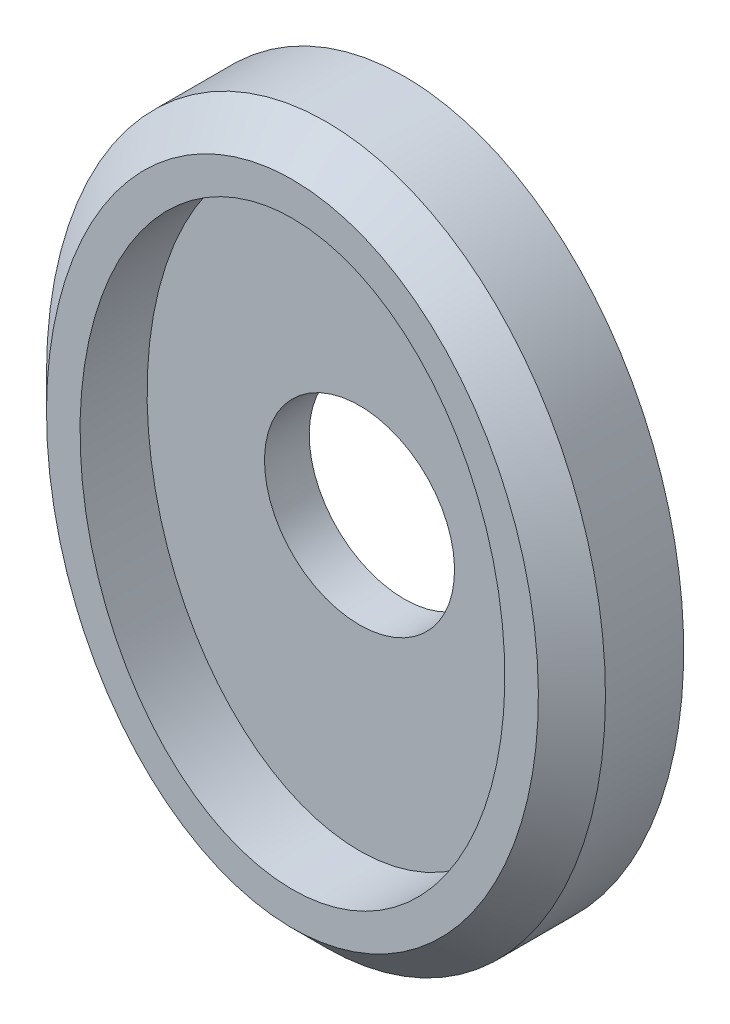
ISO-10303-21;
HEADER;
FILE_DESCRIPTION(('STEP AP214'),'2;1');
FILE_NAME('part.step','',(''),(''),'','','');
FILE_SCHEMA(('AUTOMOTIVE_DESIGN { 1 0 10303 214 1 1 1 1 }'));
ENDSEC;
DATA;
#1=APPLICATION_CONTEXT('core data for automotive mechanical design processes');
#2=APPLICATION_PROTOCOL_DEFINITION('international standard','automotive_design',2000,#1);
#3=PRODUCT_CONTEXT('',#1,'mechanical');
#4=PRODUCT('Part','Part','',(#3));
#5=PRODUCT_RELATED_PRODUCT_CATEGORY('part','',(#4));
#6=PRODUCT_DEFINITION_FORMATION('','',#4);
#7=PRODUCT_DEFINITION_CONTEXT('part definition',#1,'design');
#8=PRODUCT_DEFINITION('design','',#6,#7);
#9=PRODUCT_DEFINITION_SHAPE('','',#8);
#10=(LENGTH_UNIT() NAMED_UNIT(*) SI_UNIT(.MILLI.,.METRE.));
#11=(NAMED_UNIT(*) PLANE_ANGLE_UNIT() SI_UNIT($,.RADIAN.));
#12=(NAMED_UNIT(*) SI_UNIT($,.STERADIAN.) SOLID_ANGLE_UNIT());
#13=UNCERTAINTY_MEASURE_WITH_UNIT(LENGTH_MEASURE(1.E-05),#10,'distance_accuracy_value','');
#14=(GEOMETRIC_REPRESENTATION_CONTEXT(3) GLOBAL_UNCERTAINTY_ASSIGNED_CONTEXT((#13)) GLOBAL_UNIT_ASSIGNED_CONTEXT((#10,
#11,#12)) REPRESENTATION_CONTEXT('',''));
#15=CARTESIAN_POINT('',(0.,0.,0.));
#16=DIRECTION('',(0.,0.,1.));
#17=DIRECTION('',(1.,0.,0.));
#18=AXIS2_PLACEMENT_3D('',#15,#16,#17);
#19=CARTESIAN_POINT('',(0.,0.,5.));
#20=DIRECTION('',(0.,0.,1.));
#21=DIRECTION('',(0.,-1.,0.));
#22=AXIS2_PLACEMENT_3D('',#19,#20,#21);
#23=PLANE('',#22);
#24=CARTESIAN_POINT('',(0.,13.,5.));
#25=CARTESIAN_POINT('',(0.194448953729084,13.0000025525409,5.));
#26=CARTESIAN_POINT('',(0.388875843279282,12.9918205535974,5.));
#27=CARTESIAN_POINT('',(0.776449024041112,12.9592309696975,5.));
#28=CARTESIAN_POINT('',(0.9695947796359,12.9348169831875,5.));
#29=CARTESIAN_POINT('',(1.35539370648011,12.8697885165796,5.));
#30=CARTESIAN_POINT('',(1.54801618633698,12.8289926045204,5.));
#31=CARTESIAN_POINT('',(1.92936037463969,12.7318472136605,5.));
#32=CARTESIAN_POINT('',(2.1180806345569,12.675492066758,5.));
#33=CARTESIAN_POINT('',(2.49072794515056,12.5479968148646,5.));
#34=CARTESIAN_POINT('',(2.67464820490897,12.4768369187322,5.));
#35=CARTESIAN_POINT('',(3.03655910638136,12.3207540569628,5.));
#36=CARTESIAN_POINT('',(3.21454902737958,12.2358294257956,5.));
#37=CARTESIAN_POINT('',(3.57528102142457,12.0473161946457,5.));
#38=CARTESIAN_POINT('',(3.75757499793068,11.9428711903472,5.));
#39=CARTESIAN_POINT('',(4.1139666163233,11.7208773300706,5.));
#40=CARTESIAN_POINT('',(4.28806443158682,11.6033287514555,5.));
#41=CARTESIAN_POINT('',(4.62763634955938,11.3564065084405,5.));
#42=CARTESIAN_POINT('',(4.79311069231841,11.2270331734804,5.));
#43=CARTESIAN_POINT('',(5.1152176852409,10.9576436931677,5.));
#44=CARTESIAN_POINT('',(5.2718470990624,10.8176236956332,5.));
#45=CARTESIAN_POINT('',(5.65684537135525,10.4512381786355,5.));
#46=CARTESIAN_POINT('',(5.87916997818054,10.2184865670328,5.));
#47=CARTESIAN_POINT('',(6.30268279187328,9.73431543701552,5.));
#48=CARTESIAN_POINT('',(6.5038544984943,9.48288160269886,5.));
#49=CARTESIAN_POINT('',(6.88562128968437,8.96401983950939,5.));
#50=CARTESIAN_POINT('',(7.06616892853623,8.69655710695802,5.));
#51=CARTESIAN_POINT('',(7.40654485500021,8.14895370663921,5.));
#52=CARTESIAN_POINT('',(7.56637997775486,7.86881726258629,5.));
#53=CARTESIAN_POINT('',(7.91590041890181,7.20285586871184,5.));
#54=CARTESIAN_POINT('',(8.09778184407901,6.81292187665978,5.));
#55=CARTESIAN_POINT('',(8.42680176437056,6.01949254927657,5.));
#56=CARTESIAN_POINT('',(8.57399324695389,5.61601898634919,5.));
#57=CARTESIAN_POINT('',(8.83526812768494,4.79816137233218,5.));
#58=CARTESIAN_POINT('',(8.94932370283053,4.38376846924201,5.));
#59=CARTESIAN_POINT('',(9.14512349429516,3.54728884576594,5.));
#60=CARTESIAN_POINT('',(9.22685501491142,3.12519917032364,5.));
#61=CARTESIAN_POINT('',(9.35983095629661,2.26838305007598,5.));
#62=CARTESIAN_POINT('',(9.41049276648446,1.83356648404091,5.));
#63=CARTESIAN_POINT('',(9.47940398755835,0.961431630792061,5.));
#64=CARTESIAN_POINT('',(9.49765663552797,0.52411359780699,5.));
#65=CARTESIAN_POINT('',(9.50192308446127,-0.351179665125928,5.));
#66=CARTESIAN_POINT('',(9.48790029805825,-0.789155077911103,5.));
#67=CARTESIAN_POINT('',(9.42741733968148,-1.66286249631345,5.));
#68=CARTESIAN_POINT('',(9.38095674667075,-2.09859447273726,5.));
#69=CARTESIAN_POINT('',(9.24657021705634,-3.0247122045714,5.));
#70=CARTESIAN_POINT('',(9.15383748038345,-3.51441162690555,5.));
#71=CARTESIAN_POINT('',(8.9248328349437,-4.48373487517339,5.));
#72=CARTESIAN_POINT('',(8.78854818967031,-4.96335570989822,5.));
#73=CARTESIAN_POINT('',(8.47127161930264,-5.90664767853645,5.));
#74=CARTESIAN_POINT('',(8.29036463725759,-6.3703472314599,5.));
#75=CARTESIAN_POINT('',(7.88194223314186,-7.27662514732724,5.));
#76=CARTESIAN_POINT('',(7.65446215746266,-7.71921921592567,5.));
#77=CARTESIAN_POINT('',(7.25307012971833,-8.40215084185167,5.));
#78=CARTESIAN_POINT('',(7.09480852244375,-8.65176631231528,5.));
#79=CARTESIAN_POINT('',(6.76072167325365,-9.13898537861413,5.));
#80=CARTESIAN_POINT('',(6.58489870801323,-9.3765905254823,5.));
#81=CARTESIAN_POINT('',(6.21563994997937,-9.8372403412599,5.));
#82=CARTESIAN_POINT('',(6.02222680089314,-10.0603031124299,5.));
#83=CARTESIAN_POINT('',(5.6175210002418,-10.4895483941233,5.));
#84=CARTESIAN_POINT('',(5.40623397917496,-10.6957361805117,5.));
#85=CARTESIAN_POINT('',(5.00959768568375,-11.0493810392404,5.));
#86=CARTESIAN_POINT('',(4.82740295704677,-11.2003806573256,5.));
#87=CARTESIAN_POINT('',(4.45201934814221,-11.4878720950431,5.));
#88=CARTESIAN_POINT('',(4.25883668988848,-11.624372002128,5.));
#89=CARTESIAN_POINT('',(3.8619339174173,-11.8811460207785,5.));
#90=CARTESIAN_POINT('',(3.65821347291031,-12.0014196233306,5.));
#91=CARTESIAN_POINT('',(3.24111073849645,-12.2238587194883,5.));
#92=CARTESIAN_POINT('',(3.02773016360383,-12.3260274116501,5.));
#93=CARTESIAN_POINT('',(2.62327887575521,-12.4974144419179,5.));
#94=CARTESIAN_POINT('',(2.43331488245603,-12.5692486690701,5.));
#95=CARTESIAN_POINT('',(2.04816619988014,-12.6971676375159,5.));
#96=CARTESIAN_POINT('',(1.85298242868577,-12.7532551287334,5.));
#97=CARTESIAN_POINT('',(1.45904319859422,-12.8486735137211,5.));
#98=CARTESIAN_POINT('',(1.26029717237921,-12.8880433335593,5.));
#99=CARTESIAN_POINT('',(0.860231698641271,-12.9495202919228,5.));
#100=CARTESIAN_POINT('',(0.658913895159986,-12.9716379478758,5.));
#101=CARTESIAN_POINT('',(0.381006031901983,-12.9899595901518,5.));
#102=CARTESIAN_POINT('',(0.304858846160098,-12.9937231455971,5.));
#103=CARTESIAN_POINT('',(0.152477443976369,-12.9987438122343,5.));
#104=CARTESIAN_POINT('',(0.0762432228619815,-13.0000007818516,5.));
#105=CARTESIAN_POINT('',(-0.196931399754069,-12.999997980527,5.));
#106=CARTESIAN_POINT('',(-0.393922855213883,-12.9916047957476,5.));
#107=CARTESIAN_POINT('',(-0.786565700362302,-12.9581633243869,5.));
#108=CARTESIAN_POINT('',(-0.982216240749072,-12.9331053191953,5.));
#109=CARTESIAN_POINT('',(-1.37112898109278,-12.8666860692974,5.));
#110=CARTESIAN_POINT('',(-1.56438568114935,-12.8252926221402,5.));
#111=CARTESIAN_POINT('',(-1.94688122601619,-12.7268700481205,5.));
#112=CARTESIAN_POINT('',(-2.13611964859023,-12.6698392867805,5.));
#113=CARTESIAN_POINT('',(-2.51131858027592,-12.5403735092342,5.));
#114=CARTESIAN_POINT('',(-2.69722868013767,-12.4677927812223,5.));
#115=CARTESIAN_POINT('',(-3.06292058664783,-12.3085910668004,5.));
#116=CARTESIAN_POINT('',(-3.24270228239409,-12.2219698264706,5.));
#117=CARTESIAN_POINT('',(-3.59537904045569,-12.0358030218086,5.));
#118=CARTESIAN_POINT('',(-3.76827558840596,-11.9362602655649,5.));
#119=CARTESIAN_POINT('',(-4.10670531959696,-11.7253453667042,5.));
#120=CARTESIAN_POINT('',(-4.27223715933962,-11.613971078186,5.));
#121=CARTESIAN_POINT('',(-4.66477162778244,-11.3304954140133,5.));
#122=CARTESIAN_POINT('',(-4.88775834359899,-11.1528059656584,5.));
#123=CARTESIAN_POINT('',(-5.31728604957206,-10.7785512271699,5.));
#124=CARTESIAN_POINT('',(-5.52382148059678,-10.5819796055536,5.));
#125=CARTESIAN_POINT('',(-5.92055418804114,-10.1723381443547,5.));
#126=CARTESIAN_POINT('',(-6.11072205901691,-9.95923986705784,5.));
#127=CARTESIAN_POINT('',(-6.47431365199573,-9.51935185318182,5.));
#128=CARTESIAN_POINT('',(-6.64773688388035,-9.29256171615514,5.));
#129=CARTESIAN_POINT('',(-7.25680731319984,-8.43487310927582,5.));
#130=CARTESIAN_POINT('',(-7.64186436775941,-7.76701616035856,5.));
#131=CARTESIAN_POINT('',(-8.13483154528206,-6.7270256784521,5.));
#132=CARTESIAN_POINT('',(-8.28515882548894,-6.37362172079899,5.));
#133=CARTESIAN_POINT('',(-8.55872199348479,-5.65632325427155,5.));
#134=CARTESIAN_POINT('',(-8.68195770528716,-5.29242867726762,5.));
#135=CARTESIAN_POINT('',(-8.93001917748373,-4.46315351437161,5.));
#136=CARTESIAN_POINT('',(-9.04726937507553,-3.99551184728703,5.));
#137=CARTESIAN_POINT('',(-9.24145230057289,-3.05187775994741,5.));
#138=CARTESIAN_POINT('',(-9.31837519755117,-2.57588333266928,5.));
#139=CARTESIAN_POINT('',(-9.43272318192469,-1.61879253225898,5.));
#140=CARTESIAN_POINT('',(-9.47011514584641,-1.13769222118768,5.));
#141=CARTESIAN_POINT('',(-9.50568673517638,-0.174096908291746,5.));
#142=CARTESIAN_POINT('',(-9.50386982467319,0.30839796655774,5.));
#143=CARTESIAN_POINT('',(-9.4608613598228,1.27505935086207,5.));
#144=CARTESIAN_POINT('',(-9.4193916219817,1.75921357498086,5.));
#145=CARTESIAN_POINT('',(-9.29621255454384,2.72247720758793,5.));
#146=CARTESIAN_POINT('',(-9.21449765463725,3.20158590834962,5.));
#147=CARTESIAN_POINT('',(-9.01007273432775,4.15041896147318,5.));
#148=CARTESIAN_POINT('',(-8.88741197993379,4.62015387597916,5.));
#149=CARTESIAN_POINT('',(-8.5998310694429,5.54642537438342,5.));
#150=CARTESIAN_POINT('',(-8.43492847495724,6.00296735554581,5.));
#151=CARTESIAN_POINT('',(-8.11749161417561,6.76303690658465,5.));
#152=CARTESIAN_POINT('',(-7.97617507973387,7.07125829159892,5.));
#153=CARTESIAN_POINT('',(-7.67156720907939,7.67649678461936,5.));
#154=CARTESIAN_POINT('',(-7.50827733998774,7.97351463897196,5.));
#155=CARTESIAN_POINT('',(-6.98458547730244,8.84367853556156,5.));
#156=CARTESIAN_POINT('',(-6.58979877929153,9.39731798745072,5.));
#157=CARTESIAN_POINT('',(-5.97961318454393,10.1062705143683,5.));
#158=CARTESIAN_POINT('',(-5.80383486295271,10.2965755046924,5.));
#159=CARTESIAN_POINT('',(-5.43845552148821,10.66354842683,5.));
#160=CARTESIAN_POINT('',(-5.24885529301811,10.8402171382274,5.));
#161=CARTESIAN_POINT('',(-4.85620430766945,11.1776635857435,5.));
#162=CARTESIAN_POINT('',(-4.65316258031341,11.3384518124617,5.));
#163=CARTESIAN_POINT('',(-4.23400185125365,11.6419913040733,5.));
#164=CARTESIAN_POINT('',(-4.01788551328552,11.7847462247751,5.));
#165=CARTESIAN_POINT('',(-3.61281894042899,12.0263379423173,5.));
#166=CARTESIAN_POINT('',(-3.42583416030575,12.1284754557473,5.));
#167=CARTESIAN_POINT('',(-3.04434210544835,12.3175468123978,5.));
#168=CARTESIAN_POINT('',(-2.84983631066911,12.4044836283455,5.));
#169=CARTESIAN_POINT('',(-2.45452722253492,12.5617472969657,5.));
#170=CARTESIAN_POINT('',(-2.2537334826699,12.632098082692,5.));
#171=CARTESIAN_POINT('',(-1.84687857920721,12.7551545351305,5.));
#172=CARTESIAN_POINT('',(-1.64081937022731,12.8078666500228,5.));
#173=CARTESIAN_POINT('',(-1.19729696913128,12.9004591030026,5.));
#174=CARTESIAN_POINT('',(-0.959281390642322,12.9377242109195,5.));
#175=CARTESIAN_POINT('',(-0.480831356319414,12.9874839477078,5.));
#176=CARTESIAN_POINT('',(-0.240398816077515,12.9999968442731,5.));
#177=CARTESIAN_POINT('',(0.,13.,5.));
#178=B_SPLINE_CURVE_WITH_KNOTS('',3,(#24,#25,#26,#27,#28,#29,#30,#31,#32,#33,#34,#35,#36,#37,
#38,#39,#40,#41,#42,#43,#44,#45,#46,#47,#48,#49,#50,#51,#52,#53,#54,#55,#56,#57,#58,#59,#60,#61,
#62,#63,#64,#65,#66,#67,#68,#69,#70,#71,#72,#73,#74,#75,#76,#77,#78,#79,#80,#81,#82,#83,#84,#85,
#86,#87,#88,#89,#90,#91,#92,#93,#94,#95,#96,#97,#98,#99,#100,#101,#102,#103,#104,#105,#106,#107,
#108,#109,#110,#111,#112,#113,#114,#115,#116,#117,#118,#119,#120,#121,#122,#123,#124,#125,#126,
#127,#128,#129,#130,#131,#132,#133,#134,#135,#136,#137,#138,#139,#140,#141,#142,#143,#144,#145,
#146,#147,#148,#149,#150,#151,#152,#153,#154,#155,#156,#157,#158,#159,#160,#161,#162,#163,#164,
#165,#166,#167,#168,#169,#170,#171,#172,#173,#174,#175,#176,#177),.UNSPECIFIED.,.T.,.F.,(4,2,2,
2,2,2,2,2,2,2,2,2,2,2,2,2,2,2,2,2,2,2,2,2,2,2,2,2,2,2,2,2,2,2,2,2,2,2,2,2,2,2,2,2,2,2,2,2,2,2,2,
2,2,2,2,2,2,2,2,2,2,2,2,2,2,2,2,2,2,2,2,2,2,2,2,2,4),(0.,0.58313788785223,1.16650588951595,
1.75652127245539,2.34675187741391,2.93777663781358,3.52887296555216,4.15855020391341,
4.7882141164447,5.41786049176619,6.04773578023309,7.0119050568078,7.9768209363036,
8.94391371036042,9.91068652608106,11.1996476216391,12.4866269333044,13.7746837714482,
15.0632460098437,16.3752859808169,17.6871948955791,19.000591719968,20.3140055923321,
21.8072688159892,23.3009691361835,24.7918477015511,26.2815989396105,27.1676247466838,
28.0535358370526,28.9383222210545,29.8228309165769,30.5321008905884,31.2409731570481,
31.9498676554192,32.658636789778,33.2672789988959,33.8758148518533,34.4829258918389,
35.089666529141,35.3183549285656,35.5470562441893,36.1377772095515,36.7288429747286,
37.3210797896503,37.913378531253,38.5114912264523,39.1096147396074,39.7076084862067,
40.3057108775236,41.1598206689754,42.0142178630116,42.8701193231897,43.7260458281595,
46.0243411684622,47.1757963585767,48.327259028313,49.7717354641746,51.2165638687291,
52.662601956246,54.1085122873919,55.5646413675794,57.0209720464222,58.475556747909,
59.9295376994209,60.94586605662,61.9621265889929,63.9902082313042,64.7668851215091,
65.5435175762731,66.3196335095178,67.0955918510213,67.7341560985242,68.3725953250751,
69.0101075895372,69.6473865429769,70.3688572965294,71.0897953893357),.UNSPECIFIED.);
#179=CARTESIAN_POINT('',(0.,13.,5.));
#180=VERTEX_POINT('',#179);
#181=EDGE_CURVE('E21',#180,#180,#178,.T.);
#182=ORIENTED_EDGE('',*,*,#181,.T.);
#183=EDGE_LOOP('',(#182));
#184=FACE_BOUND('',#183,.T.);
#185=CARTESIAN_POINT('',(-0.00963685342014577,14.4999943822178,5.));
#186=CARTESIAN_POINT('',(0.226159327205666,14.5002766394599,5.));
#187=CARTESIAN_POINT('',(0.461913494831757,14.4904439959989,5.));
#188=CARTESIAN_POINT('',(0.93179612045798,14.4507498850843,5.));
#189=CARTESIAN_POINT('',(1.16592427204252,14.4208847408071,5.));
#190=CARTESIAN_POINT('',(1.63100106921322,14.3415887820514,5.));
#191=CARTESIAN_POINT('',(1.86194726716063,14.29214369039,5.));
#192=CARTESIAN_POINT('',(2.31899215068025,14.1744975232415,5.));
#193=CARTESIAN_POINT('',(2.54509095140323,14.1062968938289,5.));
#194=CARTESIAN_POINT('',(2.99241497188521,13.9517177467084,5.));
#195=CARTESIAN_POINT('',(3.21360499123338,13.8652376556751,5.));
#196=CARTESIAN_POINT('',(3.64866188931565,13.6755406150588,5.));
#197=CARTESIAN_POINT('',(3.86252885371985,13.5723238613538,5.));
#198=CARTESIAN_POINT('',(4.28210259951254,13.350410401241,5.));
#199=CARTESIAN_POINT('',(4.48780801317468,13.2317111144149,5.));
#200=CARTESIAN_POINT('',(4.89037928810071,12.9801414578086,5.));
#201=CARTESIAN_POINT('',(5.08724340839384,12.8472683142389,5.));
#202=CARTESIAN_POINT('',(5.54871960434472,12.5127439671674,5.));
#203=CARTESIAN_POINT('',(5.80884712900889,12.3048770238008,5.));
#204=CARTESIAN_POINT('',(6.30991893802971,11.8671815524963,5.));
#205=CARTESIAN_POINT('',(6.55085728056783,11.6373462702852,5.));
#206=CARTESIAN_POINT('',(7.01350229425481,11.1583673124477,5.));
#207=CARTESIAN_POINT('',(7.23517706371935,10.9091928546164,5.));
#208=CARTESIAN_POINT('',(7.6586975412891,10.3946951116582,5.));
#209=CARTESIAN_POINT('',(7.86054269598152,10.1293713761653,5.));
#210=CARTESIAN_POINT('',(8.55028971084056,9.1513587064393,5.));
#211=CARTESIAN_POINT('',(8.98259488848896,8.39828235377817,5.));
#212=CARTESIAN_POINT('',(9.53454979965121,7.22544448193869,5.));
#213=CARTESIAN_POINT('',(9.70253844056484,6.82698732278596,5.));
#214=CARTESIAN_POINT('',(10.007297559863,6.01826933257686,5.));
#215=CARTESIAN_POINT('',(10.1440701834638,5.60800931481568,5.));
#216=CARTESIAN_POINT('',(10.5125523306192,4.34939233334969,5.));
#217=CARTESIAN_POINT('',(10.6963078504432,3.48642944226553,5.));
#218=CARTESIAN_POINT('',(10.8793108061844,2.18014309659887,5.));
#219=CARTESIAN_POINT('',(10.9248730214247,1.74253804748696,5.));
#220=CARTESIAN_POINT('',(10.9853848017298,0.865074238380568,5.));
#221=CARTESIAN_POINT('',(11.000332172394,0.425215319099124,5.));
#222=CARTESIAN_POINT('',(10.9995960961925,-0.533918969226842,5.));
#223=CARTESIAN_POINT('',(10.9778949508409,-1.05319422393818,5.));
#224=CARTESIAN_POINT('',(10.8917363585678,-2.08829135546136,5.));
#225=CARTESIAN_POINT('',(10.8272711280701,-2.60411258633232,5.));
#226=CARTESIAN_POINT('',(10.6551111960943,-3.62851949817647,5.));
#227=CARTESIAN_POINT('',(10.5474162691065,-4.13710514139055,5.));
#228=CARTESIAN_POINT('',(10.2880748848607,-5.14289344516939,5.));
#229=CARTESIAN_POINT('',(10.1364405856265,-5.64009921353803,5.));
#230=CARTESIAN_POINT('',(9.82524503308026,-6.5146186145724,5.));
#231=CARTESIAN_POINT('',(9.67420025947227,-6.89497660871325,5.));
#232=CARTESIAN_POINT('',(9.34367992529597,-7.64318896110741,5.));
#233=CARTESIAN_POINT('',(9.16420528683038,-8.01104372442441,5.));
#234=CARTESIAN_POINT('',(8.77649834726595,-8.73077578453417,5.));
#235=CARTESIAN_POINT('',(8.56829914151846,-9.08267085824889,5.));
#236=CARTESIAN_POINT('',(8.12252750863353,-9.76730797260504,5.));
#237=CARTESIAN_POINT('',(7.88496449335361,-10.1000561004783,5.));
#238=CARTESIAN_POINT('',(7.43831643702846,-10.6682932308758,5.));
#239=CARTESIAN_POINT('',(7.23526609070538,-10.9085373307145,5.));
#240=CARTESIAN_POINT('',(6.81159715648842,-11.3730495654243,5.));
#241=CARTESIAN_POINT('',(6.5909796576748,-11.5973186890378,5.));
#242=CARTESIAN_POINT('',(6.13254887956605,-12.0272519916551,5.));
#243=CARTESIAN_POINT('',(5.89474767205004,-12.2329290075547,5.));
#244=CARTESIAN_POINT('',(5.40236905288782,-12.6231325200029,5.));
#245=CARTESIAN_POINT('',(5.1477948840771,-12.8076630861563,5.));
#246=CARTESIAN_POINT('',(4.66971922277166,-13.1218376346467,5.));
#247=CARTESIAN_POINT('',(4.44878764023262,-13.2553983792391,5.));
#248=CARTESIAN_POINT('',(3.99705307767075,-13.5046042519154,5.));
#249=CARTESIAN_POINT('',(3.76625201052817,-13.6202528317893,5.));
#250=CARTESIAN_POINT('',(3.29615289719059,-13.8318516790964,5.));
#251=CARTESIAN_POINT('',(3.05686694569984,-13.9278287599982,5.));
#252=CARTESIAN_POINT('',(2.57090452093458,-14.0987172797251,5.));
#253=CARTESIAN_POINT('',(2.32423002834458,-14.1736343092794,5.));
#254=CARTESIAN_POINT('',(1.90542705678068,-14.2806012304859,5.));
#255=CARTESIAN_POINT('',(1.73481897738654,-14.3186899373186,5.));
#256=CARTESIAN_POINT('',(1.39157925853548,-14.3842385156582,5.));
#257=CARTESIAN_POINT('',(1.21894785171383,-14.4116995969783,5.));
#258=CARTESIAN_POINT('',(0.872266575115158,-14.4557458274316,5.));
#259=CARTESIAN_POINT('',(0.6982164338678,-14.4723288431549,5.));
#260=CARTESIAN_POINT('',(0.349449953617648,-14.4944559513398,5.));
#261=CARTESIAN_POINT('',(0.174733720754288,-14.500001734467,5.));
#262=CARTESIAN_POINT('',(-0.235806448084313,-14.4999976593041,5.));
#263=CARTESIAN_POINT('',(-0.471644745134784,-14.4898921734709,5.));
#264=CARTESIAN_POINT('',(-0.941623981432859,-14.4496374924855,5.));
#265=CARTESIAN_POINT('',(-1.17576461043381,-14.4194847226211,5.));
#266=CARTESIAN_POINT('',(-1.64085137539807,-14.3396186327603,5.));
#267=CARTESIAN_POINT('',(-1.87179511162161,-14.2898913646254,5.));
#268=CARTESIAN_POINT('',(-2.32880902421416,-14.171681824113,5.));
#269=CARTESIAN_POINT('',(-2.55487931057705,-14.1031999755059,5.));
#270=CARTESIAN_POINT('',(-3.00212261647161,-13.9480658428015,5.));
#271=CARTESIAN_POINT('',(-3.22326042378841,-13.8613123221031,5.));
#272=CARTESIAN_POINT('',(-3.65819618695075,-13.6710823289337,5.));
#273=CARTESIAN_POINT('',(-3.87199423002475,-13.5676060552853,5.));
#274=CARTESIAN_POINT('',(-4.29141498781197,-13.3451839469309,5.));
#275=CARTESIAN_POINT('',(-4.49703630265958,-13.2262354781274,5.));
#276=CARTESIAN_POINT('',(-4.8994272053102,-12.9741815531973,5.));
#277=CARTESIAN_POINT('',(-5.0961950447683,-12.8410733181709,5.));
#278=CARTESIAN_POINT('',(-5.5576224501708,-12.5058613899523,5.));
#279=CARTESIAN_POINT('',(-5.81777978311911,-12.2975307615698,5.));
#280=CARTESIAN_POINT('',(-6.31886509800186,-11.858900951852,5.));
#281=CARTESIAN_POINT('',(-6.55978709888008,-11.6285949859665,5.));
#282=CARTESIAN_POINT('',(-7.02236142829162,-11.1486769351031,5.));
#283=CARTESIAN_POINT('',(-7.24398176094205,-10.8990340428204,5.));
#284=CARTESIAN_POINT('',(-7.66736072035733,-10.3836075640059,5.));
#285=CARTESIAN_POINT('',(-7.86911881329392,-10.1178235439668,5.));
#286=CARTESIAN_POINT('',(-8.55845387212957,-9.13820267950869,5.));
#287=CARTESIAN_POINT('',(-8.99032744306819,-8.38399175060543,5.));
#288=CARTESIAN_POINT('',(-9.54151383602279,-7.20952447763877,5.));
#289=CARTESIAN_POINT('',(-9.70922580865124,-6.81053612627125,5.));
#290=CARTESIAN_POINT('',(-10.0133817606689,-6.00077549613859,5.));
#291=CARTESIAN_POINT('',(-10.1498279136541,-5.59000403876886,5.));
#292=CARTESIAN_POINT('',(-10.5172323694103,-4.32993057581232,5.));
#293=CARTESIAN_POINT('',(-10.7001738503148,-3.46606058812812,5.));
#294=CARTESIAN_POINT('',(-10.8818193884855,-2.15850257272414,5.));
#295=CARTESIAN_POINT('',(-10.9269061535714,-1.72048747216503,5.));
#296=CARTESIAN_POINT('',(-10.9864204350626,-0.8422370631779,5.));
#297=CARTESIAN_POINT('',(-11.0008457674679,-0.402001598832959,5.));
#298=CARTESIAN_POINT('',(-10.9989182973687,0.557663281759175,5.));
#299=CARTESIAN_POINT('',(-10.9765585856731,1.0770851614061,5.));
#300=CARTESIAN_POINT('',(-10.8890447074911,2.11241772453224,5.));
#301=CARTESIAN_POINT('',(-10.8238827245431,2.6283277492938,5.));
#302=CARTESIAN_POINT('',(-10.6502979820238,3.65284337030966,5.));
#303=CARTESIAN_POINT('',(-10.5418753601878,4.16144898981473,5.));
#304=CARTESIAN_POINT('',(-10.2810332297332,5.16719917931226,5.));
#305=CARTESIAN_POINT('',(-10.1286259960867,5.66434690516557,5.));
#306=CARTESIAN_POINT('',(-9.81622034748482,6.53808079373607,5.));
#307=CARTESIAN_POINT('',(-9.66479051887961,6.91774472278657,5.));
#308=CARTESIAN_POINT('',(-9.33355894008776,7.66454432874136,5.));
#309=CARTESIAN_POINT('',(-9.15375811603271,8.03168041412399,5.));
#310=CARTESIAN_POINT('',(-8.76546023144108,8.74995209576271,5.));
#311=CARTESIAN_POINT('',(-8.55699627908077,9.10110553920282,5.));
#312=CARTESIAN_POINT('',(-8.11076173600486,9.78424092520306,5.));
#313=CARTESIAN_POINT('',(-7.87300052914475,10.1162289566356,5.));
#314=CARTESIAN_POINT('',(-7.42604007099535,10.6831403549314,5.));
#315=CARTESIAN_POINT('',(-7.22285869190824,10.9228198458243,5.));
#316=CARTESIAN_POINT('',(-6.79896266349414,11.3861865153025,5.));
#317=CARTESIAN_POINT('',(-6.57824908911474,11.6098746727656,5.));
#318=CARTESIAN_POINT('',(-6.11967812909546,12.03864920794,5.));
#319=CARTESIAN_POINT('',(-5.88183267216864,12.2437483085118,5.));
#320=CARTESIAN_POINT('',(-5.38941064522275,12.6327874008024,5.));
#321=CARTESIAN_POINT('',(-5.13483731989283,12.8167314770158,5.));
#322=CARTESIAN_POINT('',(-4.65672066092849,13.1299013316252,5.));
#323=CARTESIAN_POINT('',(-4.43573403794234,13.2630363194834,5.));
#324=CARTESIAN_POINT('',(-3.98392522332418,13.5113834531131,5.));
#325=CARTESIAN_POINT('',(-3.75310494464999,13.6265990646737,5.));
#326=CARTESIAN_POINT('',(-3.28299087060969,13.8373239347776,5.));
#327=CARTESIAN_POINT('',(-3.04370931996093,13.9328604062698,5.));
#328=CARTESIAN_POINT('',(-2.55785095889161,14.1028708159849,5.));
#329=CARTESIAN_POINT('',(-2.31127614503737,14.1773504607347,5.));
#330=CARTESIAN_POINT('',(-1.72685999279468,14.3256356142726,5.));
#331=CARTESIAN_POINT('',(-1.3866917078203,14.3904685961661,5.));
#332=CARTESIAN_POINT('',(-0.700864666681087,14.4774421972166,5.));
#333=CARTESIAN_POINT('',(-0.355205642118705,14.4995807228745,5.));
#334=CARTESIAN_POINT('',(-0.00963685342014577,14.4999943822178,5.));
#335=B_SPLINE_CURVE_WITH_KNOTS('',3,(#185,#186,#187,#188,#189,#190,#191,#192,#193,#194,#195,
#196,#197,#198,#199,#200,#201,#202,#203,#204,#205,#206,#207,#208,#209,#210,#211,#212,#213,#214,
#215,#216,#217,#218,#219,#220,#221,#222,#223,#224,#225,#226,#227,#228,#229,#230,#231,#232,#233,
#234,#235,#236,#237,#238,#239,#240,#241,#242,#243,#244,#245,#246,#247,#248,#249,#250,#251,#252,
#253,#254,#255,#256,#257,#258,#259,#260,#261,#262,#263,#264,#265,#266,#267,#268,#269,#270,#271,
#272,#273,#274,#275,#276,#277,#278,#279,#280,#281,#282,#283,#284,#285,#286,#287,#288,#289,#290,
#291,#292,#293,#294,#295,#296,#297,#298,#299,#300,#301,#302,#303,#304,#305,#306,#307,#308,#309,
#310,#311,#312,#313,#314,#315,#316,#317,#318,#319,#320,#321,#322,#323,#324,#325,#326,#327,#328,
#329,#330,#331,#332,#333,#334),.UNSPECIFIED.,.T.,.F.,(4,2,2,2,2,2,2,2,2,2,2,2,2,2,2,2,2,2,2,2,2,
2,2,2,2,2,2,2,2,2,2,2,2,2,2,2,2,2,2,2,2,2,2,2,2,2,2,2,2,2,2,2,2,2,2,2,2,2,2,2,2,2,2,2,2,2,2,2,2,
2,2,2,2,2,4),(0.,0.707081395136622,1.41429260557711,2.12202044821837,2.82973145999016,
3.54148355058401,4.25322731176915,4.96508984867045,5.67709195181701,6.67457161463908,
7.67235895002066,8.67176838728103,9.67120570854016,12.2601474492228,13.5565162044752,
14.8527958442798,17.4886521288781,18.8077859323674,20.1270142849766,21.6844309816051,
23.2421312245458,24.7998395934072,26.3571173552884,27.5838015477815,28.8104459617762,
30.0356887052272,31.260539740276,32.2034092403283,33.1462203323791,34.088375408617,
35.0303488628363,35.8041001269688,36.5777020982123,37.3502424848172,38.1225775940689,
38.6466978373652,39.1707583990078,39.6949217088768,40.2190047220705,40.9262646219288,
41.6336506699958,42.3415416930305,43.0494167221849,43.7613221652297,44.473219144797,
45.1852374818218,45.8973958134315,46.8958121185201,47.8945376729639,48.8948884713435,
49.8952661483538,52.4864995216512,53.7840143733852,55.0814389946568,57.7194333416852,
59.0396420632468,60.3599448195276,61.9178824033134,63.4761045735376,65.0343217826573,
66.5921045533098,67.8172834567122,69.0424223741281,70.266157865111,71.4895024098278,
72.4313331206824,73.3731061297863,74.3142296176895,75.2551710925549,76.0284018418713,
76.8014828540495,77.5734875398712,78.3452828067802,79.3814882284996,80.4177444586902),.UNSPECIFIED.);
#336=CARTESIAN_POINT('',(-0.00963685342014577,14.4999943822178,5.));
#337=VERTEX_POINT('',#336);
#338=EDGE_CURVE('E48',#337,#337,#335,.T.);
#339=ORIENTED_EDGE('',*,*,#338,.F.);
#340=EDGE_LOOP('',(#339));
#341=FACE_BOUND('',#340,.T.);
#342=ADVANCED_FACE('F14',(#184,#341),#23,.T.);
#343=CARTESIAN_POINT('',(0.,13.,2.));
#344=CARTESIAN_POINT('',(0.,13.,5.));
#345=CARTESIAN_POINT('',(-19.,13.,2.));
#346=CARTESIAN_POINT('',(-19.,13.,5.));
#347=CARTESIAN_POINT('',(-19.,-13.,2.));
#348=CARTESIAN_POINT('',(-19.,-13.,5.));
#349=CARTESIAN_POINT('',(0.,-13.,2.));
#350=CARTESIAN_POINT('',(0.,-13.,5.));
#351=CARTESIAN_POINT('',(19.,-13.,2.));
#352=CARTESIAN_POINT('',(19.,-13.,5.));
#353=CARTESIAN_POINT('',(19.,13.,2.));
#354=CARTESIAN_POINT('',(19.,13.,5.));
#355=CARTESIAN_POINT('',(0.,13.,2.));
#356=CARTESIAN_POINT('',(0.,13.,5.));
#357=(BOUNDED_SURFACE() B_SPLINE_SURFACE(3,1,((#343,#344),(#345,#346),(#347,#348),(#349,#350),
(#351,#352),(#353,#354),(#355,#356)),.UNSPECIFIED.,.T.,.F.,.F.) B_SPLINE_SURFACE_WITH_KNOTS((4,
3,4),(2,2),(0.,0.5,1.),(0.,1.),
.UNSPECIFIED.) GEOMETRIC_REPRESENTATION_ITEM() RATIONAL_B_SPLINE_SURFACE(((1.,1.),
(0.333333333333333,0.333333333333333),(0.333333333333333,0.333333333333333),(1.,1.),
(0.333333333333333,0.333333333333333),(0.333333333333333,0.333333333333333),(1.,1.))) REPRESENTATION_ITEM('') SURFACE());
#358=CARTESIAN_POINT('',(0.,-13.,2.));
#359=CARTESIAN_POINT('',(0.194448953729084,-13.0000025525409,2.));
#360=CARTESIAN_POINT('',(0.388875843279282,-12.9918205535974,2.));
#361=CARTESIAN_POINT('',(0.776449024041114,-12.9592309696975,2.));
#362=CARTESIAN_POINT('',(0.969594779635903,-12.9348169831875,2.));
#363=CARTESIAN_POINT('',(1.35539370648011,-12.8697885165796,2.));
#364=CARTESIAN_POINT('',(1.54801618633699,-12.8289926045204,2.));
#365=CARTESIAN_POINT('',(1.9293603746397,-12.7318472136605,2.));
#366=CARTESIAN_POINT('',(2.11808063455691,-12.675492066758,2.));
#367=CARTESIAN_POINT('',(2.49072794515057,-12.5479968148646,2.));
#368=CARTESIAN_POINT('',(2.67464820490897,-12.4768369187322,2.));
#369=CARTESIAN_POINT('',(3.03655910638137,-12.3207540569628,2.));
#370=CARTESIAN_POINT('',(3.21454902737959,-12.2358294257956,2.));
#371=CARTESIAN_POINT('',(3.57528102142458,-12.0473161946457,2.));
#372=CARTESIAN_POINT('',(3.75757499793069,-11.9428711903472,2.));
#373=CARTESIAN_POINT('',(4.11396661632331,-11.7208773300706,2.));
#374=CARTESIAN_POINT('',(4.28806443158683,-11.6033287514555,2.));
#375=CARTESIAN_POINT('',(4.62763634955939,-11.3564065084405,2.));
#376=CARTESIAN_POINT('',(4.79311069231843,-11.2270331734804,2.));
#377=CARTESIAN_POINT('',(5.11521768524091,-10.9576436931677,2.));
#378=CARTESIAN_POINT('',(5.27184709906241,-10.8176236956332,2.));
#379=CARTESIAN_POINT('',(5.65684537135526,-10.4512381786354,2.));
#380=CARTESIAN_POINT('',(5.87916997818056,-10.2184865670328,2.));
#381=CARTESIAN_POINT('',(6.3026827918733,-9.7343154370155,2.));
#382=CARTESIAN_POINT('',(6.50385449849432,-9.48288160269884,2.));
#383=CARTESIAN_POINT('',(6.88562128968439,-8.96401983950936,2.));
#384=CARTESIAN_POINT('',(7.06616892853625,-8.69655710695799,2.));
#385=CARTESIAN_POINT('',(7.40654485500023,-8.14895370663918,2.));
#386=CARTESIAN_POINT('',(7.56637997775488,-7.86881726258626,2.));
#387=CARTESIAN_POINT('',(7.91590041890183,-7.20285586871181,2.));
#388=CARTESIAN_POINT('',(8.09778184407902,-6.81292187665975,2.));
#389=CARTESIAN_POINT('',(8.42680176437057,-6.01949254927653,2.));
#390=CARTESIAN_POINT('',(8.5739932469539,-5.61601898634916,2.));
#391=CARTESIAN_POINT('',(8.83526812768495,-4.79816137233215,2.));
#392=CARTESIAN_POINT('',(8.94932370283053,-4.38376846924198,2.));
#393=CARTESIAN_POINT('',(9.14512349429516,-3.54728884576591,2.));
#394=CARTESIAN_POINT('',(9.22685501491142,-3.12519917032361,2.));
#395=CARTESIAN_POINT('',(9.35983095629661,-2.26838305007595,2.));
#396=CARTESIAN_POINT('',(9.41049276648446,-1.83356648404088,2.));
#397=CARTESIAN_POINT('',(9.47940398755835,-0.961431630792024,2.));
#398=CARTESIAN_POINT('',(9.49765663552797,-0.524113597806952,2.));
#399=CARTESIAN_POINT('',(9.50192308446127,0.351179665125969,2.));
#400=CARTESIAN_POINT('',(9.48790029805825,0.789155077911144,2.));
#401=CARTESIAN_POINT('',(9.42741733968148,1.66286249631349,2.));
#402=CARTESIAN_POINT('',(9.38095674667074,2.0985944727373,2.));
#403=CARTESIAN_POINT('',(9.24657021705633,3.02471220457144,2.));
#404=CARTESIAN_POINT('',(9.15383748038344,3.5144116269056,2.));
#405=CARTESIAN_POINT('',(8.92483283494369,4.48373487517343,2.));
#406=CARTESIAN_POINT('',(8.7885481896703,4.96335570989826,2.));
#407=CARTESIAN_POINT('',(8.47127161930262,5.90664767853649,2.));
#408=CARTESIAN_POINT('',(8.29036463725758,6.37034723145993,2.));
#409=CARTESIAN_POINT('',(7.88194223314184,7.27662514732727,2.));
#410=CARTESIAN_POINT('',(7.65446215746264,7.7192192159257,2.));
#411=CARTESIAN_POINT('',(7.25307012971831,8.4021508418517,2.));
#412=CARTESIAN_POINT('',(7.09480852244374,8.65176631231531,2.));
#413=CARTESIAN_POINT('',(6.76072167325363,9.13898537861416,2.));
#414=CARTESIAN_POINT('',(6.58489870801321,9.37659052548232,2.));
#415=CARTESIAN_POINT('',(6.21563994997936,9.83724034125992,2.));
#416=CARTESIAN_POINT('',(6.02222680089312,10.0603031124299,2.));
#417=CARTESIAN_POINT('',(5.61752100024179,10.4895483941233,2.));
#418=CARTESIAN_POINT('',(5.40623397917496,10.6957361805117,2.));
#419=CARTESIAN_POINT('',(5.00959768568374,11.0493810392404,2.));
#420=CARTESIAN_POINT('',(4.82740295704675,11.2003806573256,2.));
#421=CARTESIAN_POINT('',(4.45201934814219,11.4878720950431,2.));
#422=CARTESIAN_POINT('',(4.25883668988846,11.624372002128,2.));
#423=CARTESIAN_POINT('',(3.86193391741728,11.8811460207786,2.));
#424=CARTESIAN_POINT('',(3.65821347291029,12.0014196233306,2.));
#425=CARTESIAN_POINT('',(3.24111073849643,12.2238587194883,2.));
#426=CARTESIAN_POINT('',(3.02773016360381,12.3260274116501,2.));
#427=CARTESIAN_POINT('',(2.6232788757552,12.4974144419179,2.));
#428=CARTESIAN_POINT('',(2.43331488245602,12.5692486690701,2.));
#429=CARTESIAN_POINT('',(2.04816619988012,12.6971676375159,2.));
#430=CARTESIAN_POINT('',(1.85298242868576,12.7532551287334,2.));
#431=CARTESIAN_POINT('',(1.45904319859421,12.8486735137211,2.));
#432=CARTESIAN_POINT('',(1.2602971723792,12.8880433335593,2.));
#433=CARTESIAN_POINT('',(0.860231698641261,12.9495202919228,2.));
#434=CARTESIAN_POINT('',(0.658913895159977,12.9716379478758,2.));
#435=CARTESIAN_POINT('',(0.381006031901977,12.9899595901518,2.));
#436=CARTESIAN_POINT('',(0.304858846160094,12.9937231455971,2.));
#437=CARTESIAN_POINT('',(0.152477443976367,12.9987438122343,2.));
#438=CARTESIAN_POINT('',(0.0762432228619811,13.0000007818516,2.));
#439=CARTESIAN_POINT('',(-0.196931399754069,12.999997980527,2.));
#440=CARTESIAN_POINT('',(-0.393922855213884,12.9916047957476,2.));
#441=CARTESIAN_POINT('',(-0.786565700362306,12.9581633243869,2.));
#442=CARTESIAN_POINT('',(-0.982216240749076,12.9331053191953,2.));
#443=CARTESIAN_POINT('',(-1.37112898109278,12.8666860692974,2.));
#444=CARTESIAN_POINT('',(-1.56438568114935,12.8252926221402,2.));
#445=CARTESIAN_POINT('',(-1.94688122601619,12.7268700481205,2.));
#446=CARTESIAN_POINT('',(-2.13611964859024,12.6698392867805,2.));
#447=CARTESIAN_POINT('',(-2.51131858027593,12.5403735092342,2.));
#448=CARTESIAN_POINT('',(-2.69722868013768,12.4677927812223,2.));
#449=CARTESIAN_POINT('',(-3.06292058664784,12.3085910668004,2.));
#450=CARTESIAN_POINT('',(-3.24270228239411,12.2219698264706,2.));
#451=CARTESIAN_POINT('',(-3.5953790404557,12.0358030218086,2.));
#452=CARTESIAN_POINT('',(-3.76827558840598,11.9362602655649,2.));
#453=CARTESIAN_POINT('',(-4.10670531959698,11.7253453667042,2.));
#454=CARTESIAN_POINT('',(-4.27223715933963,11.613971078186,2.));
#455=CARTESIAN_POINT('',(-4.66477162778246,11.3304954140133,2.));
#456=CARTESIAN_POINT('',(-4.88775834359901,11.1528059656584,2.));
#457=CARTESIAN_POINT('',(-5.31728604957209,10.7785512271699,2.));
#458=CARTESIAN_POINT('',(-5.5238214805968,10.5819796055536,2.));
#459=CARTESIAN_POINT('',(-5.92055418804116,10.1723381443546,2.));
#460=CARTESIAN_POINT('',(-6.11072205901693,9.95923986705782,2.));
#461=CARTESIAN_POINT('',(-6.47431365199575,9.5193518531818,2.));
#462=CARTESIAN_POINT('',(-6.64773688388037,9.29256171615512,2.));
#463=CARTESIAN_POINT('',(-7.25680731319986,8.43487310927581,2.));
#464=CARTESIAN_POINT('',(-7.64186436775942,7.76701616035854,2.));
#465=CARTESIAN_POINT('',(-8.13483154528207,6.72702567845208,2.));
#466=CARTESIAN_POINT('',(-8.28515882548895,6.37362172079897,2.));
#467=CARTESIAN_POINT('',(-8.55872199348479,5.65632325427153,2.));
#468=CARTESIAN_POINT('',(-8.68195770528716,5.2924286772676,2.));
#469=CARTESIAN_POINT('',(-8.93001917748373,4.46315351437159,2.));
#470=CARTESIAN_POINT('',(-9.04726937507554,3.99551184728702,2.));
#471=CARTESIAN_POINT('',(-9.24145230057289,3.05187775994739,2.));
#472=CARTESIAN_POINT('',(-9.31837519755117,2.57588333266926,2.));
#473=CARTESIAN_POINT('',(-9.43272318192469,1.61879253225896,2.));
#474=CARTESIAN_POINT('',(-9.47011514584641,1.13769222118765,2.));
#475=CARTESIAN_POINT('',(-9.50568673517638,0.174096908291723,2.));
#476=CARTESIAN_POINT('',(-9.50386982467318,-0.308397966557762,2.));
#477=CARTESIAN_POINT('',(-9.4608613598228,-1.2750593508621,2.));
#478=CARTESIAN_POINT('',(-9.4193916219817,-1.75921357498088,2.));
#479=CARTESIAN_POINT('',(-9.29621255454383,-2.72247720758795,2.));
#480=CARTESIAN_POINT('',(-9.21449765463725,-3.20158590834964,2.));
#481=CARTESIAN_POINT('',(-9.01007273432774,-4.1504189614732,2.));
#482=CARTESIAN_POINT('',(-8.88741197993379,-4.62015387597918,2.));
#483=CARTESIAN_POINT('',(-8.59983106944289,-5.54642537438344,2.));
#484=CARTESIAN_POINT('',(-8.43492847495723,-6.00296735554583,2.));
#485=CARTESIAN_POINT('',(-8.1174916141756,-6.76303690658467,2.));
#486=CARTESIAN_POINT('',(-7.97617507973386,-7.07125829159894,2.));
#487=CARTESIAN_POINT('',(-7.67156720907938,-7.67649678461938,2.));
#488=CARTESIAN_POINT('',(-7.50827733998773,-7.97351463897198,2.));
#489=CARTESIAN_POINT('',(-6.98458547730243,-8.84367853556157,2.));
#490=CARTESIAN_POINT('',(-6.5897987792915,-9.39731798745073,2.));
#491=CARTESIAN_POINT('',(-5.97961318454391,-10.1062705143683,2.));
#492=CARTESIAN_POINT('',(-5.8038348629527,-10.2965755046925,2.));
#493=CARTESIAN_POINT('',(-5.4384555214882,-10.66354842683,2.));
#494=CARTESIAN_POINT('',(-5.2488552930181,-10.8402171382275,2.));
#495=CARTESIAN_POINT('',(-4.85620430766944,-11.1776635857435,2.));
#496=CARTESIAN_POINT('',(-4.6531625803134,-11.3384518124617,2.));
#497=CARTESIAN_POINT('',(-4.23400185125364,-11.6419913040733,2.));
#498=CARTESIAN_POINT('',(-4.01788551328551,-11.7847462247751,2.));
#499=CARTESIAN_POINT('',(-3.61281894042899,-12.0263379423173,2.));
#500=CARTESIAN_POINT('',(-3.42583416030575,-12.1284754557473,2.));
#501=CARTESIAN_POINT('',(-3.04434210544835,-12.3175468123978,2.));
#502=CARTESIAN_POINT('',(-2.8498363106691,-12.4044836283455,2.));
#503=CARTESIAN_POINT('',(-2.45452722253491,-12.5617472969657,2.));
#504=CARTESIAN_POINT('',(-2.25373348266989,-12.632098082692,2.));
#505=CARTESIAN_POINT('',(-1.8468785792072,-12.7551545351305,2.));
#506=CARTESIAN_POINT('',(-1.64081937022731,-12.8078666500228,2.));
#507=CARTESIAN_POINT('',(-1.19729696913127,-12.9004591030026,2.));
#508=CARTESIAN_POINT('',(-0.959281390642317,-12.9377242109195,2.));
#509=CARTESIAN_POINT('',(-0.480831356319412,-12.9874839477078,2.));
#510=CARTESIAN_POINT('',(-0.240398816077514,-12.9999968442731,2.));
#511=CARTESIAN_POINT('',(0.,-13.,2.));
#512=B_SPLINE_CURVE_WITH_KNOTS('',3,(#358,#359,#360,#361,#362,#363,#364,#365,#366,#367,#368,
#369,#370,#371,#372,#373,#374,#375,#376,#377,#378,#379,#380,#381,#382,#383,#384,#385,#386,#387,
#388,#389,#390,#391,#392,#393,#394,#395,#396,#397,#398,#399,#400,#401,#402,#403,#404,#405,#406,
#407,#408,#409,#410,#411,#412,#413,#414,#415,#416,#417,#418,#419,#420,#421,#422,#423,#424,#425,
#426,#427,#428,#429,#430,#431,#432,#433,#434,#435,#436,#437,#438,#439,#440,#441,#442,#443,#444,
#445,#446,#447,#448,#449,#450,#451,#452,#453,#454,#455,#456,#457,#458,#459,#460,#461,#462,#463,
#464,#465,#466,#467,#468,#469,#470,#471,#472,#473,#474,#475,#476,#477,#478,#479,#480,#481,#482,
#483,#484,#485,#486,#487,#488,#489,#490,#491,#492,#493,#494,#495,#496,#497,#498,#499,#500,#501,
#502,#503,#504,#505,#506,#507,#508,#509,#510,#511),.UNSPECIFIED.,.T.,.F.,(4,2,2,2,2,2,2,2,2,2,2,
2,2,2,2,2,2,2,2,2,2,2,2,2,2,2,2,2,2,2,2,2,2,2,2,2,2,2,2,2,2,2,2,2,2,2,2,2,2,2,2,2,2,2,2,2,2,2,2,
2,2,2,2,2,2,2,2,2,2,2,2,2,2,2,2,2,4),(0.,0.583137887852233,1.16650588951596,1.7565212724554,
2.34675187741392,2.93777663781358,3.52887296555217,4.15855020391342,4.78821411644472,
5.41786049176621,6.04773578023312,7.01190505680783,7.97682093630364,8.94391371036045,
9.91068652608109,11.1996476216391,12.4866269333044,13.7746837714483,15.0632460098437,
16.3752859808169,17.6871948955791,19.000591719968,20.3140055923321,21.8072688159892,
23.3009691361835,24.7918477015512,26.2815989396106,27.1676247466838,28.0535358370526,
28.9383222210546,29.8228309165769,30.5321008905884,31.2409731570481,31.9498676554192,
32.658636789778,33.2672789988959,33.8758148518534,34.4829258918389,35.089666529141,
35.3183549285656,35.5470562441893,36.1377772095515,36.7288429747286,37.3210797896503,
37.913378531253,38.5114912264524,39.1096147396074,39.7076084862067,40.3057108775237,
41.1598206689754,42.0142178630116,42.8701193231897,43.7260458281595,46.0243411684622,
47.1757963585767,48.327259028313,49.7717354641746,51.2165638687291,52.662601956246,
54.1085122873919,55.5646413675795,57.0209720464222,58.475556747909,59.929537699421,
60.9458660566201,61.9621265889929,63.9902082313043,64.7668851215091,65.5435175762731,
66.3196335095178,67.0955918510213,67.7341560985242,68.3725953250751,69.0101075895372,
69.6473865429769,70.3688572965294,71.0897953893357),.UNSPECIFIED.);
#513=CARTESIAN_POINT('',(0.,13.,2.));
#514=VERTEX_POINT('',#513);
#515=EDGE_CURVE('E45',#514,#514,#512,.T.);
#516=CARTESIAN_POINT('',(0.,13.,2.));
#517=CARTESIAN_POINT('',(0.,13.,2.03125));
#518=CARTESIAN_POINT('',(0.,13.,2.0625));
#519=CARTESIAN_POINT('',(0.,13.,2.125));
#520=CARTESIAN_POINT('',(0.,13.,2.15625));
#521=CARTESIAN_POINT('',(0.,13.,2.21875));
#522=CARTESIAN_POINT('',(0.,13.,2.25));
#523=CARTESIAN_POINT('',(0.,13.,2.3125));
#524=CARTESIAN_POINT('',(0.,13.,2.34375));
#525=CARTESIAN_POINT('',(0.,13.,2.40625));
#526=CARTESIAN_POINT('',(0.,13.,2.4375));
#527=CARTESIAN_POINT('',(0.,13.,2.5));
#528=CARTESIAN_POINT('',(0.,13.,2.53125));
#529=CARTESIAN_POINT('',(0.,13.,2.59375));
#530=CARTESIAN_POINT('',(0.,13.,2.625));
#531=CARTESIAN_POINT('',(0.,13.,2.6875));
#532=CARTESIAN_POINT('',(0.,13.,2.71875));
#533=CARTESIAN_POINT('',(0.,13.,2.78125));
#534=CARTESIAN_POINT('',(0.,13.,2.8125));
#535=CARTESIAN_POINT('',(0.,13.,2.875));
#536=CARTESIAN_POINT('',(0.,13.,2.90625));
#537=CARTESIAN_POINT('',(0.,13.,2.96875));
#538=CARTESIAN_POINT('',(0.,13.,3.));
#539=CARTESIAN_POINT('',(0.,13.,3.0625));
#540=CARTESIAN_POINT('',(0.,13.,3.09375));
#541=CARTESIAN_POINT('',(0.,13.,3.15625));
#542=CARTESIAN_POINT('',(0.,13.,3.1875));
#543=CARTESIAN_POINT('',(0.,13.,3.25));
#544=CARTESIAN_POINT('',(0.,13.,3.28125));
#545=CARTESIAN_POINT('',(0.,13.,3.34375));
#546=CARTESIAN_POINT('',(0.,13.,3.375));
#547=CARTESIAN_POINT('',(0.,13.,3.4375));
#548=CARTESIAN_POINT('',(0.,13.,3.46875));
#549=CARTESIAN_POINT('',(0.,13.,3.53125));
#550=CARTESIAN_POINT('',(0.,13.,3.5625));
#551=CARTESIAN_POINT('',(0.,13.,3.625));
#552=CARTESIAN_POINT('',(0.,13.,3.65625));
#553=CARTESIAN_POINT('',(0.,13.,3.71875));
#554=CARTESIAN_POINT('',(0.,13.,3.75));
#555=CARTESIAN_POINT('',(0.,13.,3.8125));
#556=CARTESIAN_POINT('',(0.,13.,3.84375));
#557=CARTESIAN_POINT('',(0.,13.,3.90625));
#558=CARTESIAN_POINT('',(0.,13.,3.9375));
#559=CARTESIAN_POINT('',(0.,13.,4.));
#560=CARTESIAN_POINT('',(0.,13.,4.03125));
#561=CARTESIAN_POINT('',(0.,13.,4.09375));
#562=CARTESIAN_POINT('',(0.,13.,4.125));
#563=CARTESIAN_POINT('',(0.,13.,4.1875));
#564=CARTESIAN_POINT('',(0.,13.,4.21875));
#565=CARTESIAN_POINT('',(0.,13.,4.28125));
#566=CARTESIAN_POINT('',(0.,13.,4.3125));
#567=CARTESIAN_POINT('',(0.,13.,4.375));
#568=CARTESIAN_POINT('',(0.,13.,4.40625));
#569=CARTESIAN_POINT('',(0.,13.,4.46875));
#570=CARTESIAN_POINT('',(0.,13.,4.5));
#571=CARTESIAN_POINT('',(0.,13.,4.5625));
#572=CARTESIAN_POINT('',(0.,13.,4.59375));
#573=CARTESIAN_POINT('',(0.,13.,4.65625));
#574=CARTESIAN_POINT('',(0.,13.,4.6875));
#575=CARTESIAN_POINT('',(0.,13.,4.75));
#576=CARTESIAN_POINT('',(0.,13.,4.78125));
#577=CARTESIAN_POINT('',(0.,13.,4.84375));
#578=CARTESIAN_POINT('',(0.,13.,4.875));
#579=CARTESIAN_POINT('',(0.,13.,4.9375));
#580=CARTESIAN_POINT('',(0.,13.,4.96875));
#581=CARTESIAN_POINT('',(0.,13.,5.));
#582=B_SPLINE_CURVE_WITH_KNOTS('',3,(#516,#517,#518,#519,#520,#521,#522,#523,#524,#525,#526,
#527,#528,#529,#530,#531,#532,#533,#534,#535,#536,#537,#538,#539,#540,#541,#542,#543,#544,#545,
#546,#547,#548,#549,#550,#551,#552,#553,#554,#555,#556,#557,#558,#559,#560,#561,#562,#563,#564,
#565,#566,#567,#568,#569,#570,#571,#572,#573,#574,#575,#576,#577,#578,#579,#580,#581),
.UNSPECIFIED.,.F.,.F.,(4,2,2,2,2,2,2,2,2,2,2,2,2,2,2,2,2,2,2,2,2,2,2,2,2,2,2,2,2,2,2,2,4),(0.,
0.0937500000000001,0.1875,0.28125,0.375,0.46875,0.5625,0.65625,0.75,0.84375,0.9375,1.03125,
1.125,1.21875,1.3125,1.40625,1.5,1.59375,1.6875,1.78125,1.875,1.96875,2.0625,2.15625,2.25,
2.34375,2.4375,2.53125,2.625,2.71875,2.8125,2.90625,3.),.UNSPECIFIED.);
#583=EDGE_CURVE('BSEAM70',#514,#180,#582,.T.);
#584=ORIENTED_EDGE('',*,*,#515,.F.);
#585=ORIENTED_EDGE('',*,*,#181,.F.);
#586=ORIENTED_EDGE('',*,*,#583,.T.);
#587=ORIENTED_EDGE('',*,*,#583,.F.);
#588=EDGE_LOOP('',(#584,#586,#585,#587));
#589=FACE_BOUND('',#588,.T.);
#590=ADVANCED_FACE('F70',(#589),#357,.F.);
#591=CARTESIAN_POINT('',(0.,-14.5,5.));
#592=CARTESIAN_POINT('',(0.208645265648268,-14.5000000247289,5.));
#593=CARTESIAN_POINT('',(0.416983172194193,-14.4921060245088,5.));
#594=CARTESIAN_POINT('',(0.833046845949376,-14.4605962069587,5.));
#595=CARTESIAN_POINT('',(1.04076635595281,-14.4369818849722,5.));
#596=CARTESIAN_POINT('',(1.45561513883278,-14.3739451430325,5.));
#597=CARTESIAN_POINT('',(1.66268703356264,-14.334536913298,5.));
#598=CARTESIAN_POINT('',(2.07639057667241,-14.2396423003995,5.));
#599=CARTESIAN_POINT('',(2.28019315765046,-14.1848043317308,5.));
#600=CARTESIAN_POINT('',(2.68198379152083,-14.0611434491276,5.));
#601=CARTESIAN_POINT('',(2.87997813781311,-13.9923170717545,5.));
#602=CARTESIAN_POINT('',(3.27041345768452,-13.8412718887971,5.));
#603=CARTESIAN_POINT('',(3.46285383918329,-13.7590516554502,5.));
#604=CARTESIAN_POINT('',(3.84236326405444,-13.5816577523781,5.));
#605=CARTESIAN_POINT('',(4.0294690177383,-13.4864595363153,5.));
#606=CARTESIAN_POINT('',(4.30608218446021,-13.3342454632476,5.));
#607=CARTESIAN_POINT('',(4.39769393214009,-13.2818844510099,5.));
#608=CARTESIAN_POINT('',(4.57947346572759,-13.1741160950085,5.));
#609=CARTESIAN_POINT('',(4.66991503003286,-13.1185315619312,5.));
#610=CARTESIAN_POINT('',(4.84842432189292,-13.0049391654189,5.));
#611=CARTESIAN_POINT('',(4.93657428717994,-12.9468935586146,5.));
#612=CARTESIAN_POINT('',(5.11073923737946,-12.8283819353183,5.));
#613=CARTESIAN_POINT('',(5.19675423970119,-12.7679169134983,5.));
#614=CARTESIAN_POINT('',(5.45169719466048,-12.583007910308,5.));
#615=CARTESIAN_POINT('',(5.61752453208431,-12.4550516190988,5.));
#616=CARTESIAN_POINT('',(6.10327951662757,-12.0578986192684,5.));
#617=CARTESIAN_POINT('',(6.41156513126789,-11.7753686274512,5.));
#618=CARTESIAN_POINT('',(6.85222773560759,-11.3273541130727,5.));
#619=CARTESIAN_POINT('',(6.99560519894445,-11.1738049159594,5.));
#620=CARTESIAN_POINT('',(7.20524723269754,-10.9377141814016,5.));
#621=CARTESIAN_POINT('',(7.27428230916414,-10.8579803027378,5.));
#622=CARTESIAN_POINT('',(7.41059637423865,-10.6965712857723,5.));
#623=CARTESIAN_POINT('',(7.47788397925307,-10.6148768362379,5.));
#624=CARTESIAN_POINT('',(7.67615003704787,-10.3681527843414,5.));
#625=CARTESIAN_POINT('',(7.80388102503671,-10.2011116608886,5.));
#626=CARTESIAN_POINT('',(8.05094929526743,-9.86216625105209,5.));
#627=CARTESIAN_POINT('',(8.17028438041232,-9.69026649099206,5.));
#628=CARTESIAN_POINT('',(8.51629606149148,-9.16763491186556,5.));
#629=CARTESIAN_POINT('',(8.7310006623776,-8.8099832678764,5.));
#630=CARTESIAN_POINT('',(9.03078791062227,-8.26063391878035,5.));
#631=CARTESIAN_POINT('',(9.12699563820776,-8.07536652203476,5.));
#632=CARTESIAN_POINT('',(9.31215515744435,-7.70063778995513,5.));
#633=CARTESIAN_POINT('',(9.40110650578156,-7.51117619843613,5.));
#634=CARTESIAN_POINT('',(9.57188546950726,-7.12813549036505,5.));
#635=CARTESIAN_POINT('',(9.65370684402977,-6.93456634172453,5.));
#636=CARTESIAN_POINT('',(9.7711775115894,-6.64113080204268,5.));
#637=CARTESIAN_POINT('',(9.80948568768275,-6.54271908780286,5.));
#638=CARTESIAN_POINT('',(9.88409187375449,-6.34557082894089,5.));
#639=CARTESIAN_POINT('',(9.92041007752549,-6.24680008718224,5.));
#640=CARTESIAN_POINT('',(10.0971015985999,-5.75203321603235,5.));
#641=CARTESIAN_POINT('',(10.2230067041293,-5.35317761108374,5.));
#642=CARTESIAN_POINT('',(10.4457918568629,-4.54984229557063,5.));
#643=CARTESIAN_POINT('',(10.5426803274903,-4.14534831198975,5.));
#644=CARTESIAN_POINT('',(10.7086118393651,-3.33093427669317,5.));
#645=CARTESIAN_POINT('',(10.7776495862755,-2.92101319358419,5.));
#646=CARTESIAN_POINT('',(10.8606758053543,-2.30213093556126,5.));
#647=CARTESIAN_POINT('',(10.884924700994,-2.09516914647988,5.));
#648=CARTESIAN_POINT('',(10.9265710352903,-1.67991046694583,5.));
#649=CARTESIAN_POINT('',(10.9439685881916,-1.47161359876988,5.));
#650=CARTESIAN_POINT('',(10.9718762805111,-1.05367775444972,5.));
#651=CARTESIAN_POINT('',(10.9823848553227,-0.84404609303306,5.));
#652=CARTESIAN_POINT('',(10.9929306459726,-0.52855912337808,5.));
#653=CARTESIAN_POINT('',(10.9955746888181,-0.423145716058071,5.));
#654=CARTESIAN_POINT('',(10.9991015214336,-0.21256982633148,5.));
#655=CARTESIAN_POINT('',(10.9999894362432,-0.107386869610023,5.));
#656=CARTESIAN_POINT('',(11.0000415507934,0.417986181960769,5.));
#657=CARTESIAN_POINT('',(10.9861667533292,0.836635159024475,5.));
#658=CARTESIAN_POINT('',(10.9308783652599,1.67061676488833,5.));
#659=CARTESIAN_POINT('',(10.8894743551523,2.08595931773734,5.));
#660=CARTESIAN_POINT('',(10.7788799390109,2.91331596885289,5.));
#661=CARTESIAN_POINT('',(10.7096880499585,3.32535022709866,5.));
#662=CARTESIAN_POINT('',(10.5843934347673,3.94076436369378,5.));
#663=CARTESIAN_POINT('',(10.5390241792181,4.14551923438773,5.));
#664=CARTESIAN_POINT('',(10.4409536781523,4.55401737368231,5.));
#665=CARTESIAN_POINT('',(10.3881635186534,4.75808037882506,5.));
#666=CARTESIAN_POINT('',(10.2752765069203,5.16424061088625,5.));
#667=CARTESIAN_POINT('',(10.2154029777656,5.3655849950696,5.));
#668=CARTESIAN_POINT('',(10.0886182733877,5.76529175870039,5.));
#669=CARTESIAN_POINT('',(10.0217311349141,5.96357005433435,5.));
#670=CARTESIAN_POINT('',(9.8104703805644,6.55362786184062,5.));
#671=CARTESIAN_POINT('',(9.65552320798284,6.9406419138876,5.));
#672=CARTESIAN_POINT('',(9.31624031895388,7.70142471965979,5.));
#673=CARTESIAN_POINT('',(9.13191705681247,8.07519908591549,5.));
#674=CARTESIAN_POINT('',(8.83185325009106,8.62523371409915,5.));
#675=CARTESIAN_POINT('',(8.72789720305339,8.80680520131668,5.));
#676=CARTESIAN_POINT('',(8.51174597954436,9.16623483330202,5.));
#677=CARTESIAN_POINT('',(8.39958793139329,9.34403689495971,5.));
#678=CARTESIAN_POINT('',(8.22472616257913,9.6079727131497,5.));
#679=CARTESIAN_POINT('',(8.16533699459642,9.695472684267,5.));
#680=CARTESIAN_POINT('',(8.04493214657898,9.86860100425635,5.));
#681=CARTESIAN_POINT('',(7.98381241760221,9.95438875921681,5.));
#682=CARTESIAN_POINT('',(7.79786763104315,10.2091055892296,5.));
#683=CARTESIAN_POINT('',(7.67028435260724,10.3756553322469,5.));
#684=CARTESIAN_POINT('',(7.27667857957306,10.86484047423,5.));
#685=CARTESIAN_POINT('',(6.9996254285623,11.1773801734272,5.));
#686=CARTESIAN_POINT('',(6.56045843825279,11.624049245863,5.));
#687=CARTESIAN_POINT('',(6.41012664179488,11.7692522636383,5.));
#688=CARTESIAN_POINT('',(6.10115722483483,12.0518920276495,5.));
#689=CARTESIAN_POINT('',(5.94246148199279,12.1893741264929,5.));
#690=CARTESIAN_POINT('',(5.69797849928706,12.3892771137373,5.));
#691=CARTESIAN_POINT('',(5.61533135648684,12.4549121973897,5.));
#692=CARTESIAN_POINT('',(5.44776307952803,12.5840404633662,5.));
#693=CARTESIAN_POINT('',(5.3628617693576,12.6475079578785,5.));
#694=CARTESIAN_POINT('',(5.10621538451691,12.8334429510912,5.));
#695=CARTESIAN_POINT('',(4.93206930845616,12.9518405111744,5.));
#696=CARTESIAN_POINT('',(4.57750768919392,13.1772027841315,5.));
#697=CARTESIAN_POINT('',(4.39709484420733,13.2841724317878,5.));
#698=CARTESIAN_POINT('',(4.02978037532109,13.4862789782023,5.));
#699=CARTESIAN_POINT('',(3.84287947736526,13.5814172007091,5.));
#700=CARTESIAN_POINT('',(3.46228940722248,13.7593147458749,5.));
#701=CARTESIAN_POINT('',(3.2686123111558,13.8420641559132,5.));
#702=CARTESIAN_POINT('',(2.97267929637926,13.956405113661,5.));
#703=CARTESIAN_POINT('',(2.87295900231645,13.9929326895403,5.));
#704=CARTESIAN_POINT('',(2.67292029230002,14.0621853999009,5.));
#705=CARTESIAN_POINT('',(2.57253435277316,14.094947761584,5.));
#706=CARTESIAN_POINT('',(2.27060456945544,14.187501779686,5.));
#707=CARTESIAN_POINT('',(2.06782267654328,14.2417539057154,5.));
#708=CARTESIAN_POINT('',(1.65973160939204,14.3350643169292,5.));
#709=CARTESIAN_POINT('',(1.45434219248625,14.3741545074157,5.));
#710=CARTESIAN_POINT('',(1.04083138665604,14.4369560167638,5.));
#711=CARTESIAN_POINT('',(0.832709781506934,14.4606681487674,5.));
#712=CARTESIAN_POINT('',(0.413664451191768,14.4923105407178,5.));
#713=CARTESIAN_POINT('',(0.202711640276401,14.5002417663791,5.));
#714=CARTESIAN_POINT('',(-0.221985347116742,14.4997469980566,5.));
#715=CARTESIAN_POINT('',(-0.434012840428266,14.4913220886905,5.));
#716=CARTESIAN_POINT('',(-0.857329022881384,14.4581996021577,5.));
#717=CARTESIAN_POINT('',(-1.06690005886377,14.4336430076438,5.));
#718=CARTESIAN_POINT('',(-1.48225130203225,14.3691798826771,5.));
#719=CARTESIAN_POINT('',(-1.68799492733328,14.3292749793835,5.));
#720=CARTESIAN_POINT('',(-2.09573894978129,14.2345981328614,5.));
#721=CARTESIAN_POINT('',(-2.29773909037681,14.1798251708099,5.));
#722=CARTESIAN_POINT('',(-2.69807677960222,14.0557324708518,5.));
#723=CARTESIAN_POINT('',(-2.89649288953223,13.9863730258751,5.));
#724=CARTESIAN_POINT('',(-3.1911675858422,13.87167459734,5.));
#725=CARTESIAN_POINT('',(-3.288976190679,13.8316234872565,5.));
#726=CARTESIAN_POINT('',(-3.48378206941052,13.7479032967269,5.));
#727=CARTESIAN_POINT('',(-3.5803910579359,13.7043956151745,5.));
#728=CARTESIAN_POINT('',(-3.86688756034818,13.5695091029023,5.));
#729=CARTESIAN_POINT('',(-4.05402557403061,13.4735656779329,5.));
#730=CARTESIAN_POINT('',(-4.42081174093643,13.2704079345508,5.));
#731=CARTESIAN_POINT('',(-4.60049785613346,13.1631818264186,5.));
#732=CARTESIAN_POINT('',(-4.95281614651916,12.9379835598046,5.));
#733=CARTESIAN_POINT('',(-5.12544742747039,12.820010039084,5.));
#734=CARTESIAN_POINT('',(-5.46392857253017,12.573732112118,5.));
#735=CARTESIAN_POINT('',(-5.62978466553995,12.4454204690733,5.));
#736=CARTESIAN_POINT('',(-5.95488883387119,12.1787973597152,5.));
#737=CARTESIAN_POINT('',(-6.11427033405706,12.0403624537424,5.));
#738=CARTESIAN_POINT('',(-6.42610537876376,11.7541236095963,5.));
#739=CARTESIAN_POINT('',(-6.57726562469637,11.6075328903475,5.));
#740=CARTESIAN_POINT('',(-6.87111565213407,11.3074345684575,5.));
#741=CARTESIAN_POINT('',(-7.01372675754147,11.1539975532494,5.));
#742=CARTESIAN_POINT('',(-7.29078176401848,10.8407095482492,5.));
#743=CARTESIAN_POINT('',(-7.42522454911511,10.6808576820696,5.));
#744=CARTESIAN_POINT('',(-7.68630420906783,10.355023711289,5.));
#745=CARTESIAN_POINT('',(-7.81294028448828,10.1890409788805,5.));
#746=CARTESIAN_POINT('',(-8.05868832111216,9.85116657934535,5.));
#747=CARTESIAN_POINT('',(-8.17779971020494,9.67927446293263,5.));
#748=CARTESIAN_POINT('',(-8.40871264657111,9.32974957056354,5.));
#749=CARTESIAN_POINT('',(-8.52054142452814,9.15206487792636,5.));
#750=CARTESIAN_POINT('',(-8.68283576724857,8.8814786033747,5.));
#751=CARTESIAN_POINT('',(-8.73605619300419,8.7905467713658,5.));
#752=CARTESIAN_POINT('',(-8.84073640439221,8.6072690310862,5.));
#753=CARTESIAN_POINT('',(-8.89214192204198,8.51501063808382,5.));
#754=CARTESIAN_POINT('',(-9.04301225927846,8.23748655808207,5.));
#755=CARTESIAN_POINT('',(-9.13938919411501,8.05105937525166,5.));
#756=CARTESIAN_POINT('',(-9.32410493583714,7.67556931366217,5.));
#757=CARTESIAN_POINT('',(-9.4124500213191,7.48649771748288,5.));
#758=CARTESIAN_POINT('',(-9.66595358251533,6.91547072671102,5.));
#759=CARTESIAN_POINT('',(-9.81959902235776,6.52970929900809,5.));
#760=CARTESIAN_POINT('',(-10.0980791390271,5.7486620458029,5.));
#761=CARTESIAN_POINT('',(-10.2229026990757,5.3533725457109,5.));
#762=CARTESIAN_POINT('',(-10.4447944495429,4.55361804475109,5.));
#763=CARTESIAN_POINT('',(-10.5418606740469,4.14912979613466,5.));
#764=CARTESIAN_POINT('',(-10.6669215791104,3.53567552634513,5.));
#765=CARTESIAN_POINT('',(-10.7051890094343,3.33000655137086,5.));
#766=CARTESIAN_POINT('',(-10.7748413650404,2.91654064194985,5.));
#767=CARTESIAN_POINT('',(-10.8062721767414,2.70839650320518,5.));
#768=CARTESIAN_POINT('',(-10.8620700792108,2.29096884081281,5.));
#769=CARTESIAN_POINT('',(-10.8863454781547,2.08247968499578,5.));
#770=CARTESIAN_POINT('',(-10.9278670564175,1.66541097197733,5.));
#771=CARTESIAN_POINT('',(-10.9451014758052,1.45692106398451,5.));
#772=CARTESIAN_POINT('',(-10.9863870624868,0.8315826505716,5.));
#773=CARTESIAN_POINT('',(-11.0000367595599,0.414865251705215,5.));
#774=CARTESIAN_POINT('',(-10.999963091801,-0.418224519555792,5.));
#775=CARTESIAN_POINT('',(-10.9862391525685,-0.834596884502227,5.));
#776=CARTESIAN_POINT('',(-10.9311808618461,-1.66699359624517,5.));
#777=CARTESIAN_POINT('',(-10.8898236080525,-2.08310789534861,5.));
#778=CARTESIAN_POINT('',(-10.8065092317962,-2.70674041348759,5.));
#779=CARTESIAN_POINT('',(-10.7751336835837,-2.91474395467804,5.));
#780=CARTESIAN_POINT('',(-10.7051648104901,-3.33021138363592,5.));
#781=CARTESIAN_POINT('',(-10.6667422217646,-3.5366601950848,5.));
#782=CARTESIAN_POINT('',(-10.582973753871,-3.9473543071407,5.));
#783=CARTESIAN_POINT('',(-10.5376381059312,-4.15153936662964,5.));
#784=CARTESIAN_POINT('',(-10.4400384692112,-4.55757690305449,5.));
#785=CARTESIAN_POINT('',(-10.3877745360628,-4.7594293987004,5.));
#786=CARTESIAN_POINT('',(-10.2204913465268,-5.36145472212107,5.));
#787=CARTESIAN_POINT('',(-10.0950045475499,-5.75810341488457,5.));
#788=CARTESIAN_POINT('',(-9.81504475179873,-6.54164194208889,5.));
#789=CARTESIAN_POINT('',(-9.66057969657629,-6.9285404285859,5.));
#790=CARTESIAN_POINT('',(-9.40574926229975,-7.50108202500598,5.));
#791=CARTESIAN_POINT('',(-9.31693734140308,-7.69064177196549,5.));
#792=CARTESIAN_POINT('',(-9.13127308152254,-8.06701242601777,5.));
#793=CARTESIAN_POINT('',(-9.03434547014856,-8.25396375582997,5.));
#794=CARTESIAN_POINT('',(-8.83229085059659,-8.62452005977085,5.));
#795=CARTESIAN_POINT('',(-8.72781533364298,-8.80694724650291,5.));
#796=CARTESIAN_POINT('',(-8.5116043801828,-9.16646437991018,5.));
#797=CARTESIAN_POINT('',(-8.39991061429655,-9.34347908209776,5.));
#798=CARTESIAN_POINT('',(-8.05380832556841,-9.8660957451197,5.));
#799=CARTESIAN_POINT('',(-7.80841793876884,-10.2033001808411,5.));
#800=CARTESIAN_POINT('',(-7.4167523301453,-10.6910758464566,5.));
#801=CARTESIAN_POINT('',(-7.28226162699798,-10.8506583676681,5.));
#802=CARTESIAN_POINT('',(-7.00502070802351,-11.1635075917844,5.));
#803=CARTESIAN_POINT('',(-6.86226397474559,-11.3167836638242,5.));
#804=CARTESIAN_POINT('',(-6.56804455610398,-11.6166211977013,5.));
#805=CARTESIAN_POINT('',(-6.41643252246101,-11.7633210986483,5.));
#806=CARTESIAN_POINT('',(-6.10440246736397,-12.0490810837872,5.));
#807=CARTESIAN_POINT('',(-5.94521234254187,-12.1870339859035,5.));
#808=CARTESIAN_POINT('',(-5.61982086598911,-12.453272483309,5.));
#809=CARTESIAN_POINT('',(-5.453700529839,-12.581485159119,5.));
#810=CARTESIAN_POINT('',(-5.11436354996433,-12.8277433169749,5.));
#811=CARTESIAN_POINT('',(-4.94114768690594,-12.945789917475,5.));
#812=CARTESIAN_POINT('',(-4.58729347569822,-13.171248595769,5.));
#813=CARTESIAN_POINT('',(-4.40658150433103,-13.2786961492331,5.));
#814=CARTESIAN_POINT('',(-4.12985372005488,-13.4313355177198,5.));
#815=CARTESIAN_POINT('',(-4.0365842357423,-13.4808277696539,5.));
#816=CARTESIAN_POINT('',(-3.84797649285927,-13.5769361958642,5.));
#817=CARTESIAN_POINT('',(-3.75280062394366,-13.6234606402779,5.));
#818=CARTESIAN_POINT('',(-3.46603674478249,-13.7576819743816,5.));
#819=CARTESIAN_POINT('',(-3.27266089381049,-13.8403517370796,5.));
#820=CARTESIAN_POINT('',(-2.88151777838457,-13.9917716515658,5.));
#821=CARTESIAN_POINT('',(-2.68373761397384,-14.0605352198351,5.));
#822=CARTESIAN_POINT('',(-2.28364553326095,-14.1838093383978,5.));
#823=CARTESIAN_POINT('',(-2.08133398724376,-14.238321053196,5.));
#824=CARTESIAN_POINT('',(-1.77434540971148,-14.3090137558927,5.));
#825=CARTESIAN_POINT('',(-1.67142868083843,-14.3307311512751,5.));
#826=CARTESIAN_POINT('',(-1.46439499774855,-14.3703910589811,5.));
#827=CARTESIAN_POINT('',(-1.36033062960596,-14.3883253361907,5.));
#828=CARTESIAN_POINT('',(-1.15076198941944,-14.4203596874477,5.));
#829=CARTESIAN_POINT('',(-1.045767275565,-14.4343733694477,5.));
#830=CARTESIAN_POINT('',(-0.836218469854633,-14.4583120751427,5.));
#831=CARTESIAN_POINT('',(-0.731489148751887,-14.4682641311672,5.));
#832=CARTESIAN_POINT('',(-0.417607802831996,-14.4921048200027,5.));
#833=CARTESIAN_POINT('',(-0.208645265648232,-14.4999999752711,5.));
#834=CARTESIAN_POINT('',(0.,-14.5,5.));
#835=CARTESIAN_POINT('',(0.,-16.,3.5));
#836=CARTESIAN_POINT('',(0.246509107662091,-16.0000000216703,3.5));
#837=CARTESIAN_POINT('',(0.492654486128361,-15.9906706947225,3.5));
#838=CARTESIAN_POINT('',(0.983926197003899,-15.9534651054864,3.5));
#839=CARTESIAN_POINT('',(1.22904449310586,-15.9255908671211,3.5));
#840=CARTESIAN_POINT('',(1.71800994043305,-15.8512919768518,3.5));
#841=CARTESIAN_POINT('',(1.9617890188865,-15.804884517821,3.5));
#842=CARTESIAN_POINT('',(2.44800432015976,-15.6933570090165,3.5));
#843=CARTESIAN_POINT('',(2.68711361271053,-15.6290013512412,3.5));
#844=CARTESIAN_POINT('',(3.15753803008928,-15.4842166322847,3.5));
#845=CARTESIAN_POINT('',(3.3888608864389,-15.4037842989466,3.5));
#846=CARTESIAN_POINT('',(3.84394679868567,-15.2277280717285,3.5));
#847=CARTESIAN_POINT('',(4.06770969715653,-15.1321029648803,3.5));
#848=CARTESIAN_POINT('',(4.50786689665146,-14.9263604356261,3.5));
#849=CARTESIAN_POINT('',(4.72430380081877,-14.8162151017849,3.5));
#850=CARTESIAN_POINT('',(5.0434288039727,-14.6406076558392,3.5));
#851=CARTESIAN_POINT('',(5.14897598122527,-14.5802787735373,3.5));
#852=CARTESIAN_POINT('',(5.35812335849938,-14.4562853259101,3.5));
#853=CARTESIAN_POINT('',(5.46203749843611,-14.3924175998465,3.5));
#854=CARTESIAN_POINT('',(5.66685938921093,-14.262081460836,3.5));
#855=CARTESIAN_POINT('',(5.76786258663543,-14.195569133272,3.5));
#856=CARTESIAN_POINT('',(5.96715481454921,-14.059959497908,3.5));
#857=CARTESIAN_POINT('',(6.06544396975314,-13.9908632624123,3.5));
#858=CARTESIAN_POINT('',(6.35638067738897,-13.7798481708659,3.5));
#859=CARTESIAN_POINT('',(6.54509939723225,-13.6342051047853,3.5));
#860=CARTESIAN_POINT('',(7.0965130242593,-13.1833701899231,3.5));
#861=CARTESIAN_POINT('',(7.44456569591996,-12.8642230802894,3.5));
#862=CARTESIAN_POINT('',(7.93986430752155,-12.3606610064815,3.5));
#863=CARTESIAN_POINT('',(8.10063046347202,-12.1884694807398,3.5));
#864=CARTESIAN_POINT('',(8.33519403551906,-11.9243130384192,3.5));
#865=CARTESIAN_POINT('',(8.41234924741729,-11.8351981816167,3.5));
#866=CARTESIAN_POINT('',(8.56453678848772,-11.6549934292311,3.5));
#867=CARTESIAN_POINT('',(8.63957840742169,-11.5638824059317,3.5));
#868=CARTESIAN_POINT('',(8.86046791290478,-11.2890055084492,3.5));
#869=CARTESIAN_POINT('',(9.0024725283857,-11.1032801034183,3.5));
#870=CARTESIAN_POINT('',(9.2766515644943,-10.7271423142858,3.5));
#871=CARTESIAN_POINT('',(9.40882343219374,-10.5367345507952,3.5));
#872=CARTESIAN_POINT('',(9.79142094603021,-9.95884305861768,3.5));
#873=CARTESIAN_POINT('',(10.0279563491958,-9.56470473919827,3.5));
#874=CARTESIAN_POINT('',(10.3573611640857,-8.96108261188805,3.5));
#875=CARTESIAN_POINT('',(10.4629170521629,-8.75779954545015,3.5));
#876=CARTESIAN_POINT('',(10.665815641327,-8.34717023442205,3.5));
#877=CARTESIAN_POINT('',(10.7631577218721,-8.13982366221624,3.5));
#878=CARTESIAN_POINT('',(10.9498370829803,-7.72111992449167,3.5));
#879=CARTESIAN_POINT('',(11.039167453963,-7.50977371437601,3.5));
#880=CARTESIAN_POINT('',(11.1672902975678,-7.18972956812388,3.5));
#881=CARTESIAN_POINT('',(11.2090497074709,-7.08245028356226,3.5));
#882=CARTESIAN_POINT('',(11.2903378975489,-6.86764469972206,3.5));
#883=CARTESIAN_POINT('',(11.3298888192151,-6.76008074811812,3.5));
#884=CARTESIAN_POINT('',(11.5222201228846,-6.22151991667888,3.5));
#885=CARTESIAN_POINT('',(11.658988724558,-5.78815946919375,3.5));
#886=CARTESIAN_POINT('',(11.9007021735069,-4.91657204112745,3.5));
#887=CARTESIAN_POINT('',(12.0056545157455,-4.47832942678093,3.5));
#888=CARTESIAN_POINT('',(12.1852449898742,-3.59687610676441,3.5));
#889=CARTESIAN_POINT('',(12.2598761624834,-3.15366497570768,3.5));
#890=CARTESIAN_POINT('',(12.349584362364,-2.48497484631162,3.5));
#891=CARTESIAN_POINT('',(12.3757749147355,-2.26143171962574,3.5));
#892=CARTESIAN_POINT('',(12.4207465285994,-1.81301644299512,3.5));
#893=CARTESIAN_POINT('',(12.4395277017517,-1.5881443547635,3.5));
#894=CARTESIAN_POINT('',(12.469651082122,-1.13702714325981,3.5));
#895=CARTESIAN_POINT('',(12.4809915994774,-0.910789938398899,3.5));
#896=CARTESIAN_POINT('',(12.4923717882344,-0.570341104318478,3.5));
#897=CARTESIAN_POINT('',(12.4952248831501,-0.456591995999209,3.5));
#898=CARTESIAN_POINT('',(12.499030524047,-0.229369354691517,3.5));
#899=CARTESIAN_POINT('',(12.4999885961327,-0.115873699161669,3.5));
#900=CARTESIAN_POINT('',(12.5000448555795,0.451019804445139,3.5));
#901=CARTESIAN_POINT('',(12.4850759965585,0.902754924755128,3.5));
#902=CARTESIAN_POINT('',(12.4253983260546,1.80294497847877,3.5));
#903=CARTESIAN_POINT('',(12.3807001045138,2.25140994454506,3.5));
#904=CARTESIAN_POINT('',(12.261206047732,3.14534408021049,3.5));
#905=CARTESIAN_POINT('',(12.1864094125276,3.59083433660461,3.5));
#906=CARTESIAN_POINT('',(12.0508015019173,4.25690399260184,3.5));
#907=CARTESIAN_POINT('',(12.0016747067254,4.47862747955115,3.5));
#908=CARTESIAN_POINT('',(11.8954115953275,4.92125070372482,3.5));
#909=CARTESIAN_POINT('',(11.8381789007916,5.14249733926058,3.5));
#910=CARTESIAN_POINT('',(11.7156981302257,5.5831753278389,3.5));
#911=CARTESIAN_POINT('',(11.6506924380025,5.80178940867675,3.5));
#912=CARTESIAN_POINT('',(11.5129209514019,6.23613354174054,3.5));
#913=CARTESIAN_POINT('',(11.4401813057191,6.45177234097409,3.5));
#914=CARTESIAN_POINT('',(11.2102114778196,7.09408495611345,3.5));
#915=CARTESIAN_POINT('',(11.0412631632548,7.51616743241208,3.5));
#916=CARTESIAN_POINT('',(10.6703888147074,8.34778760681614,3.5));
#917=CARTESIAN_POINT('',(10.4684794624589,8.7573317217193,3.5));
#918=CARTESIAN_POINT('',(10.1387736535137,9.36170097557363,3.5));
#919=CARTESIAN_POINT('',(10.0243918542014,9.56149725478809,3.5));
#920=CARTESIAN_POINT('',(9.78617221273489,9.95762356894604,3.5));
#921=CARTESIAN_POINT('',(9.66237563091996,10.1538917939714,3.5));
#922=CARTESIAN_POINT('',(9.4690200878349,10.445742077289,3.5));
#923=CARTESIAN_POINT('',(9.40329339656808,10.542581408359,3.5));
#924=CARTESIAN_POINT('',(9.26991661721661,10.7343618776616,3.5));
#925=CARTESIAN_POINT('',(9.20215153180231,10.8294791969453,3.5));
#926=CARTESIAN_POINT('',(8.99579122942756,11.112162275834,3.5));
#927=CARTESIAN_POINT('',(8.85394050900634,11.2973547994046,3.5));
#928=CARTESIAN_POINT('',(8.41539853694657,11.8423877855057,3.5));
#929=CARTESIAN_POINT('',(8.10553156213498,12.1920987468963,3.5));
#930=CARTESIAN_POINT('',(7.61192251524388,12.6941390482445,3.5));
#931=CARTESIAN_POINT('',(7.44257051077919,12.857734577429,3.5));
#932=CARTESIAN_POINT('',(7.09362099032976,13.1769473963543,3.5));
#933=CARTESIAN_POINT('',(6.91395712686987,13.3326169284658,3.5));
#934=CARTESIAN_POINT('',(6.63642837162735,13.5595400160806,3.5));
#935=CARTESIAN_POINT('',(6.54248888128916,13.6341459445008,3.5));
#936=CARTESIAN_POINT('',(6.35176766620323,13.781115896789,3.5));
#937=CARTESIAN_POINT('',(6.25500776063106,13.8534511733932,3.5));
#938=CARTESIAN_POINT('',(5.96211294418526,14.0656475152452,3.5));
#939=CARTESIAN_POINT('',(5.76284295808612,14.2011501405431,3.5));
#940=CARTESIAN_POINT('',(5.35599975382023,14.4597430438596,3.5));
#941=CARTESIAN_POINT('',(5.14842957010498,14.5828386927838,3.5));
#942=CARTESIAN_POINT('',(4.72466236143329,14.8160071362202,3.5));
#943=CARTESIAN_POINT('',(4.50846564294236,14.9260814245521,3.5));
#944=CARTESIAN_POINT('',(4.06705502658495,15.132408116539,3.5));
#945=CARTESIAN_POINT('',(3.84185407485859,15.2286488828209,3.5));
#946=CARTESIAN_POINT('',(3.49690861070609,15.3619271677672,3.5));
#947=CARTESIAN_POINT('',(3.38053327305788,15.4045581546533,3.5));
#948=CARTESIAN_POINT('',(3.1468178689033,15.485469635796,3.5));
#949=CARTESIAN_POINT('',(3.02939986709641,15.5237931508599,3.5));
#950=CARTESIAN_POINT('',(2.67587126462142,15.6321644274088,3.5));
#951=CARTESIAN_POINT('',(2.43794197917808,15.6958371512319,3.5));
#952=CARTESIAN_POINT('',(1.95830808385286,15.8055059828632,3.5));
#953=CARTESIAN_POINT('',(1.71651013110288,15.8515386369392,3.5));
#954=CARTESIAN_POINT('',(1.22912057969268,15.9255604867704,3.5));
#955=CARTESIAN_POINT('',(0.983529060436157,15.953549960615,3.5));
#956=CARTESIAN_POINT('',(0.488735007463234,15.9909122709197,3.5));
#957=CARTESIAN_POINT('',(0.239498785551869,16.0002856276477,3.5));
#958=CARTESIAN_POINT('',(-0.262270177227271,15.9997010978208,3.5));
#959=CARTESIAN_POINT('',(-0.512771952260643,15.9897443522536,3.5));
#960=CARTESIAN_POINT('',(-1.01258715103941,15.9506360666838,3.5));
#961=CARTESIAN_POINT('',(-1.25987026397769,15.921651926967,3.5));
#962=CARTESIAN_POINT('',(-1.74937875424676,15.8456793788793,3.5));
#963=CARTESIAN_POINT('',(-1.99156062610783,15.7986937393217,3.5));
#964=CARTESIAN_POINT('',(-2.47071285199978,15.6874360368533,3.5));
#965=CARTESIAN_POINT('',(-2.7076829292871,15.6231635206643,3.5));
#966=CARTESIAN_POINT('',(-3.17635153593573,15.477890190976,3.5));
#967=CARTESIAN_POINT('',(-3.40814116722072,15.3968440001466,3.5));
#968=CARTESIAN_POINT('',(-3.75156123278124,15.2631719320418,3.5));
#969=CARTESIAN_POINT('',(-3.86541116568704,15.2165493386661,3.5));
#970=CARTESIAN_POINT('',(-4.09188189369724,15.1192207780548,3.5));
#971=CARTESIAN_POINT('',(-4.20405090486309,15.0687027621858,3.5));
#972=CARTESIAN_POINT('',(-4.53626003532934,14.9122939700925,3.5));
#973=CARTESIAN_POINT('',(-4.7526801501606,14.801314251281,3.5));
#974=CARTESIAN_POINT('',(-5.17573872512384,14.5669879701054,3.5));
#975=CARTESIAN_POINT('',(-5.38242239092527,14.4436274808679,3.5));
#976=CARTESIAN_POINT('',(-5.78660091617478,14.185280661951,3.5));
#977=CARTESIAN_POINT('',(-5.98409516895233,14.0502926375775,3.5));
#978=CARTESIAN_POINT('',(-6.37031154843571,13.7692826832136,3.5));
#979=CARTESIAN_POINT('',(-6.55904099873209,13.6232523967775,3.5));
#980=CARTESIAN_POINT('',(-6.92803834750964,13.3206317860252,3.5));
#981=CARTESIAN_POINT('',(-7.10845716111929,13.1639019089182,3.5));
#982=CARTESIAN_POINT('',(-7.46058806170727,12.8406746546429,3.5));
#983=CARTESIAN_POINT('',(-7.63084197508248,12.6755461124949,3.5));
#984=CARTESIAN_POINT('',(-7.96105850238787,12.3383080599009,3.5));
#985=CARTESIAN_POINT('',(-8.12093228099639,12.1662780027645,3.5));
#986=CARTESIAN_POINT('',(-8.43086718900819,11.8158101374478,3.5));
#987=CARTESIAN_POINT('',(-8.5809269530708,11.6373711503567,3.5));
#988=CARTESIAN_POINT('',(-8.87176241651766,11.2744012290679,3.5));
#989=CARTESIAN_POINT('',(-9.01253711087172,11.0898694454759,3.5));
#990=CARTESIAN_POINT('',(-9.28522774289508,10.7149522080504,3.5));
#991=CARTESIAN_POINT('',(-9.41714293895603,10.5245661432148,3.5));
#992=CARTESIAN_POINT('',(-9.67245190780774,10.1381138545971,3.5));
#993=CARTESIAN_POINT('',(-9.79587548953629,9.94199053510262,3.5));
#994=CARTESIAN_POINT('',(-9.97472421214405,9.64380383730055,3.5));
#995=CARTESIAN_POINT('',(-10.0333259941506,9.54367559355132,3.5));
#996=CARTESIAN_POINT('',(-10.1485053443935,9.34201559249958,3.5));
#997=CARTESIAN_POINT('',(-10.2050230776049,9.24058037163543,3.5));
#998=CARTESIAN_POINT('',(-10.3707801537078,8.93567231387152,3.5));
#999=CARTESIAN_POINT('',(-10.476508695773,8.73114184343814,3.5));
#1000=CARTESIAN_POINT('',(-10.6788980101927,8.31972499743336,3.5));
#1001=CARTESIAN_POINT('',(-10.7755655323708,8.11282884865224,3.5));
#1002=CARTESIAN_POINT('',(-11.0526454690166,7.4886959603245,3.5));
#1003=CARTESIAN_POINT('',(-11.2201581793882,7.06802085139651,3.5));
#1004=CARTESIAN_POINT('',(-11.5232804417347,6.21786120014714,3.5));
#1005=CARTESIAN_POINT('',(-11.6588753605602,5.78837298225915,3.5));
#1006=CARTESIAN_POINT('',(-11.8996205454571,4.9206665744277,3.5));
#1007=CARTESIAN_POINT('',(-12.0047671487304,4.48242371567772,3.5));
#1008=CARTESIAN_POINT('',(-12.140123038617,3.81847007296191,3.5));
#1009=CARTESIAN_POINT('',(-12.1815174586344,3.59598503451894,3.5));
#1010=CARTESIAN_POINT('',(-12.2568324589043,3.14890489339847,3.5));
#1011=CARTESIAN_POINT('',(-12.290802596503,2.92393468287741,3.5));
#1012=CARTESIAN_POINT('',(-12.3510905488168,2.47291664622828,3.5));
#1013=CARTESIAN_POINT('',(-12.3773093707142,2.24772667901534,3.5));
#1014=CARTESIAN_POINT('',(-12.4221457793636,1.79736176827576,3.5));
#1015=CARTESIAN_POINT('',(-12.4407506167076,1.57228371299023,3.5));
#1016=CARTESIAN_POINT('',(-12.4853137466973,0.897302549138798,3.5));
#1017=CARTESIAN_POINT('',(-12.5000396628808,0.447652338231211,3.5));
#1018=CARTESIAN_POINT('',(-12.4999601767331,-0.451277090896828,3.5));
#1019=CARTESIAN_POINT('',(-12.4851541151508,-0.900555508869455,3.5));
#1020=CARTESIAN_POINT('',(-12.4257248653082,-1.79903350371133,3.5));
#1021=CARTESIAN_POINT('',(-12.3810773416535,-2.24832985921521,3.5));
#1022=CARTESIAN_POINT('',(-12.2910587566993,-2.92214497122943,3.5));
#1023=CARTESIAN_POINT('',(-12.2571484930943,-3.14696241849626,3.5));
#1024=CARTESIAN_POINT('',(-12.1814913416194,-3.59620623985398,3.5));
#1025=CARTESIAN_POINT('',(-12.1399290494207,-3.81953514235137,3.5));
#1026=CARTESIAN_POINT('',(-12.04926451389,-4.26403879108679,3.5));
#1027=CARTESIAN_POINT('',(-12.0001733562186,-4.48514838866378,3.5));
#1028=CARTESIAN_POINT('',(-11.8944194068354,-4.92510977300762,3.5));
#1029=CARTESIAN_POINT('',(-11.8377567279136,-5.14396155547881,3.5));
#1030=CARTESIAN_POINT('',(-11.6562572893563,-5.79714869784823,3.5));
#1031=CARTESIAN_POINT('',(-11.5199388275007,-6.22812391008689,3.5));
#1032=CARTESIAN_POINT('',(-11.2151957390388,-7.08102386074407,3.5));
#1033=CARTESIAN_POINT('',(-11.0467822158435,-7.50295776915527,3.5));
#1034=CARTESIAN_POINT('',(-10.768236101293,-8.12878185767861,3.5));
#1035=CARTESIAN_POINT('',(-10.6710515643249,-8.33622551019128,3.5));
#1036=CARTESIAN_POINT('',(-10.4676084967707,-8.7486365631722,3.5));
#1037=CARTESIAN_POINT('',(-10.3612674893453,-8.95375828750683,3.5));
#1038=CARTESIAN_POINT('',(-10.1392561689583,-9.36091405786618,3.5));
#1039=CARTESIAN_POINT('',(-10.0243017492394,-9.56165358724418,3.5));
#1040=CARTESIAN_POINT('',(-9.78601603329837,-9.95787676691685,3.5));
#1041=CARTESIAN_POINT('',(-9.6627306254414,-10.153277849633,3.5));
#1042=CARTESIAN_POINT('',(-9.28002919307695,-10.7311591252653,3.5));
#1043=CARTESIAN_POINT('',(-9.00781903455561,-11.1053544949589,3.5));
#1044=CARTESIAN_POINT('',(-8.57147585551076,-11.6487701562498,3.5));
#1045=CARTESIAN_POINT('',(-8.42134953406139,-11.8269242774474,3.5));
#1046=CARTESIAN_POINT('',(-8.11117853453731,-12.1769330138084,3.5));
#1047=CARTESIAN_POINT('',(-7.95112672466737,-12.3487985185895,3.5));
#1048=CARTESIAN_POINT('',(-7.62046337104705,-12.6857758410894,3.5));
#1049=CARTESIAN_POINT('',(-7.44968316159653,-12.8510442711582,3.5));
#1050=CARTESIAN_POINT('',(-7.09729508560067,-13.1737646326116,3.5));
#1051=CARTESIAN_POINT('',(-6.91707415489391,-13.3299651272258,3.5));
#1052=CARTESIAN_POINT('',(-6.54771204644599,-13.6321808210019,3.5));
#1053=CARTESIAN_POINT('',(-6.35866212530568,-13.7781138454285,3.5));
#1054=CARTESIAN_POINT('',(-5.97142573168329,-14.0591327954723,3.5));
#1055=CARTESIAN_POINT('',(-5.77323985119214,-14.1942201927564,3.5));
#1056=CARTESIAN_POINT('',(-5.36724758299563,-14.4528987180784,3.5));
#1057=CARTESIAN_POINT('',(-5.15935528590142,-14.5765311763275,3.5));
#1058=CARTESIAN_POINT('',(-4.84012487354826,-14.7526145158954,3.5));
#1059=CARTESIAN_POINT('',(-4.73238561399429,-14.8097879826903,3.5));
#1060=CARTESIAN_POINT('',(-4.51422319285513,-14.9209565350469,3.5));
#1061=CARTESIAN_POINT('',(-4.40398715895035,-14.9748457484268,3.5));
#1062=CARTESIAN_POINT('',(-4.071409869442,-15.1305104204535,3.5));
#1063=CARTESIAN_POINT('',(-3.8465628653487,-15.2266569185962,3.5));
#1064=CARTESIAN_POINT('',(-3.39065894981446,-15.4031472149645,3.5));
#1065=CARTESIAN_POINT('',(-3.15958720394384,-15.4835058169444,3.5));
#1066=CARTESIAN_POINT('',(-2.69115990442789,-15.6278350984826,3.5));
#1067=CARTESIAN_POINT('',(-2.45380445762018,-15.6918065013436,3.5));
#1068=CARTESIAN_POINT('',(-2.09302289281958,-15.774886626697,3.5));
#1069=CARTESIAN_POINT('',(-1.97197098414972,-15.8004326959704,3.5));
#1070=CARTESIAN_POINT('',(-1.72827775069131,-15.8471152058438,3.5));
#1071=CARTESIAN_POINT('',(-1.60569838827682,-15.8682418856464,3.5));
#1072=CARTESIAN_POINT('',(-1.35869520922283,-15.9059984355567,3.5));
#1073=CARTESIAN_POINT('',(-1.23487182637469,-15.9225264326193,3.5));
#1074=CARTESIAN_POINT('',(-0.98763265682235,-15.9507708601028,3.5));
#1075=CARTESIAN_POINT('',(-0.864010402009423,-15.9625191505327,3.5));
#1076=CARTESIAN_POINT('',(-0.493392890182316,-15.9906691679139,3.5));
#1077=CARTESIAN_POINT('',(-0.246509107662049,-15.9999999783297,3.5));
#1078=CARTESIAN_POINT('',(0.,-16.,3.5));
#1079=CARTESIAN_POINT('',(0.,-16.015,3.485));
#1080=CARTESIAN_POINT('',(0.24688774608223,-16.0150000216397,3.485));
#1081=CARTESIAN_POINT('',(0.493411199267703,-16.0056563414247,3.485));
#1082=CARTESIAN_POINT('',(0.985434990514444,-15.9683937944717,3.485));
#1083=CARTESIAN_POINT('',(1.23092727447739,-15.9404769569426,3.485));
#1084=CARTESIAN_POINT('',(1.72063388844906,-15.86606544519,3.485));
#1085=CARTESIAN_POINT('',(1.96478003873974,-15.8195879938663,3.485));
#1086=CARTESIAN_POINT('',(2.45172045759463,-15.7078941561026,3.485));
#1087=CARTESIAN_POINT('',(2.69118281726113,-15.6434433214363,3.485));
#1088=CARTESIAN_POINT('',(3.16229357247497,-15.4984473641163,3.485));
#1089=CARTESIAN_POINT('',(3.39394971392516,-15.4178989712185,3.485));
#1090=CARTESIAN_POINT('',(3.84968213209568,-15.2415926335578,3.485));
#1091=CARTESIAN_POINT('',(4.07375825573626,-15.1458334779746,3.485));
#1092=CARTESIAN_POINT('',(4.51452193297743,-14.9398074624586,3.485));
#1093=CARTESIAN_POINT('',(4.73125214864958,-14.8295126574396,3.485));
#1094=CARTESIAN_POINT('',(5.05080227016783,-14.6536712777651,3.485));
#1095=CARTESIAN_POINT('',(5.15648880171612,-14.5932627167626,3.485));
#1096=CARTESIAN_POINT('',(5.3659098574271,-14.4691070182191,3.485));
#1097=CARTESIAN_POINT('',(5.46995872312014,-14.4051564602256,3.485));
#1098=CARTESIAN_POINT('',(5.67504373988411,-14.2746528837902,3.485));
#1099=CARTESIAN_POINT('',(5.77617546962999,-14.2080558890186,3.485));
#1100=CARTESIAN_POINT('',(5.97571897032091,-14.0722752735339,3.485));
#1101=CARTESIAN_POINT('',(6.07413086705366,-14.0030927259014,3.485));
#1102=CARTESIAN_POINT('',(6.36542751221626,-13.7918165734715,3.485));
#1103=CARTESIAN_POINT('',(6.55437514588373,-13.6459966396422,3.485));
#1104=CARTESIAN_POINT('',(7.10644535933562,-13.1946249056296,3.485));
#1105=CARTESIAN_POINT('',(7.45489570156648,-12.8751116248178,3.485));
#1106=CARTESIAN_POINT('',(7.95074067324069,-12.3709940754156,3.485));
#1107=CARTESIAN_POINT('',(8.1116807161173,-12.1986161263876,3.485));
#1108=CARTESIAN_POINT('',(8.34649350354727,-11.9341790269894,3.485));
#1109=CARTESIAN_POINT('',(8.42372991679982,-11.8449703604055,3.485));
#1110=CARTESIAN_POINT('',(8.57607619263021,-11.6645776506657,3.485));
#1111=CARTESIAN_POINT('',(8.65119535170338,-11.5733724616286,3.485));
#1112=CARTESIAN_POINT('',(8.87231109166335,-11.2982140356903,3.485));
#1113=CARTESIAN_POINT('',(9.01445844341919,-11.1123017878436,3.485));
#1114=CARTESIAN_POINT('',(9.28890858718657,-10.7357920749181,3.485));
#1115=CARTESIAN_POINT('',(9.42120882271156,-10.5451992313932,3.485));
#1116=CARTESIAN_POINT('',(9.8041721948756,-9.9667551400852,3.485));
#1117=CARTESIAN_POINT('',(10.040925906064,-9.57225195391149,3.485));
#1118=CARTESIAN_POINT('',(10.3706268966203,-8.96808709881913,3.485));
#1119=CARTESIAN_POINT('',(10.4762762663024,-8.7646238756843,3.485));
#1120=CARTESIAN_POINT('',(10.6793522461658,-8.35363555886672,3.485));
#1121=CARTESIAN_POINT('',(10.776778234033,-8.14611013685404,3.485));
#1122=CARTESIAN_POINT('',(10.963616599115,-7.72704976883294,3.485));
#1123=CARTESIAN_POINT('',(11.0530220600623,-7.51552578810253,3.485));
#1124=CARTESIAN_POINT('',(11.1812514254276,-7.19521555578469,3.485));
#1125=CARTESIAN_POINT('',(11.2230453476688,-7.08784759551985,3.485));
#1126=CARTESIAN_POINT('',(11.3044003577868,-6.87286543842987,3.485));
#1127=CARTESIAN_POINT('',(11.343983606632,-6.76521355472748,3.485));
#1128=CARTESIAN_POINT('',(11.5364713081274,-6.22621478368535,3.485));
#1129=CARTESIAN_POINT('',(11.6733485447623,-5.79250928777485,3.485));
#1130=CARTESIAN_POINT('',(11.9152512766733,-4.92023933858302,3.485));
#1131=CARTESIAN_POINT('',(12.020284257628,-4.48165923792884,3.485));
#1132=CARTESIAN_POINT('',(12.2000113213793,-3.59953552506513,3.485));
#1133=CARTESIAN_POINT('',(12.2746984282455,-3.15599149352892,3.485));
#1134=CARTESIAN_POINT('',(12.3644734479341,-2.48680328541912,3.485));
#1135=CARTESIAN_POINT('',(12.3906834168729,-2.2630943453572,3.485));
#1136=CARTESIAN_POINT('',(12.4356882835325,-1.81434750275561,3.485));
#1137=CARTESIAN_POINT('',(12.4544832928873,-1.58930966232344,3.485));
#1138=CARTESIAN_POINT('',(12.4846288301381,-1.13786063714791,3.485));
#1139=CARTESIAN_POINT('',(12.4959776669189,-0.911457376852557,3.485));
#1140=CARTESIAN_POINT('',(12.507366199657,-0.570758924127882,3.485));
#1141=CARTESIAN_POINT('',(12.5102213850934,-0.45692645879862,3.485));
#1142=CARTESIAN_POINT('',(12.5140298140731,-0.229537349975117,3.485));
#1143=CARTESIAN_POINT('',(12.5149885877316,-0.115958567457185,3.485));
#1144=CARTESIAN_POINT('',(12.5150448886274,0.451350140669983,3.485));
#1145=CARTESIAN_POINT('',(12.5000650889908,0.903416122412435,3.485));
#1146=CARTESIAN_POINT('',(12.4403435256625,1.80426826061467,3.485));
#1147=CARTESIAN_POINT('',(12.3956123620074,2.25306445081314,3.485));
#1148=CARTESIAN_POINT('',(12.2760293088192,3.14766436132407,3.485));
#1149=CARTESIAN_POINT('',(12.2011766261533,3.59348917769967,3.485));
#1150=CARTESIAN_POINT('',(12.0654655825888,4.26006538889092,3.485));
#1151=CARTESIAN_POINT('',(12.0163012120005,4.48195856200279,3.485));
#1152=CARTESIAN_POINT('',(11.9099561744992,4.92492303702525,3.485));
#1153=CARTESIAN_POINT('',(11.852679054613,5.14634150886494,3.485));
#1154=CARTESIAN_POINT('',(11.7301023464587,5.58736467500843,3.485));
#1155=CARTESIAN_POINT('',(11.6650453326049,5.80615145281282,3.485));
#1156=CARTESIAN_POINT('',(11.527163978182,6.24084195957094,3.485));
#1157=CARTESIAN_POINT('',(11.4543658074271,6.45665436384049,3.485));
#1158=CARTESIAN_POINT('',(11.2242088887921,7.09948952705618,3.485));
#1159=CARTESIAN_POINT('',(11.0551205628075,7.52192268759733,3.485));
#1160=CARTESIAN_POINT('',(10.6839302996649,8.35425123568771,3.485));
#1161=CARTESIAN_POINT('',(10.4818450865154,8.76415304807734,3.485));
#1162=CARTESIAN_POINT('',(10.1518428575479,9.36906564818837,3.485));
#1163=CARTESIAN_POINT('',(10.0373568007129,9.5690441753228,3.485));
#1164=CARTESIAN_POINT('',(9.79891647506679,9.96553745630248,3.485));
#1165=CARTESIAN_POINT('',(9.67500350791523,10.1619903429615,3.485));
#1166=CARTESIAN_POINT('',(9.48146302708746,10.4541197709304,3.485));
#1167=CARTESIAN_POINT('',(9.4156729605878,10.5510524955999,3.485));
#1168=CARTESIAN_POINT('',(9.28216646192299,10.7430194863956,3.485));
#1169=CARTESIAN_POINT('',(9.21433492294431,10.8382301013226,3.485));
#1170=CARTESIAN_POINT('',(9.0077704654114,11.1211928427,3.485));
#1171=CARTESIAN_POINT('',(8.86577707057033,11.3065717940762,3.485));
#1172=CARTESIAN_POINT('',(8.42678573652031,11.8521632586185,3.485));
#1173=CARTESIAN_POINT('',(8.11659062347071,12.202245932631,3.485));
#1174=CARTESIAN_POINT('',(7.62243715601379,12.7048399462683,3.485));
#1175=CARTESIAN_POINT('',(7.45289494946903,12.8686194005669,3.485));
#1176=CARTESIAN_POINT('',(7.10354562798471,13.1881979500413,3.485));
#1177=CARTESIAN_POINT('',(6.92367208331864,13.3440493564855,3.485));
#1178=CARTESIAN_POINT('',(6.64581287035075,13.571242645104,3.485));
#1179=CARTESIAN_POINT('',(6.55176045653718,13.6459382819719,3.485));
#1180=CARTESIAN_POINT('',(6.36080771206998,13.7930866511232,3.485));
#1181=CARTESIAN_POINT('',(6.2639292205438,13.8655106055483,3.485));
#1182=CARTESIAN_POINT('',(5.97067191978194,14.0779695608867,3.485));
#1183=CARTESIAN_POINT('',(5.77115069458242,14.2136432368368,3.485));
#1184=CARTESIAN_POINT('',(5.36378467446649,14.4725684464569,3.485));
#1185=CARTESIAN_POINT('',(5.15594291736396,14.5958253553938,3.485));
#1186=CARTESIAN_POINT('',(4.73161118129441,14.8293044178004,3.485));
#1187=CARTESIAN_POINT('',(4.51512150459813,14.9395280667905,3.485));
#1188=CARTESIAN_POINT('',(4.07310268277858,15.1461390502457,3.485));
#1189=CARTESIAN_POINT('',(3.84758649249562,15.24251473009,3.485));
#1190=CARTESIAN_POINT('',(3.50215090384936,15.3759823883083,3.485));
#1191=CARTESIAN_POINT('',(3.38560901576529,15.4186744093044,3.485));
#1192=CARTESIAN_POINT('',(3.15155684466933,15.4997024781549,3.485));
#1193=CARTESIAN_POINT('',(3.03396852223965,15.5380816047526,3.485));
#1194=CARTESIAN_POINT('',(2.67992393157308,15.646611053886,3.485));
#1195=CARTESIAN_POINT('',(2.44164317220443,15.710377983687,3.485));
#1196=CARTESIAN_POINT('',(1.96129384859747,15.8202103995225,3.485));
#1197=CARTESIAN_POINT('',(1.71913181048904,15.8663124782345,3.485));
#1198=CARTESIAN_POINT('',(1.23100347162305,15.9404465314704,3.485));
#1199=CARTESIAN_POINT('',(0.985037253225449,15.9684787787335,3.485));
#1200=CARTESIAN_POINT('',(0.489485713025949,16.0058982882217,3.485));
#1201=CARTESIAN_POINT('',(0.239866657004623,16.0152860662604,3.485));
#1202=CARTESIAN_POINT('',(-0.262673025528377,16.0147006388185,3.485));
#1203=CARTESIAN_POINT('',(-0.513559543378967,16.0047285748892,3.485));
#1204=CARTESIAN_POINT('',(-1.01413973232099,15.9655604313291,3.485));
#1205=CARTESIAN_POINT('',(-1.26179996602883,15.9365320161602,3.485));
#1206=CARTESIAN_POINT('',(-1.7520500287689,15.8604443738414,3.485));
#1207=CARTESIAN_POINT('',(-1.99459628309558,15.8133879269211,3.485));
#1208=CARTESIAN_POINT('',(-2.47446259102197,15.7019644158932,3.485));
#1209=CARTESIAN_POINT('',(-2.71178236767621,15.6375969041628,3.485));
#1210=CARTESIAN_POINT('',(-3.18113428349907,15.4921117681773,3.485));
#1211=CARTESIAN_POINT('',(-3.4132576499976,15.4109487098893,3.485));
#1212=CARTESIAN_POINT('',(-3.75716516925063,15.2770869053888,3.485));
#1213=CARTESIAN_POINT('',(-3.87117551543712,15.2303985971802,3.485));
#1214=CARTESIAN_POINT('',(-4.09796289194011,15.1329339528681,3.485));
#1215=CARTESIAN_POINT('',(-4.21028750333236,15.0823458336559,3.485));
#1216=CARTESIAN_POINT('',(-4.54295376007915,14.9257218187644,3.485));
#1217=CARTESIAN_POINT('',(-4.7596666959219,14.8145917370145,3.485));
#1218=CARTESIAN_POINT('',(-5.18328799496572,14.5799537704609,3.485));
#1219=CARTESIAN_POINT('',(-5.39024163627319,14.4564319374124,3.485));
#1220=CARTESIAN_POINT('',(-5.79493876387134,14.1977536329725,3.485));
#1221=CARTESIAN_POINT('',(-5.99268164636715,14.0625954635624,3.485));
#1222=CARTESIAN_POINT('',(-6.37937537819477,13.7812381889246,3.485));
#1223=CARTESIAN_POINT('',(-6.56833356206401,13.6350307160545,3.485));
#1224=CARTESIAN_POINT('',(-6.93776984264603,13.3320501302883,3.485));
#1225=CARTESIAN_POINT('',(-7.11839902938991,13.17513730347,3.485));
#1226=CARTESIAN_POINT('',(-7.47093288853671,12.8515401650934,3.485));
#1227=CARTESIAN_POINT('',(-7.64137773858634,12.6862262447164,3.485));
#1228=CARTESIAN_POINT('',(-7.97195793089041,12.3486167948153,3.485));
#1229=CARTESIAN_POINT('',(-8.13200433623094,12.1764008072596,3.485));
#1230=CARTESIAN_POINT('',(-8.44226804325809,11.8255611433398,3.485));
#1231=CARTESIAN_POINT('',(-8.59248397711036,11.6469362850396,3.485));
#1232=CARTESIAN_POINT('',(-8.88361699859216,11.2835950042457,3.485));
#1233=CARTESIAN_POINT('',(-9.02453307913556,11.0988777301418,3.485));
#1234=CARTESIAN_POINT('',(-9.29749313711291,10.7235900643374,3.485));
#1235=CARTESIAN_POINT('',(-9.42953637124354,10.5330190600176,3.485));
#1236=CARTESIAN_POINT('',(-9.68508930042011,10.1461974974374,3.485));
#1237=CARTESIAN_POINT('',(-9.80862883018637,9.94988979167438,3.485));
#1238=CARTESIAN_POINT('',(-9.987643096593,9.65142708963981,3.485));
#1239=CARTESIAN_POINT('',(-10.0462986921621,9.55120688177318,3.485));
#1240=CARTESIAN_POINT('',(-10.1615830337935,9.34936305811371,3.485));
#1241=CARTESIAN_POINT('',(-10.2181518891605,9.24783606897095,3.485));
#1242=CARTESIAN_POINT('',(-10.3840578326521,8.94265417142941,3.485));
#1243=CARTESIAN_POINT('',(-10.4898798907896,8.73794266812,3.485));
#1244=CARTESIAN_POINT('',(-10.6924459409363,8.32616655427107,3.485));
#1245=CARTESIAN_POINT('',(-10.7891966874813,8.11909215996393,3.485));
#1246=CARTESIAN_POINT('',(-11.0665123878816,7.49442821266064,3.485));
#1247=CARTESIAN_POINT('',(-11.2341637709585,7.07340396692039,3.485));
#1248=CARTESIAN_POINT('',(-11.5375324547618,6.22255319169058,3.485));
#1249=CARTESIAN_POINT('',(-11.673235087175,5.79272298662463,3.485));
#1250=CARTESIAN_POINT('',(-11.9141688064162,4.92433705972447,3.485));
#1251=CARTESIAN_POINT('',(-12.0193962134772,4.48575665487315,3.485));
#1252=CARTESIAN_POINT('',(-12.1548550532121,3.82129801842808,3.485));
#1253=CARTESIAN_POINT('',(-12.1962807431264,3.59864481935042,3.485));
#1254=CARTESIAN_POINT('',(-12.2716523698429,3.15122853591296,3.485));
#1255=CARTESIAN_POINT('',(-12.3056479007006,2.92609006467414,3.485));
#1256=CARTESIAN_POINT('',(-12.3659807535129,2.47473612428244,3.485));
#1257=CARTESIAN_POINT('',(-12.3922190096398,2.24937914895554,3.485));
#1258=CARTESIAN_POINT('',(-12.4370885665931,1.79868127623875,3.485));
#1259=CARTESIAN_POINT('',(-12.4557071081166,1.57343733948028,3.485));
#1260=CARTESIAN_POINT('',(-12.5003030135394,0.89795974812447,3.485));
#1261=CARTESIAN_POINT('',(-12.515039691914,0.447980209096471,3.485));
#1262=CARTESIAN_POINT('',(-12.5149601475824,-0.451607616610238,3.485));
#1263=CARTESIAN_POINT('',(-12.5001432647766,-0.901215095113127,3.485));
#1264=CARTESIAN_POINT('',(-12.4406703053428,-1.80035390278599,3.485));
#1265=CARTESIAN_POINT('',(-12.3959898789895,-2.24998207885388,3.485));
#1266=CARTESIAN_POINT('',(-12.3059042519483,-2.92429901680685,3.485));
#1267=CARTESIAN_POINT('',(-12.2719686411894,-3.14928460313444,3.485));
#1268=CARTESIAN_POINT('',(-12.1962546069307,-3.59886618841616,3.485));
#1269=CARTESIAN_POINT('',(-12.1546609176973,-3.82236389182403,3.485));
#1270=CARTESIAN_POINT('',(-12.0639274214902,-4.26720563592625,3.485));
#1271=CARTESIAN_POINT('',(-12.0147987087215,-4.48848447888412,3.485));
#1272=CARTESIAN_POINT('',(-11.9089632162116,-4.92878510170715,3.485));
#1273=CARTESIAN_POINT('',(-11.8522565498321,-5.14780687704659,3.485));
#1274=CARTESIAN_POINT('',(-11.6706149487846,-5.8015056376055,3.485));
#1275=CARTESIAN_POINT('',(-11.5341881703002,-6.23282411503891,3.485));
#1276=CARTESIAN_POINT('',(-11.2291972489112,-7.08641767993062,3.485));
#1277=CARTESIAN_POINT('',(-11.0606442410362,-7.50870194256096,3.485));
#1278=CARTESIAN_POINT('',(-10.7818609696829,-8.13505885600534,3.485));
#1279=CARTESIAN_POINT('',(-10.6845927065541,-8.34268134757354,3.485));
#1280=CARTESIAN_POINT('',(-10.4809718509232,-8.75545280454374,3.485));
#1281=CARTESIAN_POINT('',(-10.3745367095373,-8.9607562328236,3.485));
#1282=CARTESIAN_POINT('',(-10.1523258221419,-9.36827799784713,3.485));
#1283=CARTESIAN_POINT('',(-10.0372666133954,-9.56920065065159,3.485));
#1284=CARTESIAN_POINT('',(-9.79876014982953,-9.96579089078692,3.485));
#1285=CARTESIAN_POINT('',(-9.67535882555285,-10.1613758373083,3.485));
#1286=CARTESIAN_POINT('',(-9.29229140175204,-10.7398097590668,3.485));
#1287=CARTESIAN_POINT('',(-9.01981304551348,-11.1143750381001,3.485));
#1288=CARTESIAN_POINT('',(-8.58302309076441,-11.6583470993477,3.485));
#1289=CARTESIAN_POINT('',(-8.43274041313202,-11.8366869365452,3.485));
#1290=CARTESIAN_POINT('',(-8.12224011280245,-12.1870672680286,3.485));
#1291=CARTESIAN_POINT('',(-7.96201535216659,-12.3591186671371,3.485));
#1292=CARTESIAN_POINT('',(-7.63098755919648,-12.6964673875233,3.485));
#1293=CARTESIAN_POINT('',(-7.46001566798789,-12.8619215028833,3.485));
#1294=CARTESIAN_POINT('',(-7.10722401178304,-13.1850114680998,3.485));
#1295=CARTESIAN_POINT('',(-6.92679277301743,-13.341394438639,3.485));
#1296=CARTESIAN_POINT('',(-6.55699095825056,-13.6439699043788,3.485));
#1297=CARTESIAN_POINT('',(-6.36771174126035,-13.7900801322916,3.485));
#1298=CARTESIAN_POINT('',(-5.97999635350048,-14.0714466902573,3.485));
#1299=CARTESIAN_POINT('',(-5.781560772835,-14.2067044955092,3.485));
#1300=CARTESIAN_POINT('',(-5.3750471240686,-14.4657152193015,3.485));
#1301=CARTESIAN_POINT('',(-5.16688302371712,-14.5895095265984,3.485));
#1302=CARTESIAN_POINT('',(-4.84722758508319,-14.7658273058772,3.485));
#1303=CARTESIAN_POINT('',(-4.73934362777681,-14.8230775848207,3.485));
#1304=CARTESIAN_POINT('',(-4.52088565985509,-14.9343967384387,3.485));
#1305=CARTESIAN_POINT('',(-4.41049902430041,-14.9883595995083,3.485));
#1306=CARTESIAN_POINT('',(-4.07746360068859,-15.1442387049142,3.485));
#1307=CARTESIAN_POINT('',(-3.85230188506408,-15.2405199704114,3.485));
#1308=CARTESIAN_POINT('',(-3.39575036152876,-15.4172609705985,3.485));
#1309=CARTESIAN_POINT('',(-3.16434569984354,-15.4977355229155,3.485));
#1310=CARTESIAN_POINT('',(-2.69523504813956,-15.6422753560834,3.485));
#1311=CARTESIAN_POINT('',(-2.45752916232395,-15.7063413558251,3.485));
#1312=CARTESIAN_POINT('',(-2.09620966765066,-15.7895453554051,3.485));
#1313=CARTESIAN_POINT('',(-1.97497640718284,-15.8151297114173,3.485));
#1314=CARTESIAN_POINT('',(-1.73091657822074,-15.8618824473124,3.485));
#1315=CARTESIAN_POINT('',(-1.60815206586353,-15.8830410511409,3.485));
#1316=CARTESIAN_POINT('',(-1.36077454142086,-15.9208548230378,3.485));
#1317=CARTESIAN_POINT('',(-1.23676287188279,-15.937407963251,3.485));
#1318=CARTESIAN_POINT('',(-0.989146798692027,-15.9656954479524,3.485));
#1319=CARTESIAN_POINT('',(-0.865335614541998,-15.9774617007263,3.485));
#1320=CARTESIAN_POINT('',(-0.494150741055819,-16.005654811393,3.485));
#1321=CARTESIAN_POINT('',(-0.246887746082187,-16.0149999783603,3.485));
#1322=CARTESIAN_POINT('',(0.,-16.015,3.485));
#1323=B_SPLINE_SURFACE_WITH_KNOTS('',1,3,((#591,#592,#593,#594,#595,#596,#597,#598,#599,#600,
#601,#602,#603,#604,#605,#606,#607,#608,#609,#610,#611,#612,#613,#614,#615,#616,#617,#618,#619,
#620,#621,#622,#623,#624,#625,#626,#627,#628,#629,#630,#631,#632,#633,#634,#635,#636,#637,#638,
#639,#640,#641,#642,#643,#644,#645,#646,#647,#648,#649,#650,#651,#652,#653,#654,#655,#656,#657,
#658,#659,#660,#661,#662,#663,#664,#665,#666,#667,#668,#669,#670,#671,#672,#673,#674,#675,#676,
#677,#678,#679,#680,#681,#682,#683,#684,#685,#686,#687,#688,#689,#690,#691,#692,#693,#694,#695,
#696,#697,#698,#699,#700,#701,#702,#703,#704,#705,#706,#707,#708,#709,#710,#711,#712,#713,#714,
#715,#716,#717,#718,#719,#720,#721,#722,#723,#724,#725,#726,#727,#728,#729,#730,#731,#732,#733,
#734,#735,#736,#737,#738,#739,#740,#741,#742,#743,#744,#745,#746,#747,#748,#749,#750,#751,#752,
#753,#754,#755,#756,#757,#758,#759,#760,#761,#762,#763,#764,#765,#766,#767,#768,#769,#770,#771,
#772,#773,#774,#775,#776,#777,#778,#779,#780,#781,#782,#783,#784,#785,#786,#787,#788,#789,#790,
#791,#792,#793,#794,#795,#796,#797,#798,#799,#800,#801,#802,#803,#804,#805,#806,#807,#808,#809,
#810,#811,#812,#813,#814,#815,#816,#817,#818,#819,#820,#821,#822,#823,#824,#825,#826,#827,#828,
#829,#830,#831,#832,#833,#834),(#835,#836,#837,#838,#839,#840,#841,#842,#843,#844,#845,#846,
#847,#848,#849,#850,#851,#852,#853,#854,#855,#856,#857,#858,#859,#860,#861,#862,#863,#864,#865,
#866,#867,#868,#869,#870,#871,#872,#873,#874,#875,#876,#877,#878,#879,#880,#881,#882,#883,#884,
#885,#886,#887,#888,#889,#890,#891,#892,#893,#894,#895,#896,#897,#898,#899,#900,#901,#902,#903,
#904,#905,#906,#907,#908,#909,#910,#911,#912,#913,#914,#915,#916,#917,#918,#919,#920,#921,#922,
#923,#924,#925,#926,#927,#928,#929,#930,#931,#932,#933,#934,#935,#936,#937,#938,#939,#940,#941,
#942,#943,#944,#945,#946,#947,#948,#949,#950,#951,#952,#953,#954,#955,#956,#957,#958,#959,#960,
#961,#962,#963,#964,#965,#966,#967,#968,#969,#970,#971,#972,#973,#974,#975,#976,#977,#978,#979,
#980,#981,#982,#983,#984,#985,#986,#987,#988,#989,#990,#991,#992,#993,#994,#995,#996,#997,#998,
#999,#1000,#1001,#1002,#1003,#1004,#1005,#1006,#1007,#1008,#1009,#1010,#1011,#1012,#1013,#1014,
#1015,#1016,#1017,#1018,#1019,#1020,#1021,#1022,#1023,#1024,#1025,#1026,#1027,#1028,#1029,#1030,
#1031,#1032,#1033,#1034,#1035,#1036,#1037,#1038,#1039,#1040,#1041,#1042,#1043,#1044,#1045,#1046,
#1047,#1048,#1049,#1050,#1051,#1052,#1053,#1054,#1055,#1056,#1057,#1058,#1059,#1060,#1061,#1062,
#1063,#1064,#1065,#1066,#1067,#1068,#1069,#1070,#1071,#1072,#1073,#1074,#1075,#1076,#1077,
#1078),(#1079,#1080,#1081,#1082,#1083,#1084,#1085,#1086,#1087,#1088,#1089,#1090,#1091,#1092,
#1093,#1094,#1095,#1096,#1097,#1098,#1099,#1100,#1101,#1102,#1103,#1104,#1105,#1106,#1107,#1108,
#1109,#1110,#1111,#1112,#1113,#1114,#1115,#1116,#1117,#1118,#1119,#1120,#1121,#1122,#1123,#1124,
#1125,#1126,#1127,#1128,#1129,#1130,#1131,#1132,#1133,#1134,#1135,#1136,#1137,#1138,#1139,#1140,
#1141,#1142,#1143,#1144,#1145,#1146,#1147,#1148,#1149,#1150,#1151,#1152,#1153,#1154,#1155,#1156,
#1157,#1158,#1159,#1160,#1161,#1162,#1163,#1164,#1165,#1166,#1167,#1168,#1169,#1170,#1171,#1172,
#1173,#1174,#1175,#1176,#1177,#1178,#1179,#1180,#1181,#1182,#1183,#1184,#1185,#1186,#1187,#1188,
#1189,#1190,#1191,#1192,#1193,#1194,#1195,#1196,#1197,#1198,#1199,#1200,#1201,#1202,#1203,#1204,
#1205,#1206,#1207,#1208,#1209,#1210,#1211,#1212,#1213,#1214,#1215,#1216,#1217,#1218,#1219,#1220,
#1221,#1222,#1223,#1224,#1225,#1226,#1227,#1228,#1229,#1230,#1231,#1232,#1233,#1234,#1235,#1236,
#1237,#1238,#1239,#1240,#1241,#1242,#1243,#1244,#1245,#1246,#1247,#1248,#1249,#1250,#1251,#1252,
#1253,#1254,#1255,#1256,#1257,#1258,#1259,#1260,#1261,#1262,#1263,#1264,#1265,#1266,#1267,#1268,
#1269,#1270,#1271,#1272,#1273,#1274,#1275,#1276,#1277,#1278,#1279,#1280,#1281,#1282,#1283,#1284,
#1285,#1286,#1287,#1288,#1289,#1290,#1291,#1292,#1293,#1294,#1295,#1296,#1297,#1298,#1299,#1300,
#1301,#1302,#1303,#1304,#1305,#1306,#1307,#1308,#1309,#1310,#1311,#1312,#1313,#1314,#1315,#1316,
#1317,#1318,#1319,#1320,#1321,#1322)),.UNSPECIFIED.,.F.,.T.,.F.,(2,1,2),(4,2,2,2,2,2,2,2,2,2,2,
2,2,2,2,2,2,2,2,2,2,2,2,2,2,2,2,2,2,2,2,2,2,2,2,2,2,2,2,2,2,2,2,2,2,2,2,2,2,2,2,2,2,2,2,2,2,2,2,
2,2,2,2,2,2,2,2,2,2,2,2,2,2,2,2,2,2,2,2,2,2,2,2,2,2,2,2,2,2,2,2,2,2,2,2,2,2,2,2,2,2,2,2,2,2,2,2,
2,2,2,2,2,2,2,2,2,2,2,2,2,2,4),(0.,1.,1.01),(-0.0782081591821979,-0.0775826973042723,
-0.0769572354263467,-0.0763317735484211,-0.0757063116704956,-0.07508084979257,
-0.0744553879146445,-0.0738299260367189,-0.0735171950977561,-0.0732044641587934,
-0.0728917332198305,-0.0725790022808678,-0.0719535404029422,-0.0707026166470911,
-0.0700771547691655,-0.0697644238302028,-0.06945169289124,-0.0688262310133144,
-0.0682007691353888,-0.0669498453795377,-0.0663243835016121,-0.0656989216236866,
-0.065073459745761,-0.0647607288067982,-0.0644479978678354,-0.0631970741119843,
-0.0619461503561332,-0.0606952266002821,-0.0600697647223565,-0.0594443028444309,
-0.0588188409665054,-0.0585061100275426,-0.0581933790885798,-0.0569424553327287,
-0.0556915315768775,-0.0544406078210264,-0.0538151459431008,-0.0531896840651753,
-0.0525642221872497,-0.0519387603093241,-0.050687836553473,-0.0494369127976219,
-0.0488114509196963,-0.0481859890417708,-0.047873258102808,-0.0475605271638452,
-0.0469350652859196,-0.0456841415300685,-0.0450586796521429,-0.0444332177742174,
-0.0441204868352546,-0.0438077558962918,-0.0431822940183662,-0.0425568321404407,
-0.0419313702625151,-0.0413059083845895,-0.0409931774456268,-0.040680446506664,
-0.0400549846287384,-0.0394295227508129,-0.0388040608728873,-0.0381785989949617,
-0.0375531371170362,-0.0369276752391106,-0.036302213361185,-0.0356767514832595,
-0.0350512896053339,-0.0347385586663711,-0.0344258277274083,-0.0338003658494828,
-0.0331749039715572,-0.0325494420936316,-0.0319239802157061,-0.0312985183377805,
-0.0306730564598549,-0.0300475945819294,-0.0294221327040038,-0.0287966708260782,
-0.0281712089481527,-0.0275457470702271,-0.0272330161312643,-0.0269202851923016,
-0.026294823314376,-0.0256693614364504,-0.0244184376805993,-0.0231675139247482,
-0.021916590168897,-0.0212911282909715,-0.0206656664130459,-0.0200402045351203,
-0.0194147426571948,-0.0181638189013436,-0.0169128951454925,-0.0156619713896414,
-0.0150365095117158,-0.0144110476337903,-0.0137855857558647,-0.0131601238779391,
-0.011909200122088,-0.0106582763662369,-0.0100328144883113,-0.00940735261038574,
-0.00878189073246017,-0.00815642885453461,-0.00690550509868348,-0.00628004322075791,
-0.00565458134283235,-0.00502911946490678,-0.00440365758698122,-0.00377819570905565,
-0.00315273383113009,-0.00252727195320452,-0.00221454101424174,-0.00190181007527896,
-0.00127634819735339,-0.000650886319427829,-2.54244415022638E-05,0.000287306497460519,
0.000600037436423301,0.000912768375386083,0.00122549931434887,0.00185096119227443),.UNSPECIFIED.);
#1324=CARTESIAN_POINT('',(0.,-16.,3.5));
#1325=CARTESIAN_POINT('',(0.246509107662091,-16.0000000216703,3.5));
#1326=CARTESIAN_POINT('',(0.492654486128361,-15.9906706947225,3.5));
#1327=CARTESIAN_POINT('',(0.983926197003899,-15.9534651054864,3.5));
#1328=CARTESIAN_POINT('',(1.22904449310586,-15.9255908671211,3.5));
#1329=CARTESIAN_POINT('',(1.71800994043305,-15.8512919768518,3.5));
#1330=CARTESIAN_POINT('',(1.9617890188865,-15.804884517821,3.5));
#1331=CARTESIAN_POINT('',(2.44800432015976,-15.6933570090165,3.5));
#1332=CARTESIAN_POINT('',(2.68711361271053,-15.6290013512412,3.5));
#1333=CARTESIAN_POINT('',(3.15753803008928,-15.4842166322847,3.5));
#1334=CARTESIAN_POINT('',(3.3888608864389,-15.4037842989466,3.5));
#1335=CARTESIAN_POINT('',(3.84394679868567,-15.2277280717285,3.5));
#1336=CARTESIAN_POINT('',(4.06770969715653,-15.1321029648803,3.5));
#1337=CARTESIAN_POINT('',(4.50786689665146,-14.9263604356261,3.5));
#1338=CARTESIAN_POINT('',(4.72430380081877,-14.8162151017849,3.5));
#1339=CARTESIAN_POINT('',(5.0434288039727,-14.6406076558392,3.5));
#1340=CARTESIAN_POINT('',(5.14897598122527,-14.5802787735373,3.5));
#1341=CARTESIAN_POINT('',(5.35812335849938,-14.4562853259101,3.5));
#1342=CARTESIAN_POINT('',(5.46203749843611,-14.3924175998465,3.5));
#1343=CARTESIAN_POINT('',(5.66685938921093,-14.262081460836,3.5));
#1344=CARTESIAN_POINT('',(5.76786258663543,-14.195569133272,3.5));
#1345=CARTESIAN_POINT('',(5.96715481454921,-14.059959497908,3.5));
#1346=CARTESIAN_POINT('',(6.06544396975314,-13.9908632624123,3.5));
#1347=CARTESIAN_POINT('',(6.35638067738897,-13.7798481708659,3.5));
#1348=CARTESIAN_POINT('',(6.54509939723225,-13.6342051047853,3.5));
#1349=CARTESIAN_POINT('',(7.0965130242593,-13.1833701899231,3.5));
#1350=CARTESIAN_POINT('',(7.44456569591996,-12.8642230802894,3.5));
#1351=CARTESIAN_POINT('',(7.93986430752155,-12.3606610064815,3.5));
#1352=CARTESIAN_POINT('',(8.10063046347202,-12.1884694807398,3.5));
#1353=CARTESIAN_POINT('',(8.33519403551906,-11.9243130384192,3.5));
#1354=CARTESIAN_POINT('',(8.41234924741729,-11.8351981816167,3.5));
#1355=CARTESIAN_POINT('',(8.56453678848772,-11.6549934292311,3.5));
#1356=CARTESIAN_POINT('',(8.63957840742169,-11.5638824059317,3.5));
#1357=CARTESIAN_POINT('',(8.86046791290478,-11.2890055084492,3.5));
#1358=CARTESIAN_POINT('',(9.0024725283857,-11.1032801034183,3.5));
#1359=CARTESIAN_POINT('',(9.2766515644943,-10.7271423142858,3.5));
#1360=CARTESIAN_POINT('',(9.40882343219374,-10.5367345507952,3.5));
#1361=CARTESIAN_POINT('',(9.79142094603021,-9.95884305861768,3.5));
#1362=CARTESIAN_POINT('',(10.0279563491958,-9.56470473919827,3.5));
#1363=CARTESIAN_POINT('',(10.3573611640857,-8.96108261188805,3.5));
#1364=CARTESIAN_POINT('',(10.4629170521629,-8.75779954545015,3.5));
#1365=CARTESIAN_POINT('',(10.665815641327,-8.34717023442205,3.5));
#1366=CARTESIAN_POINT('',(10.7631577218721,-8.13982366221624,3.5));
#1367=CARTESIAN_POINT('',(10.9498370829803,-7.72111992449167,3.5));
#1368=CARTESIAN_POINT('',(11.039167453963,-7.50977371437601,3.5));
#1369=CARTESIAN_POINT('',(11.1672902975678,-7.18972956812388,3.5));
#1370=CARTESIAN_POINT('',(11.2090497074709,-7.08245028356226,3.5));
#1371=CARTESIAN_POINT('',(11.2903378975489,-6.86764469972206,3.5));
#1372=CARTESIAN_POINT('',(11.3298888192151,-6.76008074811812,3.5));
#1373=CARTESIAN_POINT('',(11.5222201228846,-6.22151991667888,3.5));
#1374=CARTESIAN_POINT('',(11.658988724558,-5.78815946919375,3.5));
#1375=CARTESIAN_POINT('',(11.9007021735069,-4.91657204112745,3.5));
#1376=CARTESIAN_POINT('',(12.0056545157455,-4.47832942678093,3.5));
#1377=CARTESIAN_POINT('',(12.1852449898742,-3.59687610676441,3.5));
#1378=CARTESIAN_POINT('',(12.2598761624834,-3.15366497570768,3.5));
#1379=CARTESIAN_POINT('',(12.349584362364,-2.48497484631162,3.5));
#1380=CARTESIAN_POINT('',(12.3757749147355,-2.26143171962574,3.5));
#1381=CARTESIAN_POINT('',(12.4207465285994,-1.81301644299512,3.5));
#1382=CARTESIAN_POINT('',(12.4395277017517,-1.5881443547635,3.5));
#1383=CARTESIAN_POINT('',(12.469651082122,-1.13702714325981,3.5));
#1384=CARTESIAN_POINT('',(12.4809915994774,-0.910789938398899,3.5));
#1385=CARTESIAN_POINT('',(12.4923717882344,-0.570341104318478,3.5));
#1386=CARTESIAN_POINT('',(12.4952248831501,-0.456591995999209,3.5));
#1387=CARTESIAN_POINT('',(12.499030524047,-0.229369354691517,3.5));
#1388=CARTESIAN_POINT('',(12.4999885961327,-0.115873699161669,3.5));
#1389=CARTESIAN_POINT('',(12.5000448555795,0.451019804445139,3.5));
#1390=CARTESIAN_POINT('',(12.4850759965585,0.902754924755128,3.5));
#1391=CARTESIAN_POINT('',(12.4253983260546,1.80294497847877,3.5));
#1392=CARTESIAN_POINT('',(12.3807001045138,2.25140994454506,3.5));
#1393=CARTESIAN_POINT('',(12.261206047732,3.14534408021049,3.5));
#1394=CARTESIAN_POINT('',(12.1864094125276,3.59083433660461,3.5));
#1395=CARTESIAN_POINT('',(12.0508015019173,4.25690399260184,3.5));
#1396=CARTESIAN_POINT('',(12.0016747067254,4.47862747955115,3.5));
#1397=CARTESIAN_POINT('',(11.8954115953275,4.92125070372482,3.5));
#1398=CARTESIAN_POINT('',(11.8381789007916,5.14249733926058,3.5));
#1399=CARTESIAN_POINT('',(11.7156981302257,5.5831753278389,3.5));
#1400=CARTESIAN_POINT('',(11.6506924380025,5.80178940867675,3.5));
#1401=CARTESIAN_POINT('',(11.5129209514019,6.23613354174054,3.5));
#1402=CARTESIAN_POINT('',(11.4401813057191,6.45177234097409,3.5));
#1403=CARTESIAN_POINT('',(11.2102114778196,7.09408495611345,3.5));
#1404=CARTESIAN_POINT('',(11.0412631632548,7.51616743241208,3.5));
#1405=CARTESIAN_POINT('',(10.6703888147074,8.34778760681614,3.5));
#1406=CARTESIAN_POINT('',(10.4684794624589,8.7573317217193,3.5));
#1407=CARTESIAN_POINT('',(10.1387736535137,9.36170097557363,3.5));
#1408=CARTESIAN_POINT('',(10.0243918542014,9.56149725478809,3.5));
#1409=CARTESIAN_POINT('',(9.78617221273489,9.95762356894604,3.5));
#1410=CARTESIAN_POINT('',(9.66237563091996,10.1538917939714,3.5));
#1411=CARTESIAN_POINT('',(9.4690200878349,10.445742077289,3.5));
#1412=CARTESIAN_POINT('',(9.40329339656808,10.542581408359,3.5));
#1413=CARTESIAN_POINT('',(9.26991661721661,10.7343618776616,3.5));
#1414=CARTESIAN_POINT('',(9.20215153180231,10.8294791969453,3.5));
#1415=CARTESIAN_POINT('',(8.99579122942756,11.112162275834,3.5));
#1416=CARTESIAN_POINT('',(8.85394050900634,11.2973547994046,3.5));
#1417=CARTESIAN_POINT('',(8.41539853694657,11.8423877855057,3.5));
#1418=CARTESIAN_POINT('',(8.10553156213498,12.1920987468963,3.5));
#1419=CARTESIAN_POINT('',(7.61192251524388,12.6941390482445,3.5));
#1420=CARTESIAN_POINT('',(7.44257051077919,12.857734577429,3.5));
#1421=CARTESIAN_POINT('',(7.09362099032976,13.1769473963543,3.5));
#1422=CARTESIAN_POINT('',(6.91395712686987,13.3326169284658,3.5));
#1423=CARTESIAN_POINT('',(6.63642837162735,13.5595400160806,3.5));
#1424=CARTESIAN_POINT('',(6.54248888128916,13.6341459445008,3.5));
#1425=CARTESIAN_POINT('',(6.35176766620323,13.781115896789,3.5));
#1426=CARTESIAN_POINT('',(6.25500776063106,13.8534511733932,3.5));
#1427=CARTESIAN_POINT('',(5.96211294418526,14.0656475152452,3.5));
#1428=CARTESIAN_POINT('',(5.76284295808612,14.2011501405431,3.5));
#1429=CARTESIAN_POINT('',(5.35599975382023,14.4597430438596,3.5));
#1430=CARTESIAN_POINT('',(5.14842957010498,14.5828386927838,3.5));
#1431=CARTESIAN_POINT('',(4.72466236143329,14.8160071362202,3.5));
#1432=CARTESIAN_POINT('',(4.50846564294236,14.9260814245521,3.5));
#1433=CARTESIAN_POINT('',(4.06705502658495,15.132408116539,3.5));
#1434=CARTESIAN_POINT('',(3.84185407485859,15.2286488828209,3.5));
#1435=CARTESIAN_POINT('',(3.49690861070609,15.3619271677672,3.5));
#1436=CARTESIAN_POINT('',(3.38053327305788,15.4045581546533,3.5));
#1437=CARTESIAN_POINT('',(3.1468178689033,15.485469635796,3.5));
#1438=CARTESIAN_POINT('',(3.02939986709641,15.5237931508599,3.5));
#1439=CARTESIAN_POINT('',(2.67587126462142,15.6321644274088,3.5));
#1440=CARTESIAN_POINT('',(2.43794197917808,15.6958371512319,3.5));
#1441=CARTESIAN_POINT('',(1.95830808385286,15.8055059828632,3.5));
#1442=CARTESIAN_POINT('',(1.71651013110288,15.8515386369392,3.5));
#1443=CARTESIAN_POINT('',(1.22912057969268,15.9255604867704,3.5));
#1444=CARTESIAN_POINT('',(0.983529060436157,15.953549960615,3.5));
#1445=CARTESIAN_POINT('',(0.488735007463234,15.9909122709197,3.5));
#1446=CARTESIAN_POINT('',(0.239498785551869,16.0002856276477,3.5));
#1447=CARTESIAN_POINT('',(-0.262270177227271,15.9997010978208,3.5));
#1448=CARTESIAN_POINT('',(-0.512771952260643,15.9897443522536,3.5));
#1449=CARTESIAN_POINT('',(-1.01258715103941,15.9506360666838,3.5));
#1450=CARTESIAN_POINT('',(-1.25987026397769,15.921651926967,3.5));
#1451=CARTESIAN_POINT('',(-1.74937875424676,15.8456793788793,3.5));
#1452=CARTESIAN_POINT('',(-1.99156062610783,15.7986937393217,3.5));
#1453=CARTESIAN_POINT('',(-2.47071285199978,15.6874360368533,3.5));
#1454=CARTESIAN_POINT('',(-2.7076829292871,15.6231635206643,3.5));
#1455=CARTESIAN_POINT('',(-3.17635153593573,15.477890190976,3.5));
#1456=CARTESIAN_POINT('',(-3.40814116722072,15.3968440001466,3.5));
#1457=CARTESIAN_POINT('',(-3.75156123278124,15.2631719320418,3.5));
#1458=CARTESIAN_POINT('',(-3.86541116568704,15.2165493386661,3.5));
#1459=CARTESIAN_POINT('',(-4.09188189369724,15.1192207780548,3.5));
#1460=CARTESIAN_POINT('',(-4.20405090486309,15.0687027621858,3.5));
#1461=CARTESIAN_POINT('',(-4.53626003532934,14.9122939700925,3.5));
#1462=CARTESIAN_POINT('',(-4.7526801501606,14.801314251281,3.5));
#1463=CARTESIAN_POINT('',(-5.17573872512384,14.5669879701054,3.5));
#1464=CARTESIAN_POINT('',(-5.38242239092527,14.4436274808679,3.5));
#1465=CARTESIAN_POINT('',(-5.78660091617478,14.185280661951,3.5));
#1466=CARTESIAN_POINT('',(-5.98409516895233,14.0502926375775,3.5));
#1467=CARTESIAN_POINT('',(-6.37031154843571,13.7692826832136,3.5));
#1468=CARTESIAN_POINT('',(-6.55904099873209,13.6232523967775,3.5));
#1469=CARTESIAN_POINT('',(-6.92803834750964,13.3206317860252,3.5));
#1470=CARTESIAN_POINT('',(-7.10845716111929,13.1639019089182,3.5));
#1471=CARTESIAN_POINT('',(-7.46058806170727,12.8406746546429,3.5));
#1472=CARTESIAN_POINT('',(-7.63084197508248,12.6755461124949,3.5));
#1473=CARTESIAN_POINT('',(-7.96105850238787,12.3383080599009,3.5));
#1474=CARTESIAN_POINT('',(-8.12093228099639,12.1662780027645,3.5));
#1475=CARTESIAN_POINT('',(-8.43086718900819,11.8158101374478,3.5));
#1476=CARTESIAN_POINT('',(-8.5809269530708,11.6373711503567,3.5));
#1477=CARTESIAN_POINT('',(-8.87176241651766,11.2744012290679,3.5));
#1478=CARTESIAN_POINT('',(-9.01253711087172,11.0898694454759,3.5));
#1479=CARTESIAN_POINT('',(-9.28522774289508,10.7149522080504,3.5));
#1480=CARTESIAN_POINT('',(-9.41714293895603,10.5245661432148,3.5));
#1481=CARTESIAN_POINT('',(-9.67245190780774,10.1381138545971,3.5));
#1482=CARTESIAN_POINT('',(-9.79587548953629,9.94199053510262,3.5));
#1483=CARTESIAN_POINT('',(-9.97472421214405,9.64380383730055,3.5));
#1484=CARTESIAN_POINT('',(-10.0333259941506,9.54367559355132,3.5));
#1485=CARTESIAN_POINT('',(-10.1485053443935,9.34201559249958,3.5));
#1486=CARTESIAN_POINT('',(-10.2050230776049,9.24058037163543,3.5));
#1487=CARTESIAN_POINT('',(-10.3707801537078,8.93567231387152,3.5));
#1488=CARTESIAN_POINT('',(-10.476508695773,8.73114184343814,3.5));
#1489=CARTESIAN_POINT('',(-10.6788980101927,8.31972499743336,3.5));
#1490=CARTESIAN_POINT('',(-10.7755655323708,8.11282884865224,3.5));
#1491=CARTESIAN_POINT('',(-11.0526454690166,7.4886959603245,3.5));
#1492=CARTESIAN_POINT('',(-11.2201581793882,7.06802085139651,3.5));
#1493=CARTESIAN_POINT('',(-11.5232804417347,6.21786120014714,3.5));
#1494=CARTESIAN_POINT('',(-11.6588753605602,5.78837298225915,3.5));
#1495=CARTESIAN_POINT('',(-11.8996205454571,4.9206665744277,3.5));
#1496=CARTESIAN_POINT('',(-12.0047671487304,4.48242371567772,3.5));
#1497=CARTESIAN_POINT('',(-12.140123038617,3.81847007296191,3.5));
#1498=CARTESIAN_POINT('',(-12.1815174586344,3.59598503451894,3.5));
#1499=CARTESIAN_POINT('',(-12.2568324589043,3.14890489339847,3.5));
#1500=CARTESIAN_POINT('',(-12.290802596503,2.92393468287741,3.5));
#1501=CARTESIAN_POINT('',(-12.3510905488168,2.47291664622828,3.5));
#1502=CARTESIAN_POINT('',(-12.3773093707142,2.24772667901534,3.5));
#1503=CARTESIAN_POINT('',(-12.4221457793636,1.79736176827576,3.5));
#1504=CARTESIAN_POINT('',(-12.4407506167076,1.57228371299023,3.5));
#1505=CARTESIAN_POINT('',(-12.4853137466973,0.897302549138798,3.5));
#1506=CARTESIAN_POINT('',(-12.5000396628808,0.447652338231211,3.5));
#1507=CARTESIAN_POINT('',(-12.4999601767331,-0.451277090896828,3.5));
#1508=CARTESIAN_POINT('',(-12.4851541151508,-0.900555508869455,3.5));
#1509=CARTESIAN_POINT('',(-12.4257248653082,-1.79903350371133,3.5));
#1510=CARTESIAN_POINT('',(-12.3810773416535,-2.24832985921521,3.5));
#1511=CARTESIAN_POINT('',(-12.2910587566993,-2.92214497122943,3.5));
#1512=CARTESIAN_POINT('',(-12.2571484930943,-3.14696241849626,3.5));
#1513=CARTESIAN_POINT('',(-12.1814913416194,-3.59620623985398,3.5));
#1514=CARTESIAN_POINT('',(-12.1399290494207,-3.81953514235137,3.5));
#1515=CARTESIAN_POINT('',(-12.04926451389,-4.26403879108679,3.5));
#1516=CARTESIAN_POINT('',(-12.0001733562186,-4.48514838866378,3.5));
#1517=CARTESIAN_POINT('',(-11.8944194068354,-4.92510977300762,3.5));
#1518=CARTESIAN_POINT('',(-11.8377567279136,-5.14396155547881,3.5));
#1519=CARTESIAN_POINT('',(-11.6562572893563,-5.79714869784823,3.5));
#1520=CARTESIAN_POINT('',(-11.5199388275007,-6.22812391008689,3.5));
#1521=CARTESIAN_POINT('',(-11.2151957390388,-7.08102386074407,3.5));
#1522=CARTESIAN_POINT('',(-11.0467822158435,-7.50295776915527,3.5));
#1523=CARTESIAN_POINT('',(-10.768236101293,-8.12878185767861,3.5));
#1524=CARTESIAN_POINT('',(-10.6710515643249,-8.33622551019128,3.5));
#1525=CARTESIAN_POINT('',(-10.4676084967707,-8.7486365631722,3.5));
#1526=CARTESIAN_POINT('',(-10.3612674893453,-8.95375828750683,3.5));
#1527=CARTESIAN_POINT('',(-10.1392561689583,-9.36091405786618,3.5));
#1528=CARTESIAN_POINT('',(-10.0243017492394,-9.56165358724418,3.5));
#1529=CARTESIAN_POINT('',(-9.78601603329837,-9.95787676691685,3.5));
#1530=CARTESIAN_POINT('',(-9.6627306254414,-10.153277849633,3.5));
#1531=CARTESIAN_POINT('',(-9.28002919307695,-10.7311591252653,3.5));
#1532=CARTESIAN_POINT('',(-9.00781903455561,-11.1053544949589,3.5));
#1533=CARTESIAN_POINT('',(-8.57147585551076,-11.6487701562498,3.5));
#1534=CARTESIAN_POINT('',(-8.42134953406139,-11.8269242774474,3.5));
#1535=CARTESIAN_POINT('',(-8.11117853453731,-12.1769330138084,3.5));
#1536=CARTESIAN_POINT('',(-7.95112672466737,-12.3487985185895,3.5));
#1537=CARTESIAN_POINT('',(-7.62046337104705,-12.6857758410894,3.5));
#1538=CARTESIAN_POINT('',(-7.44968316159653,-12.8510442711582,3.5));
#1539=CARTESIAN_POINT('',(-7.09729508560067,-13.1737646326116,3.5));
#1540=CARTESIAN_POINT('',(-6.91707415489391,-13.3299651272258,3.5));
#1541=CARTESIAN_POINT('',(-6.54771204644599,-13.6321808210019,3.5));
#1542=CARTESIAN_POINT('',(-6.35866212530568,-13.7781138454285,3.5));
#1543=CARTESIAN_POINT('',(-5.97142573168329,-14.0591327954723,3.5));
#1544=CARTESIAN_POINT('',(-5.77323985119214,-14.1942201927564,3.5));
#1545=CARTESIAN_POINT('',(-5.36724758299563,-14.4528987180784,3.5));
#1546=CARTESIAN_POINT('',(-5.15935528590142,-14.5765311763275,3.5));
#1547=CARTESIAN_POINT('',(-4.84012487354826,-14.7526145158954,3.5));
#1548=CARTESIAN_POINT('',(-4.73238561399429,-14.8097879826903,3.5));
#1549=CARTESIAN_POINT('',(-4.51422319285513,-14.9209565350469,3.5));
#1550=CARTESIAN_POINT('',(-4.40398715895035,-14.9748457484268,3.5));
#1551=CARTESIAN_POINT('',(-4.071409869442,-15.1305104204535,3.5));
#1552=CARTESIAN_POINT('',(-3.8465628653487,-15.2266569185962,3.5));
#1553=CARTESIAN_POINT('',(-3.39065894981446,-15.4031472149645,3.5));
#1554=CARTESIAN_POINT('',(-3.15958720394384,-15.4835058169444,3.5));
#1555=CARTESIAN_POINT('',(-2.69115990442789,-15.6278350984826,3.5));
#1556=CARTESIAN_POINT('',(-2.45380445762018,-15.6918065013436,3.5));
#1557=CARTESIAN_POINT('',(-2.09302289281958,-15.774886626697,3.5));
#1558=CARTESIAN_POINT('',(-1.97197098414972,-15.8004326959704,3.5));
#1559=CARTESIAN_POINT('',(-1.72827775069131,-15.8471152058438,3.5));
#1560=CARTESIAN_POINT('',(-1.60569838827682,-15.8682418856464,3.5));
#1561=CARTESIAN_POINT('',(-1.35869520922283,-15.9059984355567,3.5));
#1562=CARTESIAN_POINT('',(-1.23487182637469,-15.9225264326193,3.5));
#1563=CARTESIAN_POINT('',(-0.98763265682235,-15.9507708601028,3.5));
#1564=CARTESIAN_POINT('',(-0.864010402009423,-15.9625191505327,3.5));
#1565=CARTESIAN_POINT('',(-0.493392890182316,-15.9906691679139,3.5));
#1566=CARTESIAN_POINT('',(-0.246509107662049,-15.9999999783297,3.5));
#1567=CARTESIAN_POINT('',(0.,-16.,3.5));
#1568=B_SPLINE_CURVE_WITH_KNOTS('',3,(#1324,#1325,#1326,#1327,#1328,#1329,#1330,#1331,#1332,
#1333,#1334,#1335,#1336,#1337,#1338,#1339,#1340,#1341,#1342,#1343,#1344,#1345,#1346,#1347,#1348,
#1349,#1350,#1351,#1352,#1353,#1354,#1355,#1356,#1357,#1358,#1359,#1360,#1361,#1362,#1363,#1364,
#1365,#1366,#1367,#1368,#1369,#1370,#1371,#1372,#1373,#1374,#1375,#1376,#1377,#1378,#1379,#1380,
#1381,#1382,#1383,#1384,#1385,#1386,#1387,#1388,#1389,#1390,#1391,#1392,#1393,#1394,#1395,#1396,
#1397,#1398,#1399,#1400,#1401,#1402,#1403,#1404,#1405,#1406,#1407,#1408,#1409,#1410,#1411,#1412,
#1413,#1414,#1415,#1416,#1417,#1418,#1419,#1420,#1421,#1422,#1423,#1424,#1425,#1426,#1427,#1428,
#1429,#1430,#1431,#1432,#1433,#1434,#1435,#1436,#1437,#1438,#1439,#1440,#1441,#1442,#1443,#1444,
#1445,#1446,#1447,#1448,#1449,#1450,#1451,#1452,#1453,#1454,#1455,#1456,#1457,#1458,#1459,#1460,
#1461,#1462,#1463,#1464,#1465,#1466,#1467,#1468,#1469,#1470,#1471,#1472,#1473,#1474,#1475,#1476,
#1477,#1478,#1479,#1480,#1481,#1482,#1483,#1484,#1485,#1486,#1487,#1488,#1489,#1490,#1491,#1492,
#1493,#1494,#1495,#1496,#1497,#1498,#1499,#1500,#1501,#1502,#1503,#1504,#1505,#1506,#1507,#1508,
#1509,#1510,#1511,#1512,#1513,#1514,#1515,#1516,#1517,#1518,#1519,#1520,#1521,#1522,#1523,#1524,
#1525,#1526,#1527,#1528,#1529,#1530,#1531,#1532,#1533,#1534,#1535,#1536,#1537,#1538,#1539,#1540,
#1541,#1542,#1543,#1544,#1545,#1546,#1547,#1548,#1549,#1550,#1551,#1552,#1553,#1554,#1555,#1556,
#1557,#1558,#1559,#1560,#1561,#1562,#1563,#1564,#1565,#1566,#1567),.UNSPECIFIED.,.T.,.F.,(4,2,2,
2,2,2,2,2,2,2,2,2,2,2,2,2,2,2,2,2,2,2,2,2,2,2,2,2,2,2,2,2,2,2,2,2,2,2,2,2,2,2,2,2,2,2,2,2,2,2,2,
2,2,2,2,2,2,2,2,2,2,2,2,2,2,2,2,2,2,2,2,2,2,2,2,2,2,2,2,2,2,2,2,2,2,2,2,2,2,2,2,2,2,2,2,2,2,2,2,
2,2,2,2,2,2,2,2,2,2,2,2,2,2,2,2,2,2,2,2,2,2,4),(-0.0782081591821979,-0.0775826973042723,
-0.0769572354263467,-0.0763317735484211,-0.0757063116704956,-0.07508084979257,
-0.0744553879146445,-0.0738299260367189,-0.0735171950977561,-0.0732044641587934,
-0.0728917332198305,-0.0725790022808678,-0.0719535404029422,-0.0707026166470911,
-0.0700771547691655,-0.0697644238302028,-0.06945169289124,-0.0688262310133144,
-0.0682007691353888,-0.0669498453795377,-0.0663243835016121,-0.0656989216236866,
-0.065073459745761,-0.0647607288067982,-0.0644479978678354,-0.0631970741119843,
-0.0619461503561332,-0.0606952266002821,-0.0600697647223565,-0.0594443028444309,
-0.0588188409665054,-0.0585061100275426,-0.0581933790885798,-0.0569424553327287,
-0.0556915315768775,-0.0544406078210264,-0.0538151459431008,-0.0531896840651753,
-0.0525642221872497,-0.0519387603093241,-0.050687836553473,-0.0494369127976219,
-0.0488114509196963,-0.0481859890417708,-0.047873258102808,-0.0475605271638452,
-0.0469350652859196,-0.0456841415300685,-0.0450586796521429,-0.0444332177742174,
-0.0441204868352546,-0.0438077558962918,-0.0431822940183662,-0.0425568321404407,
-0.0419313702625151,-0.0413059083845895,-0.0409931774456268,-0.040680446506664,
-0.0400549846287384,-0.0394295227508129,-0.0388040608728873,-0.0381785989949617,
-0.0375531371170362,-0.0369276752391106,-0.036302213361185,-0.0356767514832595,
-0.0350512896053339,-0.0347385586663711,-0.0344258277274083,-0.0338003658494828,
-0.0331749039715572,-0.0325494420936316,-0.0319239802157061,-0.0312985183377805,
-0.0306730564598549,-0.0300475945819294,-0.0294221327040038,-0.0287966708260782,
-0.0281712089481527,-0.0275457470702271,-0.0272330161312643,-0.0269202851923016,
-0.026294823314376,-0.0256693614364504,-0.0244184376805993,-0.0231675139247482,
-0.021916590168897,-0.0212911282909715,-0.0206656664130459,-0.0200402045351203,
-0.0194147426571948,-0.0181638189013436,-0.0169128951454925,-0.0156619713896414,
-0.0150365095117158,-0.0144110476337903,-0.0137855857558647,-0.0131601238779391,
-0.011909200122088,-0.0106582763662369,-0.0100328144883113,-0.00940735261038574,
-0.00878189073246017,-0.00815642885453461,-0.00690550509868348,-0.00628004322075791,
-0.00565458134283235,-0.00502911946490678,-0.00440365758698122,-0.00377819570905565,
-0.00315273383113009,-0.00252727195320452,-0.00221454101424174,-0.00190181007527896,
-0.00127634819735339,-0.000650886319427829,-2.54244415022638E-05,0.000287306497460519,
0.000600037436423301,0.000912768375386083,0.00122549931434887,0.00185096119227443),.UNSPECIFIED.);
#1569=CARTESIAN_POINT('',(-4.71210036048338E-13,15.999999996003,3.5));
#1570=VERTEX_POINT('',#1569);
#1571=CARTESIAN_POINT('',(-0.011385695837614,15.9999933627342,3.5));
#1572=VERTEX_POINT('',#1571);
#1573=EDGE_CURVE('E37',#1570,#1572,#1568,.T.);
#1574=CARTESIAN_POINT('',(-0.0113856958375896,15.9999933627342,3.5));
#1575=CARTESIAN_POINT('',(-0.150327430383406,15.9998329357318,3.50000075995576));
#1576=CARTESIAN_POINT('',(-0.289248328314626,15.9967035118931,3.50000090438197));
#1577=CARTESIAN_POINT('',(-0.566825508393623,15.984529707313,3.50000072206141));
#1578=CARTESIAN_POINT('',(-0.705481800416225,15.975485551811,3.50000039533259));
#1579=CARTESIAN_POINT('',(-1.12056057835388,15.9395303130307,3.49999984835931));
#1580=CARTESIAN_POINT('',(-1.39626885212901,15.9037961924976,3.5000000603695));
#1581=CARTESIAN_POINT('',(-1.94227905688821,15.8095851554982,3.50000117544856));
#1582=CARTESIAN_POINT('',(-2.21260134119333,15.751224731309,3.50000207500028));
#1583=CARTESIAN_POINT('',(-2.74758608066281,15.6126030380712,3.49999978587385));
#1584=CARTESIAN_POINT('',(-3.01224814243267,15.5323402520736,3.49999659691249));
#1585=CARTESIAN_POINT('',(-3.53389650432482,15.3511710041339,3.49999639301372));
#1586=CARTESIAN_POINT('',(-3.79089478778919,15.250298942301,3.49999936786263));
#1587=CARTESIAN_POINT('',(-4.29644735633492,15.0290715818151,3.50000096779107));
#1588=CARTESIAN_POINT('',(-4.54499874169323,14.908709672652,3.49999959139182));
#1589=CARTESIAN_POINT('',(-5.03268289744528,14.6498138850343,3.49999909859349));
#1590=CARTESIAN_POINT('',(-5.271807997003,14.5112655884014,3.49999998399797));
#1591=CARTESIAN_POINT('',(-5.73960210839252,14.2175024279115,3.50000061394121));
#1592=CARTESIAN_POINT('',(-5.96826982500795,14.0622855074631,3.50000035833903));
#1593=CARTESIAN_POINT('',(-6.44379805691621,13.7152394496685,3.49999962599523));
#1594=CARTESIAN_POINT('',(-6.68910375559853,13.5212791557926,3.49999912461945));
#1595=CARTESIAN_POINT('',(-7.16482096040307,13.1159104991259,3.50000039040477));
#1596=CARTESIAN_POINT('',(-7.39523155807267,12.9045010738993,3.50000215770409));
#1597=CARTESIAN_POINT('',(-7.84086998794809,12.4660291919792,3.50000218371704));
#1598=CARTESIAN_POINT('',(-8.05608931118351,12.2389581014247,3.50000044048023));
#1599=CARTESIAN_POINT('',(-8.47100345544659,11.7710308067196,3.49999957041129));
#1600=CARTESIAN_POINT('',(-8.67069541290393,11.5301720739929,3.50000044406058));
#1601=CARTESIAN_POINT('',(-9.1452382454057,10.9194753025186,3.50000113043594));
#1602=CARTESIAN_POINT('',(-9.41096959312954,10.5425108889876,3.50000024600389));
#1603=CARTESIAN_POINT('',(-9.90857227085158,9.76699149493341,3.49999883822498));
#1604=CARTESIAN_POINT('',(-10.1404417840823,9.36843535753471,3.4999983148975));
#1605=CARTESIAN_POINT('',(-10.5710300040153,8.55316166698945,3.50000002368));
#1606=CARTESIAN_POINT('',(-10.7697059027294,8.13642152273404,3.5000022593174));
#1607=CARTESIAN_POINT('',(-11.1339843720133,7.28895148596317,3.50000391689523));
#1608=CARTESIAN_POINT('',(-11.2995898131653,6.85822281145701,3.50000333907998));
#1609=CARTESIAN_POINT('',(-11.7515749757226,5.53790874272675,3.50000150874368));
#1610=CARTESIAN_POINT('',(-11.987785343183,4.63047866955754,3.50000017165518));
#1611=CARTESIAN_POINT('',(-12.2445643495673,3.25256729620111,3.49999983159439));
#1612=CARTESIAN_POINT('',(-12.3139078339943,2.79031831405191,3.49999999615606));
#1613=CARTESIAN_POINT('',(-12.4204736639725,1.86197932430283,3.50000156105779));
#1614=CARTESIAN_POINT('',(-12.4576936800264,1.39588904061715,3.50000296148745));
#1615=CARTESIAN_POINT('',(-12.5040303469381,0.376288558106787,3.50000604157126));
#1616=CARTESIAN_POINT('',(-12.5067112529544,-0.177517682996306,3.50000772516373));
#1617=CARTESIAN_POINT('',(-12.4672142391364,-1.28361536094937,3.50000356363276));
#1618=CARTESIAN_POINT('',(-12.4250292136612,-1.83590654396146,3.49999771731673));
#1619=CARTESIAN_POINT('',(-12.2955149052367,-2.93536938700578,3.4999950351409));
#1620=CARTESIAN_POINT('',(-12.2081710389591,-3.48253933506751,3.49999820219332));
#1621=CARTESIAN_POINT('',(-11.9878328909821,-4.56757125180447,3.50000181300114));
#1622=CARTESIAN_POINT('',(-11.8548470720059,-5.10543492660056,3.5000022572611));
#1623=CARTESIAN_POINT('',(-11.5654283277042,-6.08962134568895,3.50000423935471));
#1624=CARTESIAN_POINT('',(-11.4152935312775,-6.53780158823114,3.5000056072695));
#1625=CARTESIAN_POINT('',(-11.0807110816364,-7.42122938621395,3.50000449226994));
#1626=CARTESIAN_POINT('',(-10.8962636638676,-7.85647703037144,3.50000200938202));
#1627=CARTESIAN_POINT('',(-10.4927180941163,-8.71007889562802,3.49999857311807));
#1628=CARTESIAN_POINT('',(-10.2736571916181,-9.12845067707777,3.49999761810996));
#1629=CARTESIAN_POINT('',(-9.80027641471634,-9.94471716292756,3.50000478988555));
#1630=CARTESIAN_POINT('',(-9.54596679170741,-10.342617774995,3.5000129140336));
#1631=CARTESIAN_POINT('',(-9.0603611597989,-11.0303993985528,3.50001010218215));
#1632=CARTESIAN_POINT('',(-8.83588170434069,-11.3251050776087,3.500002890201));
#1633=CARTESIAN_POINT('',(-8.36503153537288,-11.8965286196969,3.49999728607));
#1634=CARTESIAN_POINT('',(-8.1186620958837,-12.1732475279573,3.4999988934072));
#1635=CARTESIAN_POINT('',(-7.60440535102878,-12.7057233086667,3.50000144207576));
#1636=CARTESIAN_POINT('',(-7.33652782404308,-12.9614896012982,3.5000023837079));
#1637=CARTESIAN_POINT('',(-6.77976800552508,-13.4490451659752,3.5000020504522));
#1638=CARTESIAN_POINT('',(-6.49088985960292,-13.6808391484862,3.50000077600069));
#1639=CARTESIAN_POINT('',(-5.9439236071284,-14.0800802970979,3.49999945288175));
#1640=CARTESIAN_POINT('',(-5.68892897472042,-14.2517720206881,3.49999923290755));
#1641=CARTESIAN_POINT('',(-5.16611039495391,-14.5743315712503,3.49999949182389));
#1642=CARTESIAN_POINT('',(-4.89828893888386,-14.7252034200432,3.49999997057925));
#1643=CARTESIAN_POINT('',(-4.35155142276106,-15.0038940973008,3.50000001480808));
#1644=CARTESIAN_POINT('',(-4.07265830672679,-15.1317578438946,3.49999958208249));
#1645=CARTESIAN_POINT('',(-3.50496666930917,-15.3628714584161,3.49999951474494));
#1646=CARTESIAN_POINT('',(-3.21617325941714,-15.4661338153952,3.49999987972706));
#1647=CARTESIAN_POINT('',(-2.68955425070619,-15.6282791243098,3.50000009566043));
#1648=CARTESIAN_POINT('',(-2.4531816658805,-15.6919117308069,3.50000003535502));
#1649=CARTESIAN_POINT('',(-1.97654950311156,-15.801745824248,3.49999996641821));
#1650=CARTESIAN_POINT('',(-1.73629229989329,-15.8479575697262,3.49999995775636));
#1651=CARTESIAN_POINT('',(-1.24757661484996,-15.9232966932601,3.49999998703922));
#1652=CARTESIAN_POINT('',(-0.99905515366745,-15.9520168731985,3.50000002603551));
#1653=CARTESIAN_POINT('',(-0.500360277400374,-15.9903761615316,3.5000000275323));
#1654=CARTESIAN_POINT('',(-0.250185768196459,-16.00000101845,3.49999998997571));
#1655=CARTESIAN_POINT('',(0.276775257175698,-15.9999988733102,3.50000001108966));
#1656=CARTESIAN_POINT('',(0.553564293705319,-15.9882170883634,3.50000008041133));
#1657=CARTESIAN_POINT('',(1.10522028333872,-15.9412651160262,3.50000032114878));
#1658=CARTESIAN_POINT('',(1.38008664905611,-15.9060880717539,3.50000049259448));
#1659=CARTESIAN_POINT('',(1.92620718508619,-15.8128290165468,3.50000092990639));
#1660=CARTESIAN_POINT('',(2.19745706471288,-15.7547219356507,3.5000011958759));
#1661=CARTESIAN_POINT('',(2.73437732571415,-15.6164306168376,3.50000146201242));
#1662=CARTESIAN_POINT('',(3.00004527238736,-15.5362369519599,3.50000146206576));
#1663=CARTESIAN_POINT('',(3.52277747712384,-15.3553580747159,3.50000163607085));
#1664=CARTESIAN_POINT('',(3.77987863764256,-15.2547792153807,3.50000180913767));
#1665=CARTESIAN_POINT('',(4.28566852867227,-15.0341144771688,3.50000058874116));
#1666=CARTESIAN_POINT('',(4.53435389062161,-14.9140208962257,3.49999919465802));
#1667=CARTESIAN_POINT('',(5.02225530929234,-14.6556752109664,3.49999876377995));
#1668=CARTESIAN_POINT('',(5.26146624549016,-14.5174134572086,3.49999972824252));
#1669=CARTESIAN_POINT('',(5.72944815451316,-14.2242105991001,3.49999969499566));
#1670=CARTESIAN_POINT('',(5.95821783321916,-14.0692674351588,3.49999869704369));
#1671=CARTESIAN_POINT('',(6.43401449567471,-13.7227638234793,3.50000155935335));
#1672=CARTESIAN_POINT('',(6.67948655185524,-13.5290675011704,3.50000607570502));
#1673=CARTESIAN_POINT('',(7.15529881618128,-13.1244150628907,3.50000684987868));
#1674=CARTESIAN_POINT('',(7.38565360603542,-12.9134760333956,3.50000311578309));
#1675=CARTESIAN_POINT('',(7.83134547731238,-12.4758309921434,3.49999977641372));
#1676=CARTESIAN_POINT('',(8.04666547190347,-12.2491076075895,3.50000017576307));
#1677=CARTESIAN_POINT('',(8.46184394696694,-11.7818183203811,3.4999996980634));
#1678=CARTESIAN_POINT('',(8.66169637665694,-11.5412470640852,3.4999988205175));
#1679=CARTESIAN_POINT('',(9.13652788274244,-10.931401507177,3.5000000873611));
#1680=CARTESIAN_POINT('',(9.40240935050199,-10.5550038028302,3.50000385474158));
#1681=CARTESIAN_POINT('',(9.90042440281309,-9.78051089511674,3.50000461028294));
#1682=CARTESIAN_POINT('',(10.1325480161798,-9.38240932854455,3.50000159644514));
#1683=CARTESIAN_POINT('',(10.5636550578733,-8.56806434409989,3.49999953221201));
#1684=CARTESIAN_POINT('',(10.7625992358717,-8.15180016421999,3.50000048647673));
#1685=CARTESIAN_POINT('',(11.1274555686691,-7.30525324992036,3.49999960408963));
#1686=CARTESIAN_POINT('',(11.2933700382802,-6.8749715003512,3.49999776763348));
#1687=CARTESIAN_POINT('',(11.7463460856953,-5.55597370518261,3.49999720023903));
#1688=CARTESIAN_POINT('',(11.9832948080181,-4.64937842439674,3.50000358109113));
#1689=CARTESIAN_POINT('',(12.2412921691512,-3.27264625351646,3.50000308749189));
#1690=CARTESIAN_POINT('',(12.3110602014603,-2.81078265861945,3.50000124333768));
#1691=CARTESIAN_POINT('',(12.4185156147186,-1.88318519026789,3.49999939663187));
#1692=CARTESIAN_POINT('',(12.4562006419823,-1.41745103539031,3.49999939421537));
#1693=CARTESIAN_POINT('',(12.5036073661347,-0.398409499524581,3.50000012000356));
#1694=CARTESIAN_POINT('',(12.5068868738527,0.155201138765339,3.50000098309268));
#1695=CARTESIAN_POINT('',(12.4686198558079,1.26095767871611,3.50000287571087));
#1696=CARTESIAN_POINT('',(12.4270662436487,1.81310333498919,3.50000390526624));
#1697=CARTESIAN_POINT('',(12.2988529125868,2.91231999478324,3.50000286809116));
#1698=CARTESIAN_POINT('',(12.2121795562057,3.45938941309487,3.50000080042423));
#1699=CARTESIAN_POINT('',(11.9932247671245,4.54428606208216,3.49999921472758));
#1700=CARTESIAN_POINT('',(11.8609517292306,5.0821149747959,3.4999996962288));
#1701=CARTESIAN_POINT('',(11.5727299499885,6.06687764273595,3.50000153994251));
#1702=CARTESIAN_POINT('',(11.4230308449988,6.51564584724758,3.500002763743));
#1703=CARTESIAN_POINT('',(11.0892680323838,7.40027958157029,3.50000560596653));
#1704=CARTESIAN_POINT('',(10.9052045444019,7.83614519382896,3.50000722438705));
#1705=CARTESIAN_POINT('',(10.5023486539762,8.69106224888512,3.50000544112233));
#1706=CARTESIAN_POINT('',(10.2835893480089,9.11012924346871,3.50000204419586));
#1707=CARTESIAN_POINT('',(9.81074663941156,9.92780699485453,3.49999902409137));
#1708=CARTESIAN_POINT('',(9.55667350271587,10.3264236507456,3.49999939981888));
#1709=CARTESIAN_POINT('',(9.07142824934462,11.0154968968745,3.50000003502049));
#1710=CARTESIAN_POINT('',(8.84708617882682,11.310775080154,3.50000030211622));
#1711=CARTESIAN_POINT('',(8.37646610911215,11.883349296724,3.50000194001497));
#1712=CARTESIAN_POINT('',(8.13018951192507,12.1606464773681,3.50000331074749));
#1713=CARTESIAN_POINT('',(7.61615415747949,12.6941936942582,3.50000218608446));
#1714=CARTESIAN_POINT('',(7.34841236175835,12.9504600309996,3.49999969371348));
#1715=CARTESIAN_POINT('',(6.79187806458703,13.4390360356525,3.4999987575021));
#1716=CARTESIAN_POINT('',(6.50308923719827,13.6713498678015,3.50000031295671));
#1717=CARTESIAN_POINT('',(5.95635764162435,14.0714683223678,3.50000080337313));
#1718=CARTESIAN_POINT('',(5.70152167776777,14.2435246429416,3.50000013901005));
#1719=CARTESIAN_POINT('',(5.17899726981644,14.5668360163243,3.50000088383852));
#1720=CARTESIAN_POINT('',(4.91131131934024,14.7180950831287,3.50000229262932));
#1721=CARTESIAN_POINT('',(4.36468592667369,14.9976466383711,3.50000085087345));
#1722=CARTESIAN_POINT('',(4.08576393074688,15.125973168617,3.49999800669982));
#1723=CARTESIAN_POINT('',(3.51787263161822,15.3580460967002,3.49999763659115));
#1724=CARTESIAN_POINT('',(3.2289048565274,15.461796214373,3.5000001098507));
#1725=CARTESIAN_POINT('',(2.69899707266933,15.6256936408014,3.50000109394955));
#1726=CARTESIAN_POINT('',(2.45945438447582,15.690385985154,3.50000027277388));
#1727=CARTESIAN_POINT('',(1.97626955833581,15.8018895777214,3.49999968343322));
#1728=CARTESIAN_POINT('',(1.73262818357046,15.8487041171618,3.49999991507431));
#1729=CARTESIAN_POINT('',(1.24160626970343,15.9240294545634,3.50000010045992));
#1730=CARTESIAN_POINT('',(0.994215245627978,15.9524720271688,3.50000005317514));
#1731=CARTESIAN_POINT('',(0.497888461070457,15.9904819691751,3.49999995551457));
#1732=CARTESIAN_POINT('',(0.248952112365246,16.0000416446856,3.49999990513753));
#1733=CARTESIAN_POINT('',(0.,16.,3.49999999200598));
#1734=B_SPLINE_CURVE_WITH_KNOTS('',3,(#1574,#1575,#1576,#1577,#1578,#1579,#1580,#1581,#1582,
#1583,#1584,#1585,#1586,#1587,#1588,#1589,#1590,#1591,#1592,#1593,#1594,#1595,#1596,#1597,#1598,
#1599,#1600,#1601,#1602,#1603,#1604,#1605,#1606,#1607,#1608,#1609,#1610,#1611,#1612,#1613,#1614,
#1615,#1616,#1617,#1618,#1619,#1620,#1621,#1622,#1623,#1624,#1625,#1626,#1627,#1628,#1629,#1630,
#1631,#1632,#1633,#1634,#1635,#1636,#1637,#1638,#1639,#1640,#1641,#1642,#1643,#1644,#1645,#1646,
#1647,#1648,#1649,#1650,#1651,#1652,#1653,#1654,#1655,#1656,#1657,#1658,#1659,#1660,#1661,#1662,
#1663,#1664,#1665,#1666,#1667,#1668,#1669,#1670,#1671,#1672,#1673,#1674,#1675,#1676,#1677,#1678,
#1679,#1680,#1681,#1682,#1683,#1684,#1685,#1686,#1687,#1688,#1689,#1690,#1691,#1692,#1693,#1694,
#1695,#1696,#1697,#1698,#1699,#1700,#1701,#1702,#1703,#1704,#1705,#1706,#1707,#1708,#1709,#1710,
#1711,#1712,#1713,#1714,#1715,#1716,#1717,#1718,#1719,#1720,#1721,#1722,#1723,#1724,#1725,#1726,
#1727,#1728,#1729,#1730,#1731,#1732,#1733),.UNSPECIFIED.,.F.,.F.,(4,2,2,2,2,2,2,2,2,2,2,2,2,2,2,
2,2,2,2,2,2,2,2,2,2,2,2,2,2,2,2,2,2,2,2,2,2,2,2,2,2,2,2,2,2,2,2,2,2,2,2,2,2,2,2,2,2,2,2,2,2,2,2,
2,2,2,2,2,2,2,2,2,2,2,2,2,2,2,2,4),(0.,0.416759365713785,0.833502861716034,1.66646392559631,
2.49519222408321,3.32397793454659,4.15139141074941,4.97908611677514,5.80744102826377,
6.63589826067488,7.57315905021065,8.51047694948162,9.44831576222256,10.3863271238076,
11.767958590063,13.1496641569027,14.5331381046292,15.9164919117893,18.7176174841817,
20.1190787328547,21.5206416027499,23.1802464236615,24.8401141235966,26.5005181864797,
28.1606145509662,29.5772687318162,30.9939131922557,32.4090433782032,33.8237628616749,
34.9341699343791,36.044512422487,37.1543529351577,38.2639749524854,39.1853039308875,
40.1064546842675,41.0257871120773,41.9446518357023,42.678402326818,43.4117200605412,
44.1615146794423,44.9118686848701,45.7419695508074,46.5723138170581,47.403568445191,
48.2351784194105,49.0625565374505,49.8902620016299,50.7184088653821,51.5466580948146,
52.4838185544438,53.4200613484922,54.3573514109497,55.2950062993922,56.6755105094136,
58.056421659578,59.4389549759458,60.8213913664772,63.6206656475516,65.0211745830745,
66.4217862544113,68.0808156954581,69.7401074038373,71.3999009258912,73.0593890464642,
74.4772997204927,75.8952013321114,77.311758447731,78.7279046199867,79.839427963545,
80.9508803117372,82.0614629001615,83.1718520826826,84.093398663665,85.0147671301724,
85.9347563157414,86.8546061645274,87.5983409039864,88.3419386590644,89.0882821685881,
89.8349297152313),.UNSPECIFIED.);
#1735=EDGE_CURVE('E39',#1572,#1570,#1734,.T.);
#1736=ORIENTED_EDGE('',*,*,#1573,.T.);
#1737=ORIENTED_EDGE('',*,*,#1735,.T.);
#1738=EDGE_LOOP('',(#1736,#1737));
#1739=FACE_BOUND('',#1738,.T.);
#1740=ORIENTED_EDGE('',*,*,#338,.T.);
#1741=EDGE_LOOP('',(#1740));
#1742=FACE_BOUND('',#1741,.T.);
#1743=ADVANCED_FACE('F16',(#1739,#1742),#1323,.T.);
#1744=CARTESIAN_POINT('',(0.,0.,2.));
#1745=DIRECTION('',(0.,0.,1.));
#1746=DIRECTION('',(0.,-1.,0.));
#1747=AXIS2_PLACEMENT_3D('',#1744,#1745,#1746);
#1748=PLANE('',#1747);
#1749=CARTESIAN_POINT('',(0.,0.,2.));
#1750=DIRECTION('',(0.,0.,1.));
#1751=DIRECTION('',(0.,-1.,0.));
#1752=AXIS2_PLACEMENT_3D('',#1749,#1750,#1751);
#1753=CIRCLE('',#1752,4.25);
#1754=CARTESIAN_POINT('',(0.,-4.25,2.));
#1755=VERTEX_POINT('',#1754);
#1756=EDGE_CURVE('E42',#1755,#1755,#1753,.F.);
#1757=ORIENTED_EDGE('',*,*,#1756,.T.);
#1758=EDGE_LOOP('',(#1757));
#1759=FACE_BOUND('',#1758,.T.);
#1760=ORIENTED_EDGE('',*,*,#515,.T.);
#1761=EDGE_LOOP('',(#1760));
#1762=FACE_BOUND('',#1761,.T.);
#1763=ADVANCED_FACE('F68',(#1759,#1762),#1748,.T.);
#1764=CARTESIAN_POINT('',(0.,-16.,3.535));
#1765=CARTESIAN_POINT('',(0.,-16.,3.5));
#1766=CARTESIAN_POINT('',(0.,-16.,0.));
#1767=CARTESIAN_POINT('',(25.,-16.,3.53499999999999));
#1768=CARTESIAN_POINT('',(25.,-16.,3.49999999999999));
#1769=CARTESIAN_POINT('',(25.,-16.,0.));
#1770=CARTESIAN_POINT('',(25.,16.,3.53499999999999));
#1771=CARTESIAN_POINT('',(25.,16.,3.49999999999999));
#1772=CARTESIAN_POINT('',(25.,16.,0.));
#1773=CARTESIAN_POINT('',(0.,16.,3.535));
#1774=CARTESIAN_POINT('',(0.,16.,3.5));
#1775=CARTESIAN_POINT('',(0.,16.,0.));
#1776=CARTESIAN_POINT('',(-25.,16.,3.53499999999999));
#1777=CARTESIAN_POINT('',(-25.,16.,3.49999999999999));
#1778=CARTESIAN_POINT('',(-25.,16.,0.));
#1779=CARTESIAN_POINT('',(-25.,-16.,3.53499999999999));
#1780=CARTESIAN_POINT('',(-25.,-16.,3.49999999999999));
#1781=CARTESIAN_POINT('',(-25.,-16.,0.));
#1782=CARTESIAN_POINT('',(0.,-16.,3.535));
#1783=CARTESIAN_POINT('',(0.,-16.,3.5));
#1784=CARTESIAN_POINT('',(0.,-16.,0.));
#1785=(BOUNDED_SURFACE() B_SPLINE_SURFACE(3,1,((#1764,#1765,#1766),(#1767,#1768,#1769),(#1770,
#1771,#1772),(#1773,#1774,#1775),(#1776,#1777,#1778),(#1779,#1780,#1781),(#1782,#1783,#1784)),
.UNSPECIFIED.,.T.,.F.,.F.) B_SPLINE_SURFACE_WITH_KNOTS((4,3,4),(2,1,2),(0.,0.5,1.),(-0.01,0.,
1.),.UNSPECIFIED.) GEOMETRIC_REPRESENTATION_ITEM() RATIONAL_B_SPLINE_SURFACE(((1.,1.,1.),
(0.333333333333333,0.333333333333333,0.333333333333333),(0.333333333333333,0.333333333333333,
0.333333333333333),(1.,1.,1.),(0.333333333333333,0.333333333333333,0.333333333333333),
(0.333333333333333,0.333333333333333,0.333333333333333),(1.,1.,1.))) REPRESENTATION_ITEM('') SURFACE());
#1786=CARTESIAN_POINT('',(0.,16.,0.));
#1787=CARTESIAN_POINT('',(-0.272301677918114,15.9999989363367,0.));
#1788=CARTESIAN_POINT('',(-0.544616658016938,15.988595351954,0.));
#1789=CARTESIAN_POINT('',(-1.08734769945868,15.9431511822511,0.));
#1790=CARTESIAN_POINT('',(-1.35776369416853,15.9091098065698,0.));
#1791=CARTESIAN_POINT('',(-1.89804047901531,15.8183632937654,0.));
#1792=CARTESIAN_POINT('',(-2.16785711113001,15.7613956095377,0.));
#1793=CARTESIAN_POINT('',(-2.70202101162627,15.6256108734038,0.));
#1794=CARTESIAN_POINT('',(-2.96636629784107,15.5467860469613,0.));
#1795=CARTESIAN_POINT('',(-3.48830359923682,15.3682544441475,0.));
#1796=CARTESIAN_POINT('',(-3.74588567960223,15.26851869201,0.));
#1797=CARTESIAN_POINT('',(-4.25260844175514,15.0494936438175,0.));
#1798=CARTESIAN_POINT('',(-4.50174814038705,14.930202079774,0.));
#1799=CARTESIAN_POINT('',(-5.00437246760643,14.6661520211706,0.));
#1800=CARTESIAN_POINT('',(-5.25729835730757,14.5203310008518,0.));
#1801=CARTESIAN_POINT('',(-5.75145830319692,14.2101030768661,0.));
#1802=CARTESIAN_POINT('',(-5.9926919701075,14.0456955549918,0.));
#1803=CARTESIAN_POINT('',(-6.46272925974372,13.6999832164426,0.));
#1804=CARTESIAN_POINT('',(-6.69153219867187,13.5186774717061,0.));
#1805=CARTESIAN_POINT('',(-7.1361882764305,13.140811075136,0.));
#1806=CARTESIAN_POINT('',(-7.35203919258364,12.9442478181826,0.));
#1807=CARTESIAN_POINT('',(-7.8598648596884,12.4504669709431,0.));
#1808=CARTESIAN_POINT('',(-8.14495221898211,12.1461317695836,0.));
#1809=CARTESIAN_POINT('',(-8.68750362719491,11.5137405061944,0.));
#1810=CARTESIAN_POINT('',(-8.94495877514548,11.1856768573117,0.));
#1811=CARTESIAN_POINT('',(-9.43251581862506,10.5090366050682,0.));
#1812=CARTESIAN_POINT('',(-9.66257162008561,10.1604268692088,0.));
#1813=CARTESIAN_POINT('',(-10.094993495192,9.44650854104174,0.));
#1814=CARTESIAN_POINT('',(-10.2973591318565,9.08119968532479,0.));
#1815=CARTESIAN_POINT('',(-10.7211995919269,8.24507745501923,0.));
#1816=CARTESIAN_POINT('',(-10.9351204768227,7.77042478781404,0.));
#1817=CARTESIAN_POINT('',(-11.3212378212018,6.80441510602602,0.));
#1818=CARTESIAN_POINT('',(-11.4934237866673,6.31305392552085,0.));
#1819=CARTESIAN_POINT('',(-11.7967804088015,5.31780034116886,0.));
#1820=CARTESIAN_POINT('',(-11.9279457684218,4.81390632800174,0.));
#1821=CARTESIAN_POINT('',(-12.1498453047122,3.79736224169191,0.));
#1822=CARTESIAN_POINT('',(-12.2405818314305,3.28471267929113,0.));
#1823=CARTESIAN_POINT('',(-12.3827873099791,2.24893145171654,0.));
#1824=CARTESIAN_POINT('',(-12.4338658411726,1.72574633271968,0.));
#1825=CARTESIAN_POINT('',(-12.4955608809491,0.677002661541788,0.));
#1826=CARTESIAN_POINT('',(-12.506176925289,0.151444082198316,0.));
#1827=CARTESIAN_POINT('',(-12.4869944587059,-0.899323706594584,0.));
#1828=CARTESIAN_POINT('',(-12.4571670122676,-1.42453239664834,0.));
#1829=CARTESIAN_POINT('',(-12.3568922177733,-2.47105765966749,0.));
#1830=CARTESIAN_POINT('',(-12.2864434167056,-2.9923740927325,0.));
#1831=CARTESIAN_POINT('',(-12.0962026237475,-4.07526597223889,0.));
#1832=CARTESIAN_POINT('',(-11.972490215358,-4.63616758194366,0.));
#1833=CARTESIAN_POINT('',(-11.7497821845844,-5.46741410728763,0.));
#1834=CARTESIAN_POINT('',(-11.6693449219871,-5.74284295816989,0.));
#1835=CARTESIAN_POINT('',(-11.4959224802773,-6.28986416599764,0.));
#1836=CARTESIAN_POINT('',(-11.4029314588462,-6.56145467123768,0.));
#1837=CARTESIAN_POINT('',(-11.1053260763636,-7.36833803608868,0.));
#1838=CARTESIAN_POINT('',(-10.8817961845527,-7.89680834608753,0.));
#1839=CARTESIAN_POINT('',(-10.3834025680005,-8.92880611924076,0.));
#1840=CARTESIAN_POINT('',(-10.1085630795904,-9.43234521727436,0.));
#1841=CARTESIAN_POINT('',(-9.60574308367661,-10.2468622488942,0.));
#1842=CARTESIAN_POINT('',(-9.39206509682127,-10.5667200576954,0.));
#1843=CARTESIAN_POINT('',(-8.94108278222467,-11.1893525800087,0.));
#1844=CARTESIAN_POINT('',(-8.70378136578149,-11.4921293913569,0.));
#1845=CARTESIAN_POINT('',(-8.20581660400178,-12.0774465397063,0.));
#1846=CARTESIAN_POINT('',(-7.94517229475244,-12.3600030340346,0.));
#1847=CARTESIAN_POINT('',(-7.40072809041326,-12.9018708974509,0.));
#1848=CARTESIAN_POINT('',(-7.11693238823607,-13.1611864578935,0.));
#1849=CARTESIAN_POINT('',(-6.57849361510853,-13.6100701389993,0.));
#1850=CARTESIAN_POINT('',(-6.32740834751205,-13.803911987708,0.));
#1851=CARTESIAN_POINT('',(-5.81069791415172,-14.1712303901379,0.));
#1852=CARTESIAN_POINT('',(-5.54507252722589,-14.3447066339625,0.));
#1853=CARTESIAN_POINT('',(-5.00086877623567,-14.6687776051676,0.));
#1854=CARTESIAN_POINT('',(-4.72231620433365,-14.8194155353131,0.));
#1855=CARTESIAN_POINT('',(-4.15332395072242,-15.0959949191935,0.));
#1856=CARTESIAN_POINT('',(-3.862889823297,-15.221947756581,0.));
#1857=CARTESIAN_POINT('',(-3.28785884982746,-15.4411214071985,0.));
#1858=CARTESIAN_POINT('',(-3.00379735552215,-15.5357452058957,0.));
#1859=CARTESIAN_POINT('',(-2.42859760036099,-15.6996404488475,0.));
#1860=CARTESIAN_POINT('',(-2.13746332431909,-15.7689258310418,0.));
#1861=CARTESIAN_POINT('',(-1.54025220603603,-15.8829277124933,0.));
#1862=CARTESIAN_POINT('',(-1.23400198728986,-15.9267403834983,0.));
#1863=CARTESIAN_POINT('',(-0.618495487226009,-15.9852859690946,0.));
#1864=CARTESIAN_POINT('',(-0.309237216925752,-15.9999981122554,0.));
#1865=CARTESIAN_POINT('',(0.275996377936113,-16.0000016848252,0.));
#1866=CARTESIAN_POINT('',(0.551975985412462,-15.9882856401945,0.));
#1867=CARTESIAN_POINT('',(1.10205347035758,-15.9416007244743,0.));
#1868=CARTESIAN_POINT('',(1.37615071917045,-15.9066244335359,0.));
#1869=CARTESIAN_POINT('',(1.92074787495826,-15.8138948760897,0.));
#1870=CARTESIAN_POINT('',(2.19124371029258,-15.7561177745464,0.));
#1871=CARTESIAN_POINT('',(2.72657184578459,-15.6186402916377,0.));
#1872=CARTESIAN_POINT('',(2.99140450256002,-15.5389412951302,0.));
#1873=CARTESIAN_POINT('',(3.51684122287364,-15.3576908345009,0.));
#1874=CARTESIAN_POINT('',(3.77736291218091,-15.2559010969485,0.));
#1875=CARTESIAN_POINT('',(4.28967139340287,-15.03234371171,0.));
#1876=CARTESIAN_POINT('',(4.54145800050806,-14.910575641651,0.));
#1877=CARTESIAN_POINT('',(5.03514235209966,-14.6485219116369,0.));
#1878=CARTESIAN_POINT('',(5.27704128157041,-14.5082384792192,0.));
#1879=CARTESIAN_POINT('',(5.75012570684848,-14.2106257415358,0.));
#1880=CARTESIAN_POINT('',(5.98130981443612,-14.0532942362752,0.));
#1881=CARTESIAN_POINT('',(6.45889993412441,-13.7035911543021,0.));
#1882=CARTESIAN_POINT('',(6.70388345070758,-13.5092755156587,0.));
#1883=CARTESIAN_POINT('',(7.17892906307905,-13.1032609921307,0.));
#1884=CARTESIAN_POINT('',(7.40899043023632,-12.891561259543,0.));
#1885=CARTESIAN_POINT('',(8.07639173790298,-12.2330434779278,0.));
#1886=CARTESIAN_POINT('',(8.49085748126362,-11.7628749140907,0.));
#1887=CARTESIAN_POINT('',(9.43897272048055,-10.5395492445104,0.));
#1888=CARTESIAN_POINT('',(9.93602820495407,-9.75787131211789,0.));
#1889=CARTESIAN_POINT('',(10.58072118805,-8.53356695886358,0.));
#1890=CARTESIAN_POINT('',(10.7789732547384,-8.11632531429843,0.));
#1891=CARTESIAN_POINT('',(11.1424527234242,-7.2677136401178,0.));
#1892=CARTESIAN_POINT('',(11.3076829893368,-6.83634483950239,0.));
#1893=CARTESIAN_POINT('',(11.7584168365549,-5.51421307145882,0.));
#1894=CARTESIAN_POINT('',(11.9936464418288,-4.60569833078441,0.));
#1895=CARTESIAN_POINT('',(12.2488203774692,-3.22624560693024,0.));
#1896=CARTESIAN_POINT('',(12.3176060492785,-2.76350332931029,0.));
#1897=CARTESIAN_POINT('',(12.4230032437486,-1.8342188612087,0.));
#1898=CARTESIAN_POINT('',(12.4596124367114,-1.36767639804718,0.));
#1899=CARTESIAN_POINT('',(12.5045475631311,-0.347353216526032,0.));
#1900=CARTESIAN_POINT('',(12.5064449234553,0.206714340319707,0.));
#1901=CARTESIAN_POINT('',(12.4653366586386,1.31326861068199,0.));
#1902=CARTESIAN_POINT('',(12.4223239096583,1.86575505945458,0.));
#1903=CARTESIAN_POINT('',(12.2911049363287,2.96553447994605,0.));
#1904=CARTESIAN_POINT('',(12.2028841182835,3.51282571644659,0.));
#1905=CARTESIAN_POINT('',(11.9807380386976,4.5980141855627,0.));
#1906=CARTESIAN_POINT('',(11.8468213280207,5.13591315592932,0.));
#1907=CARTESIAN_POINT('',(11.5558552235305,6.11928680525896,0.));
#1908=CARTESIAN_POINT('',(11.4051702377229,6.5666501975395,0.));
#1909=CARTESIAN_POINT('',(11.0695625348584,7.4484079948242,0.));
#1910=CARTESIAN_POINT('',(10.8846400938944,7.88280250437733,0.));
#1911=CARTESIAN_POINT('',(10.4802112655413,8.73469004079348,0.));
#1912=CARTESIAN_POINT('',(10.2607401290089,9.15219975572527,0.));
#1913=CARTESIAN_POINT('',(9.7866166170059,9.96671114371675,0.));
#1914=CARTESIAN_POINT('',(9.53197447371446,10.3637187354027,0.));
#1915=CARTESIAN_POINT('',(9.04578911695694,11.0499690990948,0.));
#1916=CARTESIAN_POINT('',(8.82104012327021,11.3440371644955,0.));
#1917=CARTESIAN_POINT('',(8.34969549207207,11.9141594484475,0.));
#1918=CARTESIAN_POINT('',(8.10310125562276,12.1902148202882,0.));
#1919=CARTESIAN_POINT('',(7.58853220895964,12.7212502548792,0.));
#1920=CARTESIAN_POINT('',(7.32057456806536,12.9762469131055,0.));
#1921=CARTESIAN_POINT('',(6.7637172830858,13.4622676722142,0.));
#1922=CARTESIAN_POINT('',(6.47482130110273,13.6932959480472,0.));
#1923=CARTESIAN_POINT('',(5.9279472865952,14.0911004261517,0.));
#1924=CARTESIAN_POINT('',(5.67305443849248,14.2621244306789,0.));
#1925=CARTESIAN_POINT('',(5.1504933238,14.5833738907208,0.));
#1926=CARTESIAN_POINT('',(4.88282725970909,14.7336029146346,0.));
#1927=CARTESIAN_POINT('',(4.33610292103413,15.0112211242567,0.));
#1928=CARTESIAN_POINT('',(4.05705238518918,15.1386255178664,0.));
#1929=CARTESIAN_POINT('',(3.4889892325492,15.3688327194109,0.));
#1930=CARTESIAN_POINT('',(3.19997844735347,15.4716400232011,0.));
#1931=CARTESIAN_POINT('',(2.6716680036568,15.6333415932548,0.));
#1932=CARTESIAN_POINT('',(2.43378584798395,15.696896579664,0.));
#1933=CARTESIAN_POINT('',(1.95401023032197,15.8063776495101,0.));
#1934=CARTESIAN_POINT('',(1.71211726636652,15.8523059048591,0.));
#1935=CARTESIAN_POINT('',(1.22585511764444,15.925954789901,0.));
#1936=CARTESIAN_POINT('',(0.981489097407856,15.9536962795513,0.));
#1937=CARTESIAN_POINT('',(0.491418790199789,15.9907173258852,0.));
#1938=CARTESIAN_POINT('',(0.245714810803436,16.0000009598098,0.));
#1939=CARTESIAN_POINT('',(0.,16.,0.));
#1940=B_SPLINE_CURVE_WITH_KNOTS('',3,(#1786,#1787,#1788,#1789,#1790,#1791,#1792,#1793,#1794,
#1795,#1796,#1797,#1798,#1799,#1800,#1801,#1802,#1803,#1804,#1805,#1806,#1807,#1808,#1809,#1810,
#1811,#1812,#1813,#1814,#1815,#1816,#1817,#1818,#1819,#1820,#1821,#1822,#1823,#1824,#1825,#1826,
#1827,#1828,#1829,#1830,#1831,#1832,#1833,#1834,#1835,#1836,#1837,#1838,#1839,#1840,#1841,#1842,
#1843,#1844,#1845,#1846,#1847,#1848,#1849,#1850,#1851,#1852,#1853,#1854,#1855,#1856,#1857,#1858,
#1859,#1860,#1861,#1862,#1863,#1864,#1865,#1866,#1867,#1868,#1869,#1870,#1871,#1872,#1873,#1874,
#1875,#1876,#1877,#1878,#1879,#1880,#1881,#1882,#1883,#1884,#1885,#1886,#1887,#1888,#1889,#1890,
#1891,#1892,#1893,#1894,#1895,#1896,#1897,#1898,#1899,#1900,#1901,#1902,#1903,#1904,#1905,#1906,
#1907,#1908,#1909,#1910,#1911,#1912,#1913,#1914,#1915,#1916,#1917,#1918,#1919,#1920,#1921,#1922,
#1923,#1924,#1925,#1926,#1927,#1928,#1929,#1930,#1931,#1932,#1933,#1934,#1935,#1936,#1937,#1938,
#1939),.UNSPECIFIED.,.T.,.F.,(4,2,2,2,2,2,2,2,2,2,2,2,2,2,2,2,2,2,2,2,2,2,2,2,2,2,2,2,2,2,2,2,2,
2,2,2,2,2,2,2,2,2,2,2,2,2,2,2,2,2,2,2,2,2,2,2,2,2,2,2,2,2,2,2,2,2,2,2,2,2,2,2,2,2,2,2,4),(0.,
0.816690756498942,1.63341002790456,2.45976115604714,3.28640659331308,4.11420515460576,
4.9420997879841,5.81707914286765,6.69208760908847,7.56714415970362,8.44235045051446,
9.69156392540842,10.9411786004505,12.1928666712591,13.4445744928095,15.0043337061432,
16.564484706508,18.1248370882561,19.6850987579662,21.2605325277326,22.8359843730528,
24.4125639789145,25.9891999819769,27.7098962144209,28.5704416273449,29.4313889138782,
31.1499885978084,32.8677785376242,34.0207975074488,35.1736745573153,36.3256198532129,
37.4773569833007,38.4280618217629,39.3787811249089,40.327678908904,41.2761380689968,
42.1732447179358,43.0698571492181,43.9965986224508,44.9240013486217,45.7517147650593,
46.5796923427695,47.4085377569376,48.2373308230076,49.0755519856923,49.9137908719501,
50.7519290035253,51.5901754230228,52.5273279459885,53.4645261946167,55.3392613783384,
58.1023922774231,59.4871413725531,60.8717703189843,63.6753845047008,65.0780529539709,
66.4808229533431,68.1411989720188,69.8018384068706,71.4630142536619,73.1238794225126,
74.5387392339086,75.9535876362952,77.3670016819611,78.7800053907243,79.8893825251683,
80.9986885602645,82.1071118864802,83.215341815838,84.1353021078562,85.0551043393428,
85.9742914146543,86.8933103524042,87.6313631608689,88.3693249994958,89.1064389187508,
89.8433899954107),.UNSPECIFIED.);
#1941=CARTESIAN_POINT('',(0.,16.,0.));
#1942=VERTEX_POINT('',#1941);
#1943=EDGE_CURVE('E31',#1942,#1942,#1940,.T.);
#1944=ORIENTED_EDGE('',*,*,#1943,.T.);
#1945=EDGE_LOOP('',(#1944));
#1946=FACE_BOUND('',#1945,.T.);
#1947=ORIENTED_EDGE('',*,*,#1573,.F.);
#1948=ORIENTED_EDGE('',*,*,#1735,.F.);
#1949=EDGE_LOOP('',(#1947,#1948));
#1950=FACE_BOUND('',#1949,.T.);
#1951=ADVANCED_FACE('F40',(#1946,#1950),#1785,.F.);
#1952=CARTESIAN_POINT('',(0.,0.,5.));
#1953=DIRECTION('',(0.,0.,1.));
#1954=DIRECTION('',(0.,-1.,0.));
#1955=AXIS2_PLACEMENT_3D('',#1952,#1953,#1954);
#1956=CYLINDRICAL_SURFACE('',#1955,4.25);
#1957=CARTESIAN_POINT('',(0.,0.,0.));
#1958=DIRECTION('',(0.,0.,1.));
#1959=DIRECTION('',(0.,-1.,0.));
#1960=AXIS2_PLACEMENT_3D('',#1957,#1958,#1959);
#1961=CIRCLE('',#1960,4.25);
#1962=CARTESIAN_POINT('',(0.,-4.25,0.));
#1963=VERTEX_POINT('',#1962);
#1964=EDGE_CURVE('E9',#1963,#1963,#1961,.F.);
#1965=ORIENTED_EDGE('',*,*,#1964,.T.);
#1966=EDGE_LOOP('',(#1965));
#1967=FACE_BOUND('',#1966,.T.);
#1968=ORIENTED_EDGE('',*,*,#1756,.F.);
#1969=EDGE_LOOP('',(#1968));
#1970=FACE_BOUND('',#1969,.T.);
#1971=ADVANCED_FACE('F93',(#1967,#1970),#1956,.F.);
#1972=CARTESIAN_POINT('',(0.,0.,0.));
#1973=DIRECTION('',(0.,0.,1.));
#1974=DIRECTION('',(0.,-1.,0.));
#1975=AXIS2_PLACEMENT_3D('',#1972,#1973,#1974);
#1976=PLANE('',#1975);
#1977=ORIENTED_EDGE('',*,*,#1964,.F.);
#1978=EDGE_LOOP('',(#1977));
#1979=FACE_BOUND('',#1978,.T.);
#1980=ORIENTED_EDGE('',*,*,#1943,.F.);
#1981=EDGE_LOOP('',(#1980));
#1982=FACE_BOUND('',#1981,.T.);
#1983=ADVANCED_FACE('F91',(#1979,#1982),#1976,.F.);
#1984=CLOSED_SHELL('',(#342,#590,#1743,#1763,#1951,#1971,#1983));
#1985=MANIFOLD_SOLID_BREP('B1',#1984);
#1986=ADVANCED_BREP_SHAPE_REPRESENTATION('',(#18,#1985),#14);
#1987=SHAPE_DEFINITION_REPRESENTATION(#9,#1986);
ENDSEC;
END-ISO-10303-21;
